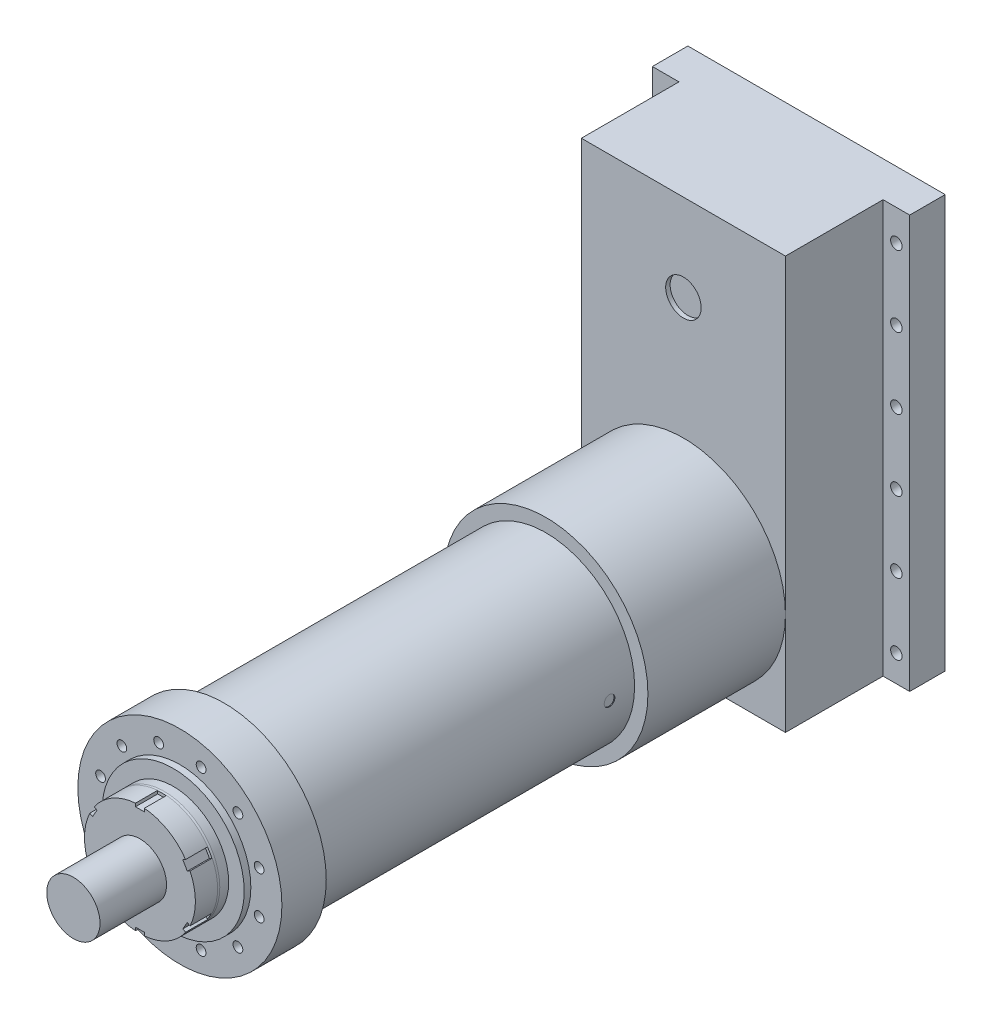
ISO-10303-21;
HEADER;
FILE_DESCRIPTION(('STEP AP214'),'2;1');
FILE_NAME('part.step','',(''),(''),'','','');
FILE_SCHEMA(('AUTOMOTIVE_DESIGN { 1 0 10303 214 1 1 1 1 }'));
ENDSEC;
DATA;
#1=APPLICATION_CONTEXT('core data for automotive mechanical design processes');
#2=APPLICATION_PROTOCOL_DEFINITION('international standard','automotive_design',2000,#1);
#3=PRODUCT_CONTEXT('',#1,'mechanical');
#4=PRODUCT('Part','Part','',(#3));
#5=PRODUCT_RELATED_PRODUCT_CATEGORY('part','',(#4));
#6=PRODUCT_DEFINITION_FORMATION('','',#4);
#7=PRODUCT_DEFINITION_CONTEXT('part definition',#1,'design');
#8=PRODUCT_DEFINITION('design','',#6,#7);
#9=PRODUCT_DEFINITION_SHAPE('','',#8);
#10=(LENGTH_UNIT() NAMED_UNIT(*) SI_UNIT(.MILLI.,.METRE.));
#11=(NAMED_UNIT(*) PLANE_ANGLE_UNIT() SI_UNIT($,.RADIAN.));
#12=(NAMED_UNIT(*) SI_UNIT($,.STERADIAN.) SOLID_ANGLE_UNIT());
#13=UNCERTAINTY_MEASURE_WITH_UNIT(LENGTH_MEASURE(1.E-05),#10,'distance_accuracy_value','');
#14=(GEOMETRIC_REPRESENTATION_CONTEXT(3) GLOBAL_UNCERTAINTY_ASSIGNED_CONTEXT((#13)) GLOBAL_UNIT_ASSIGNED_CONTEXT((#10,
#11,#12)) REPRESENTATION_CONTEXT('',''));
#15=CARTESIAN_POINT('',(0.,0.,0.));
#16=DIRECTION('',(0.,0.,1.));
#17=DIRECTION('',(1.,0.,0.));
#18=AXIS2_PLACEMENT_3D('',#15,#16,#17);
#19=CARTESIAN_POINT('',(0.,0.,865.));
#20=DIRECTION('',(0.,0.,1.));
#21=DIRECTION('',(1.,0.,0.));
#22=AXIS2_PLACEMENT_3D('',#19,#20,#21);
#23=PLANE('',#22);
#24=DIRECTION('',(0.866025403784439,-0.5,0.));
#25=VECTOR('',#24,1.);
#26=CARTESIAN_POINT('',(112.906209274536,-53.6394249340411,865.));
#27=LINE('',#26,#25);
#28=CARTESIAN_POINT('',(106.757984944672,-50.0897459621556,865.));
#29=VERTEX_POINT('',#28);
#30=CARTESIAN_POINT('',(112.140218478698,-53.1971799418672,865.));
#31=VERTEX_POINT('',#30);
#32=EDGE_CURVE('E394',#29,#31,#27,.T.);
#33=ORIENTED_EDGE('',*,*,#32,.F.);
#34=DIRECTION('',(0.5,0.866025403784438,0.));
#35=VECTOR('',#34,1.);
#36=CARTESIAN_POINT('',(106.757984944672,-50.0897459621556,865.));
#37=LINE('',#36,#35);
#38=CARTESIAN_POINT('',(96.7579849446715,-67.4102540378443,865.));
#39=VERTEX_POINT('',#38);
#40=EDGE_CURVE('E556',#39,#29,#37,.T.);
#41=ORIENTED_EDGE('',*,*,#40,.F.);
#42=DIRECTION('',(-0.866025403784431,0.500000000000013,0.));
#43=VECTOR('',#42,1.);
#44=CARTESIAN_POINT('',(96.7579849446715,-67.4102540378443,865.));
#45=LINE('',#44,#43);
#46=CARTESIAN_POINT('',(102.140218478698,-70.5176880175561,865.));
#47=VERTEX_POINT('',#46);
#48=EDGE_CURVE('E53',#47,#39,#45,.T.);
#49=ORIENTED_EDGE('',*,*,#48,.F.);
#50=CARTESIAN_POINT('',(0.,0.,865.));
#51=DIRECTION('',(0.,0.,1.));
#52=DIRECTION('',(1.,0.,0.));
#53=AXIS2_PLACEMENT_3D('',#50,#51,#52);
#54=CIRCLE('',#53,124.118365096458);
#55=EDGE_CURVE('E941',#47,#31,#54,.T.);
#56=ORIENTED_EDGE('',*,*,#55,.T.);
#57=EDGE_LOOP('',(#33,#41,#49,#56));
#58=FACE_BOUND('',#57,.T.);
#59=ADVANCED_FACE('F39',(#58),#23,.T.);
#60=DIRECTION('',(0.,-1.,0.));
#61=VECTOR('',#60,1.);
#62=CARTESIAN_POINT('',(10.,-124.599357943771,865.));
#63=LINE('',#62,#61);
#64=CARTESIAN_POINT('',(10.,-117.5,865.));
#65=VERTEX_POINT('',#64);
#66=CARTESIAN_POINT('',(10.,-123.714867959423,865.));
#67=VERTEX_POINT('',#66);
#68=EDGE_CURVE('E545',#65,#67,#63,.T.);
#69=ORIENTED_EDGE('',*,*,#68,.F.);
#70=DIRECTION('',(1.,0.,0.));
#71=VECTOR('',#70,1.);
#72=CARTESIAN_POINT('',(10.,-117.5,865.));
#73=LINE('',#72,#71);
#74=CARTESIAN_POINT('',(-9.99999999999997,-117.5,865.));
#75=VERTEX_POINT('',#74);
#76=EDGE_CURVE('E539',#75,#65,#73,.T.);
#77=ORIENTED_EDGE('',*,*,#76,.F.);
#78=DIRECTION('',(0.,1.,0.));
#79=VECTOR('',#78,1.);
#80=CARTESIAN_POINT('',(-9.99999999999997,-117.5,865.));
#81=LINE('',#80,#79);
#82=CARTESIAN_POINT('',(-10.0000000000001,-123.714867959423,865.));
#83=VERTEX_POINT('',#82);
#84=EDGE_CURVE('E540',#83,#75,#81,.T.);
#85=ORIENTED_EDGE('',*,*,#84,.F.);
#86=EDGE_CURVE('E2023',#83,#67,#54,.T.);
#87=ORIENTED_EDGE('',*,*,#86,.T.);
#88=EDGE_LOOP('',(#69,#77,#85,#87));
#89=FACE_BOUND('',#88,.T.);
#90=ADVANCED_FACE('F931',(#89),#23,.T.);
#91=DIRECTION('',(-0.866025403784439,-0.5,0.));
#92=VECTOR('',#91,1.);
#93=CARTESIAN_POINT('',(-102.906209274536,-70.95993300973,865.));
#94=LINE('',#93,#92);
#95=CARTESIAN_POINT('',(-96.7579849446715,-67.4102540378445,865.));
#96=VERTEX_POINT('',#95);
#97=CARTESIAN_POINT('',(-102.140218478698,-70.5176880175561,865.));
#98=VERTEX_POINT('',#97);
#99=EDGE_CURVE('E528',#96,#98,#94,.T.);
#100=ORIENTED_EDGE('',*,*,#99,.F.);
#101=DIRECTION('',(0.5,-0.866025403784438,0.));
#102=VECTOR('',#101,1.);
#103=CARTESIAN_POINT('',(-96.7579849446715,-67.4102540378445,865.));
#104=LINE('',#103,#102);
#105=CARTESIAN_POINT('',(-106.757984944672,-50.0897459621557,865.));
#106=VERTEX_POINT('',#105);
#107=EDGE_CURVE('E522',#106,#96,#104,.T.);
#108=ORIENTED_EDGE('',*,*,#107,.F.);
#109=DIRECTION('',(0.866025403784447,0.499999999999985,0.));
#110=VECTOR('',#109,1.);
#111=CARTESIAN_POINT('',(-106.757984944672,-50.0897459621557,865.));
#112=LINE('',#111,#110);
#113=CARTESIAN_POINT('',(-112.140218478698,-53.1971799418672,865.));
#114=VERTEX_POINT('',#113);
#115=EDGE_CURVE('E523',#114,#106,#112,.T.);
#116=ORIENTED_EDGE('',*,*,#115,.F.);
#117=EDGE_CURVE('E2029',#114,#98,#54,.T.);
#118=ORIENTED_EDGE('',*,*,#117,.T.);
#119=EDGE_LOOP('',(#100,#108,#116,#118));
#120=FACE_BOUND('',#119,.T.);
#121=ADVANCED_FACE('F936',(#120),#23,.T.);
#122=DIRECTION('',(-0.86602540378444,0.499999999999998,0.));
#123=VECTOR('',#122,1.);
#124=CARTESIAN_POINT('',(-112.906209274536,53.6394249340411,865.));
#125=LINE('',#124,#123);
#126=CARTESIAN_POINT('',(-106.757984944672,50.0897459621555,865.));
#127=VERTEX_POINT('',#126);
#128=CARTESIAN_POINT('',(-112.140218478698,53.1971799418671,865.));
#129=VERTEX_POINT('',#128);
#130=EDGE_CURVE('E511',#127,#129,#125,.T.);
#131=ORIENTED_EDGE('',*,*,#130,.F.);
#132=DIRECTION('',(-0.500000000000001,-0.866025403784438,0.));
#133=VECTOR('',#132,1.);
#134=CARTESIAN_POINT('',(-106.757984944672,50.0897459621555,865.));
#135=LINE('',#134,#133);
#136=CARTESIAN_POINT('',(-96.7579849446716,67.4102540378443,865.));
#137=VERTEX_POINT('',#136);
#138=EDGE_CURVE('E505',#137,#127,#135,.T.);
#139=ORIENTED_EDGE('',*,*,#138,.F.);
#140=DIRECTION('',(0.866025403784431,-0.500000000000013,0.));
#141=VECTOR('',#140,1.);
#142=CARTESIAN_POINT('',(-96.7579849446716,67.4102540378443,865.));
#143=LINE('',#142,#141);
#144=CARTESIAN_POINT('',(-102.140218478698,70.517688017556,865.));
#145=VERTEX_POINT('',#144);
#146=EDGE_CURVE('E506',#145,#137,#143,.T.);
#147=ORIENTED_EDGE('',*,*,#146,.F.);
#148=EDGE_CURVE('E2035',#145,#129,#54,.T.);
#149=ORIENTED_EDGE('',*,*,#148,.T.);
#150=EDGE_LOOP('',(#131,#139,#147,#149));
#151=FACE_BOUND('',#150,.T.);
#152=ADVANCED_FACE('F997',(#151),#23,.T.);
#153=DIRECTION('',(0.,1.,0.));
#154=VECTOR('',#153,1.);
#155=CARTESIAN_POINT('',(-10.,124.599357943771,865.));
#156=LINE('',#155,#154);
#157=CARTESIAN_POINT('',(-10.,117.5,865.));
#158=VERTEX_POINT('',#157);
#159=CARTESIAN_POINT('',(-10.,123.714867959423,865.));
#160=VERTEX_POINT('',#159);
#161=EDGE_CURVE('E494',#158,#160,#156,.T.);
#162=ORIENTED_EDGE('',*,*,#161,.F.);
#163=DIRECTION('',(-1.,0.,0.));
#164=VECTOR('',#163,1.);
#165=CARTESIAN_POINT('',(-10.,117.5,865.));
#166=LINE('',#165,#164);
#167=CARTESIAN_POINT('',(9.99999999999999,117.5,865.));
#168=VERTEX_POINT('',#167);
#169=EDGE_CURVE('E488',#168,#158,#166,.T.);
#170=ORIENTED_EDGE('',*,*,#169,.F.);
#171=DIRECTION('',(0.,-1.,0.));
#172=VECTOR('',#171,1.);
#173=CARTESIAN_POINT('',(9.99999999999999,117.5,865.));
#174=LINE('',#173,#172);
#175=CARTESIAN_POINT('',(9.99999999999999,123.714867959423,865.));
#176=VERTEX_POINT('',#175);
#177=EDGE_CURVE('E489',#176,#168,#174,.T.);
#178=ORIENTED_EDGE('',*,*,#177,.F.);
#179=EDGE_CURVE('E1016',#176,#160,#54,.T.);
#180=ORIENTED_EDGE('',*,*,#179,.T.);
#181=EDGE_LOOP('',(#162,#170,#178,#180));
#182=FACE_BOUND('',#181,.T.);
#183=ADVANCED_FACE('F846',(#182),#23,.T.);
#184=CARTESIAN_POINT('',(0.,0.,725.));
#185=DIRECTION('',(0.,0.,-1.));
#186=DIRECTION('',(-1.,0.,0.));
#187=AXIS2_PLACEMENT_3D('',#184,#185,#186);
#188=CYLINDRICAL_SURFACE('',#187,200.);
#189=CARTESIAN_POINT('',(200.,0.,44.5));
#190=CARTESIAN_POINT('',(200.000000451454,-0.336818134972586,44.4999972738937));
#191=CARTESIAN_POINT('',(199.999147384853,-0.673592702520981,44.5141864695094));
#192=CARTESIAN_POINT('',(199.995759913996,-1.34485594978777,44.5708419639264));
#193=CARTESIAN_POINT('',(199.993225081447,-1.67934402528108,44.6133154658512));
#194=CARTESIAN_POINT('',(199.986541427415,-2.34388649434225,44.7263038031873));
#195=CARTESIAN_POINT('',(199.982390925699,-2.67393590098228,44.7968478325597));
#196=CARTESIAN_POINT('',(199.97259396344,-3.32690256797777,44.9654685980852));
#197=CARTESIAN_POINT('',(199.966947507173,-3.64981984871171,45.063545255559));
#198=CARTESIAN_POINT('',(199.95432206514,-4.28605714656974,45.2864689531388));
#199=CARTESIAN_POINT('',(199.947343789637,-4.59938217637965,45.411301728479));
#200=CARTESIAN_POINT('',(199.932250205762,-5.21439925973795,45.6868788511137));
#201=CARTESIAN_POINT('',(199.92413488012,-5.51609113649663,45.837623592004));
#202=CARTESIAN_POINT('',(199.906998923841,-6.10563167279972,46.1639107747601));
#203=CARTESIAN_POINT('',(199.897978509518,-6.39348361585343,46.3394472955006));
#204=CARTESIAN_POINT('',(199.879285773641,-6.95338726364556,46.7140984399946));
#205=CARTESIAN_POINT('',(199.869613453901,-7.22543901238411,46.9132129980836));
#206=CARTESIAN_POINT('',(199.84987810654,-7.75214646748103,47.3338690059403));
#207=CARTESIAN_POINT('',(199.839814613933,-8.00678041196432,47.555437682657));
#208=CARTESIAN_POINT('',(199.819593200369,-8.49648428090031,48.0192286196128));
#209=CARTESIAN_POINT('',(199.809435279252,-8.73155417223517,48.2614509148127));
#210=CARTESIAN_POINT('',(199.789312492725,-9.18047473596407,48.7648450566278));
#211=CARTESIAN_POINT('',(199.779347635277,-9.39432453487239,49.0260176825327));
#212=CARTESIAN_POINT('',(199.759894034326,-9.79927768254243,49.5654558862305));
#213=CARTESIAN_POINT('',(199.750405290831,-9.99038103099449,49.8437214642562));
#214=CARTESIAN_POINT('',(199.732166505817,-10.3486167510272,50.4155890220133));
#215=CARTESIAN_POINT('',(199.723417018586,-10.5157312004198,50.7092022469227));
#216=CARTESIAN_POINT('',(199.706913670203,-10.8246278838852,51.3094920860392));
#217=CARTESIAN_POINT('',(199.699159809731,-10.9664101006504,51.6161687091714));
#218=CARTESIAN_POINT('',(199.684868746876,-11.2236267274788,52.2404038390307));
#219=CARTESIAN_POINT('',(199.678331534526,-11.3390613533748,52.5579622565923));
#220=CARTESIAN_POINT('',(199.666660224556,-11.5427558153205,53.2017032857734));
#221=CARTESIAN_POINT('',(199.661526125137,-11.631015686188,53.5278858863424));
#222=CARTESIAN_POINT('',(199.652812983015,-11.7796353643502,54.1861499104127));
#223=CARTESIAN_POINT('',(199.649232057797,-11.8400289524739,54.5182236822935));
#224=CARTESIAN_POINT('',(199.643718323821,-11.9326397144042,55.1862908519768));
#225=CARTESIAN_POINT('',(199.641785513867,-11.9648569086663,55.5222842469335));
#226=CARTESIAN_POINT('',(199.639623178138,-12.0008826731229,56.1957928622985));
#227=CARTESIAN_POINT('',(199.639393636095,-12.0046915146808,56.5333080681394));
#228=CARTESIAN_POINT('',(199.640644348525,-11.9838738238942,57.207457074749));
#229=CARTESIAN_POINT('',(199.642124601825,-11.9592473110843,57.5440908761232));
#230=CARTESIAN_POINT('',(199.646749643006,-11.881786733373,58.2136429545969));
#231=CARTESIAN_POINT('',(199.649892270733,-11.8289892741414,58.5465654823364));
#232=CARTESIAN_POINT('',(199.657751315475,-11.6955888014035,59.2067729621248));
#233=CARTESIAN_POINT('',(199.662467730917,-11.6149858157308,59.5340579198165));
#234=CARTESIAN_POINT('',(199.673340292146,-11.4265512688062,60.1806698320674));
#235=CARTESIAN_POINT('',(199.679496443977,-11.3187195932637,60.4999967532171));
#236=CARTESIAN_POINT('',(199.693073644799,-11.0765982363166,61.1284294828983));
#237=CARTESIAN_POINT('',(199.700494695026,-10.9423085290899,61.4375352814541));
#238=CARTESIAN_POINT('',(199.716396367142,-10.6481322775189,62.0435365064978));
#239=CARTESIAN_POINT('',(199.724877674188,-10.4882291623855,62.340423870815));
#240=CARTESIAN_POINT('',(199.742655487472,-10.1440259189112,62.9196760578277));
#241=CARTESIAN_POINT('',(199.75195199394,-9.95972578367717,63.2020408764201));
#242=CARTESIAN_POINT('',(199.771096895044,-9.5680341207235,63.7502561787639));
#243=CARTESIAN_POINT('',(199.780945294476,-9.36064239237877,64.0161065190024));
#244=CARTESIAN_POINT('',(199.800915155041,-8.92423659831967,64.529413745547));
#245=CARTESIAN_POINT('',(199.811036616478,-8.69522250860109,64.7768706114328));
#246=CARTESIAN_POINT('',(199.831282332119,-8.2168118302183,65.2520193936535));
#247=CARTESIAN_POINT('',(199.841406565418,-7.96738357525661,65.4796794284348));
#248=CARTESIAN_POINT('',(199.861354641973,-7.45022594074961,65.9131810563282));
#249=CARTESIAN_POINT('',(199.871178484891,-7.18249654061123,66.1190226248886));
#250=CARTESIAN_POINT('',(199.890247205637,-6.63063236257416,66.5074255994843));
#251=CARTESIAN_POINT('',(199.899492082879,-6.34649756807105,66.6899869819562));
#252=CARTESIAN_POINT('',(199.917140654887,-5.76383629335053,67.0305297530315));
#253=CARTESIAN_POINT('',(199.92554435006,-5.46530982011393,67.1885111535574));
#254=CARTESIAN_POINT('',(199.94127250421,-4.85596814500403,67.4787734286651));
#255=CARTESIAN_POINT('',(199.94859691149,-4.54515235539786,67.6110530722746));
#256=CARTESIAN_POINT('',(199.961958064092,-3.91345386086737,67.8489554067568));
#257=CARTESIAN_POINT('',(199.967994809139,-3.5925711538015,67.9545780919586));
#258=CARTESIAN_POINT('',(199.978609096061,-2.94302558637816,68.138407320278));
#259=CARTESIAN_POINT('',(199.983186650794,-2.61436279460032,68.2166141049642));
#260=CARTESIAN_POINT('',(199.990752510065,-1.95159736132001,68.3450498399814));
#261=CARTESIAN_POINT('',(199.993740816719,-1.61749472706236,68.3952788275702));
#262=CARTESIAN_POINT('',(199.998039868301,-0.946756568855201,68.467340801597));
#263=CARTESIAN_POINT('',(199.999353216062,-0.610125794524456,68.489217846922));
#264=CARTESIAN_POINT('',(200.000273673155,0.0637847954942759,68.5045628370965));
#265=CARTESIAN_POINT('',(199.999880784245,0.40106461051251,68.4980308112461));
#266=CARTESIAN_POINT('',(199.997399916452,1.07386998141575,68.4566048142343));
#267=CARTESIAN_POINT('',(199.995311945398,1.4093955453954,68.4217109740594));
#268=CARTESIAN_POINT('',(199.98950012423,2.07630576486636,68.3238125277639));
#269=CARTESIAN_POINT('',(199.985776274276,2.4076904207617,68.2608079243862));
#270=CARTESIAN_POINT('',(199.976801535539,3.06372180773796,68.1071968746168));
#271=CARTESIAN_POINT('',(199.971551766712,3.38837329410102,68.0166106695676));
#272=CARTESIAN_POINT('',(199.959672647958,4.02888618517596,67.8084689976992));
#273=CARTESIAN_POINT('',(199.953043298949,4.34474759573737,67.6909135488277));
#274=CARTESIAN_POINT('',(199.938592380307,4.96544648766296,67.4296715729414));
#275=CARTESIAN_POINT('',(199.930770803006,5.27028389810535,67.2859848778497));
#276=CARTESIAN_POINT('',(199.914156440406,5.86677844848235,66.973503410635));
#277=CARTESIAN_POINT('',(199.905363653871,6.15843557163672,66.8047086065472));
#278=CARTESIAN_POINT('',(199.887043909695,6.72686049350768,66.4429862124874));
#279=CARTESIAN_POINT('',(199.877516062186,7.00360953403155,66.2500291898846));
#280=CARTESIAN_POINT('',(199.85800533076,7.53987480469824,65.8415150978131));
#281=CARTESIAN_POINT('',(199.84802244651,7.79939102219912,65.6259580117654));
#282=CARTESIAN_POINT('',(199.827884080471,8.29935868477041,65.1737683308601));
#283=CARTESIAN_POINT('',(199.817728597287,8.53980997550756,64.9371355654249));
#284=CARTESIAN_POINT('',(199.797532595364,8.99994549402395,64.4444693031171));
#285=CARTESIAN_POINT('',(199.787492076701,9.21962970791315,64.1884357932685));
#286=CARTESIAN_POINT('',(199.767797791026,9.63694312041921,63.6584379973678));
#287=CARTESIAN_POINT('',(199.758144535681,9.83454371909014,63.3844511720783));
#288=CARTESIAN_POINT('',(199.739512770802,10.205960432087,62.8207823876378));
#289=CARTESIAN_POINT('',(199.730534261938,10.3797765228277,62.5311004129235));
#290=CARTESIAN_POINT('',(199.713507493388,10.7023843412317,61.9380971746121));
#291=CARTESIAN_POINT('',(199.70545922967,10.8511761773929,61.6347759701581));
#292=CARTESIAN_POINT('',(199.690522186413,11.1226725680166,61.0166473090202));
#293=CARTESIAN_POINT('',(199.683633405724,11.245377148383,60.7018398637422));
#294=CARTESIAN_POINT('',(199.671215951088,11.463746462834,60.0631910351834));
#295=CARTESIAN_POINT('',(199.665686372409,11.5594291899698,59.7393558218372));
#296=CARTESIAN_POINT('',(199.656139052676,11.7231767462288,59.0847544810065));
#297=CARTESIAN_POINT('',(199.652121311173,11.7912415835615,58.7539883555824));
#298=CARTESIAN_POINT('',(199.645712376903,11.8992631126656,58.0878845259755));
#299=CARTESIAN_POINT('',(199.643321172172,11.9392200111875,57.7525468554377));
#300=CARTESIAN_POINT('',(199.640233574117,11.99073839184,57.079689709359));
#301=CARTESIAN_POINT('',(199.639537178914,12.0022999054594,56.7421702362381));
#302=CARTESIAN_POINT('',(199.639858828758,11.9969484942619,56.0678915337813));
#303=CARTESIAN_POINT('',(199.640874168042,11.9800805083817,55.731131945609));
#304=CARTESIAN_POINT('',(199.644585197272,11.9180771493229,55.0602348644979));
#305=CARTESIAN_POINT('',(199.647280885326,11.8729418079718,54.7260973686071));
#306=CARTESIAN_POINT('',(199.654275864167,11.754727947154,54.0628194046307));
#307=CARTESIAN_POINT('',(199.658575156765,11.6816493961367,53.7336789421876));
#308=CARTESIAN_POINT('',(199.668655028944,11.5080731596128,53.0827324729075));
#309=CARTESIAN_POINT('',(199.674435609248,11.4075754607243,52.7609264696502));
#310=CARTESIAN_POINT('',(199.687313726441,11.1798805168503,52.1269324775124));
#311=CARTESIAN_POINT('',(199.694411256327,11.0526834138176,51.814744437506));
#312=CARTESIAN_POINT('',(199.709721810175,10.7724967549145,51.2021943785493));
#313=CARTESIAN_POINT('',(199.71793483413,10.6195071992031,50.901832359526));
#314=CARTESIAN_POINT('',(199.735243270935,10.2888285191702,50.3150654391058));
#315=CARTESIAN_POINT('',(199.744338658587,10.1111401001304,50.028660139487));
#316=CARTESIAN_POINT('',(199.763154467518,9.73232068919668,49.4718189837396));
#317=CARTESIAN_POINT('',(199.772874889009,9.53118968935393,49.201383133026));
#318=CARTESIAN_POINT('',(199.792680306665,9.10659722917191,48.678005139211));
#319=CARTESIAN_POINT('',(199.802765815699,8.88310351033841,48.4250891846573));
#320=CARTESIAN_POINT('',(199.823002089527,8.41561396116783,47.9389745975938));
#321=CARTESIAN_POINT('',(199.833152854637,8.17161803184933,47.7057760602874));
#322=CARTESIAN_POINT('',(199.853234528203,7.66478752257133,47.2606924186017));
#323=CARTESIAN_POINT('',(199.863165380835,7.40194822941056,47.0488126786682));
#324=CARTESIAN_POINT('',(199.882523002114,6.8593497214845,46.6479393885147));
#325=CARTESIAN_POINT('',(199.891949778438,6.57959076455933,46.4589454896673));
#326=CARTESIAN_POINT('',(199.910042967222,6.00478830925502,46.1049735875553));
#327=CARTESIAN_POINT('',(199.918708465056,5.7097270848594,45.9400243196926));
#328=CARTESIAN_POINT('',(199.935020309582,5.10672265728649,45.6355873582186));
#329=CARTESIAN_POINT('',(199.942666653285,4.79877941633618,45.4960997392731));
#330=CARTESIAN_POINT('',(199.95671533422,4.17252410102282,45.243718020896));
#331=CARTESIAN_POINT('',(199.96311897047,3.85422326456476,45.1307961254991));
#332=CARTESIAN_POINT('',(199.974509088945,3.20932132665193,44.9321958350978));
#333=CARTESIAN_POINT('',(199.979495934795,2.88272237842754,44.8465104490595));
#334=CARTESIAN_POINT('',(199.989051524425,2.13414018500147,44.6835216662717));
#335=CARTESIAN_POINT('',(199.99314188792,1.71026312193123,44.6147621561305));
#336=CARTESIAN_POINT('',(199.998615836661,0.857567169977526,44.5230030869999));
#337=CARTESIAN_POINT('',(199.999999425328,0.428748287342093,44.5000034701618));
#338=CARTESIAN_POINT('',(200.,0.,44.5));
#339=B_SPLINE_CURVE_WITH_KNOTS('',3,(#189,#190,#191,#192,#193,#194,#195,#196,#197,#198,#199,
#200,#201,#202,#203,#204,#205,#206,#207,#208,#209,#210,#211,#212,#213,#214,#215,#216,#217,#218,
#219,#220,#221,#222,#223,#224,#225,#226,#227,#228,#229,#230,#231,#232,#233,#234,#235,#236,#237,
#238,#239,#240,#241,#242,#243,#244,#245,#246,#247,#248,#249,#250,#251,#252,#253,#254,#255,#256,
#257,#258,#259,#260,#261,#262,#263,#264,#265,#266,#267,#268,#269,#270,#271,#272,#273,#274,#275,
#276,#277,#278,#279,#280,#281,#282,#283,#284,#285,#286,#287,#288,#289,#290,#291,#292,#293,#294,
#295,#296,#297,#298,#299,#300,#301,#302,#303,#304,#305,#306,#307,#308,#309,#310,#311,#312,#313,
#314,#315,#316,#317,#318,#319,#320,#321,#322,#323,#324,#325,#326,#327,#328,#329,#330,#331,#332,
#333,#334,#335,#336,#337,#338),.UNSPECIFIED.,.T.,.F.,(4,2,2,2,2,2,2,2,2,2,2,2,2,2,2,2,2,2,2,2,2,
2,2,2,2,2,2,2,2,2,2,2,2,2,2,2,2,2,2,2,2,2,2,2,2,2,2,2,2,2,2,2,2,2,2,2,2,2,2,2,2,2,2,2,2,2,2,2,2,
2,2,2,2,2,4),(0.,1.01007974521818,2.02041682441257,3.03180743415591,4.04319515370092,
5.0540449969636,6.06491019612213,7.07553437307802,8.08615573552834,9.09801754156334,
10.1098810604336,11.1217862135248,12.1336913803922,13.1463486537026,14.1590066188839,
15.171656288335,16.1843046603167,17.1957222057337,18.207139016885,19.2185461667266,
20.2299526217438,21.2400480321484,22.250142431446,23.2602410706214,24.2703406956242,
25.2810964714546,26.2918525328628,27.3026173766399,28.3133833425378,29.3257480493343,
30.3381138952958,31.350480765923,32.3628471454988,33.3752619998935,34.3876770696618,
35.4000832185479,36.4124880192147,37.4233176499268,38.4341462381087,39.444970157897,
40.4557939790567,41.4658777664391,42.4759608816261,43.4860504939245,44.4961413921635,
45.5074749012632,46.5188091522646,47.5301515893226,48.5414947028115,49.5541327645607,
50.566771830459,51.5794065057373,52.5920401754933,53.6039979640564,54.6159554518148,
55.6279054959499,56.6398544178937,57.650205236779,58.6605549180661,59.6709057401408,
60.6812570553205,61.6916029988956,62.7019489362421,63.7122660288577,64.7225834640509,
65.7343799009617,66.7461812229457,67.75823651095,68.7702763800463,69.7835159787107,
70.7967585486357,71.8089361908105,72.8208538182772,74.1066233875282,75.3923913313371),.UNSPECIFIED.);
#340=CARTESIAN_POINT('',(200.,0.,44.5));
#341=VERTEX_POINT('',#340);
#342=EDGE_CURVE('E43',#341,#341,#339,.T.);
#343=ORIENTED_EDGE('',*,*,#342,.T.);
#344=EDGE_LOOP('',(#343));
#345=FACE_BOUND('',#344,.T.);
#346=CARTESIAN_POINT('',(0.,0.,725.));
#347=DIRECTION('',(0.,0.,1.));
#348=DIRECTION('',(1.,0.,0.));
#349=AXIS2_PLACEMENT_3D('',#346,#347,#348);
#350=CIRCLE('',#349,200.);
#351=CARTESIAN_POINT('',(200.,0.,725.));
#352=VERTEX_POINT('',#351);
#353=EDGE_CURVE('E693',#352,#352,#350,.T.);
#354=ORIENTED_EDGE('',*,*,#353,.F.);
#355=EDGE_LOOP('',(#354));
#356=FACE_BOUND('',#355,.T.);
#357=CARTESIAN_POINT('',(0.,0.,0.));
#358=DIRECTION('',(0.,0.,1.));
#359=DIRECTION('',(1.,0.,0.));
#360=AXIS2_PLACEMENT_3D('',#357,#358,#359);
#361=CIRCLE('',#360,200.);
#362=CARTESIAN_POINT('',(200.,0.,0.));
#363=VERTEX_POINT('',#362);
#364=EDGE_CURVE('E675',#363,#363,#361,.T.);
#365=ORIENTED_EDGE('',*,*,#364,.T.);
#366=EDGE_LOOP('',(#365));
#367=FACE_BOUND('',#366,.T.);
#368=CARTESIAN_POINT('',(-200.,0.,682.5));
#369=CARTESIAN_POINT('',(-200.000000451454,0.336818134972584,682.500002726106));
#370=CARTESIAN_POINT('',(-199.999147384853,0.673592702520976,682.485813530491));
#371=CARTESIAN_POINT('',(-199.995759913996,1.34485594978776,682.429158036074));
#372=CARTESIAN_POINT('',(-199.993225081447,1.67934402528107,682.386684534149));
#373=CARTESIAN_POINT('',(-199.986541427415,2.34388649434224,682.273696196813));
#374=CARTESIAN_POINT('',(-199.982390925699,2.67393590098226,682.20315216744));
#375=CARTESIAN_POINT('',(-199.97259396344,3.32690256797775,682.034531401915));
#376=CARTESIAN_POINT('',(-199.966947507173,3.64981984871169,681.936454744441));
#377=CARTESIAN_POINT('',(-199.95432206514,4.28605714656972,681.713531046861));
#378=CARTESIAN_POINT('',(-199.947343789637,4.59938217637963,681.588698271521));
#379=CARTESIAN_POINT('',(-199.932250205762,5.21439925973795,681.313121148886));
#380=CARTESIAN_POINT('',(-199.92413488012,5.51609113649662,681.162376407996));
#381=CARTESIAN_POINT('',(-199.906998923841,6.10563167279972,680.83608922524));
#382=CARTESIAN_POINT('',(-199.897978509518,6.39348361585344,680.660552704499));
#383=CARTESIAN_POINT('',(-199.879285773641,6.95338726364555,680.285901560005));
#384=CARTESIAN_POINT('',(-199.869613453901,7.22543901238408,680.086787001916));
#385=CARTESIAN_POINT('',(-199.84987810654,7.752146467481,679.66613099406));
#386=CARTESIAN_POINT('',(-199.839814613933,8.00678041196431,679.444562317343));
#387=CARTESIAN_POINT('',(-199.819593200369,8.49648428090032,678.980771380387));
#388=CARTESIAN_POINT('',(-199.809435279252,8.73155417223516,678.738549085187));
#389=CARTESIAN_POINT('',(-199.789312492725,9.18047473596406,678.235154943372));
#390=CARTESIAN_POINT('',(-199.779347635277,9.39432453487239,677.973982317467));
#391=CARTESIAN_POINT('',(-199.759894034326,9.79927768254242,677.434544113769));
#392=CARTESIAN_POINT('',(-199.750405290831,9.99038103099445,677.156278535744));
#393=CARTESIAN_POINT('',(-199.732166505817,10.3486167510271,676.584410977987));
#394=CARTESIAN_POINT('',(-199.723417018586,10.5157312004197,676.290797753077));
#395=CARTESIAN_POINT('',(-199.706913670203,10.8246278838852,675.690507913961));
#396=CARTESIAN_POINT('',(-199.699159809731,10.9664101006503,675.383831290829));
#397=CARTESIAN_POINT('',(-199.684868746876,11.2236267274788,674.759596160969));
#398=CARTESIAN_POINT('',(-199.678331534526,11.3390613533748,674.442037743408));
#399=CARTESIAN_POINT('',(-199.666660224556,11.5427558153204,673.798296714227));
#400=CARTESIAN_POINT('',(-199.661526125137,11.631015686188,673.472114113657));
#401=CARTESIAN_POINT('',(-199.652812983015,11.7796353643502,672.813850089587));
#402=CARTESIAN_POINT('',(-199.649232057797,11.8400289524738,672.481776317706));
#403=CARTESIAN_POINT('',(-199.643718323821,11.9326397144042,671.813709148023));
#404=CARTESIAN_POINT('',(-199.641785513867,11.9648569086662,671.477715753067));
#405=CARTESIAN_POINT('',(-199.639623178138,12.0008826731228,670.804207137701));
#406=CARTESIAN_POINT('',(-199.639393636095,12.0046915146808,670.466691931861));
#407=CARTESIAN_POINT('',(-199.640644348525,11.9838738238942,669.792542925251));
#408=CARTESIAN_POINT('',(-199.642124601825,11.9592473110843,669.455909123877));
#409=CARTESIAN_POINT('',(-199.646749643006,11.881786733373,668.786357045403));
#410=CARTESIAN_POINT('',(-199.649892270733,11.8289892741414,668.453434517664));
#411=CARTESIAN_POINT('',(-199.657751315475,11.6955888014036,667.793227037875));
#412=CARTESIAN_POINT('',(-199.662467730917,11.6149858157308,667.465942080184));
#413=CARTESIAN_POINT('',(-199.673340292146,11.4265512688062,666.819330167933));
#414=CARTESIAN_POINT('',(-199.679496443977,11.3187195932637,666.500003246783));
#415=CARTESIAN_POINT('',(-199.693073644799,11.0765982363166,665.871570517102));
#416=CARTESIAN_POINT('',(-199.700494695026,10.9423085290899,665.562464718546));
#417=CARTESIAN_POINT('',(-199.716396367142,10.6481322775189,664.956463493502));
#418=CARTESIAN_POINT('',(-199.724877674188,10.4882291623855,664.659576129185));
#419=CARTESIAN_POINT('',(-199.742655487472,10.1440259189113,664.080323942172));
#420=CARTESIAN_POINT('',(-199.75195199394,9.95972578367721,663.79795912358));
#421=CARTESIAN_POINT('',(-199.771096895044,9.56803412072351,663.249743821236));
#422=CARTESIAN_POINT('',(-199.780945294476,9.36064239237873,662.983893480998));
#423=CARTESIAN_POINT('',(-199.800915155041,8.9242365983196,662.470586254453));
#424=CARTESIAN_POINT('',(-199.811036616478,8.69522250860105,662.223129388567));
#425=CARTESIAN_POINT('',(-199.831282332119,8.21681183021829,661.747980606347));
#426=CARTESIAN_POINT('',(-199.841406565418,7.96738357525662,661.520320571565));
#427=CARTESIAN_POINT('',(-199.861354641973,7.45022594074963,661.086818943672));
#428=CARTESIAN_POINT('',(-199.871178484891,7.18249654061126,660.880977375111));
#429=CARTESIAN_POINT('',(-199.890247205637,6.6306323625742,660.492574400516));
#430=CARTESIAN_POINT('',(-199.899492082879,6.34649756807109,660.310013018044));
#431=CARTESIAN_POINT('',(-199.917140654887,5.76383629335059,659.969470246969));
#432=CARTESIAN_POINT('',(-199.92554435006,5.46530982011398,659.811488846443));
#433=CARTESIAN_POINT('',(-199.94127250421,4.85596814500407,659.521226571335));
#434=CARTESIAN_POINT('',(-199.94859691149,4.54515235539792,659.388946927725));
#435=CARTESIAN_POINT('',(-199.961958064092,3.91345386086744,659.151044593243));
#436=CARTESIAN_POINT('',(-199.967994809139,3.59257115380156,659.045421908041));
#437=CARTESIAN_POINT('',(-199.978609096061,2.9430255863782,658.861592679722));
#438=CARTESIAN_POINT('',(-199.983186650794,2.61436279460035,658.783385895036));
#439=CARTESIAN_POINT('',(-199.990752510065,1.95159736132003,658.654950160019));
#440=CARTESIAN_POINT('',(-199.993740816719,1.61749472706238,658.60472117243));
#441=CARTESIAN_POINT('',(-199.998039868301,0.946756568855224,658.532659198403));
#442=CARTESIAN_POINT('',(-199.999353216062,0.610125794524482,658.510782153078));
#443=CARTESIAN_POINT('',(-200.000273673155,-0.0637847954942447,658.495437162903));
#444=CARTESIAN_POINT('',(-199.999880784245,-0.401064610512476,658.501969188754));
#445=CARTESIAN_POINT('',(-199.997399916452,-1.07386998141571,658.543395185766));
#446=CARTESIAN_POINT('',(-199.995311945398,-1.40939554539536,658.578289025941));
#447=CARTESIAN_POINT('',(-199.98950012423,-2.07630576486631,658.676187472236));
#448=CARTESIAN_POINT('',(-199.985776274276,-2.40769042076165,658.739192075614));
#449=CARTESIAN_POINT('',(-199.976801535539,-3.06372180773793,658.892803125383));
#450=CARTESIAN_POINT('',(-199.971551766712,-3.38837329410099,658.983389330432));
#451=CARTESIAN_POINT('',(-199.959672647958,-4.02888618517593,659.191531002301));
#452=CARTESIAN_POINT('',(-199.953043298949,-4.34474759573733,659.309086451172));
#453=CARTESIAN_POINT('',(-199.938592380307,-4.96544648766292,659.570328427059));
#454=CARTESIAN_POINT('',(-199.930770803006,-5.27028389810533,659.71401512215));
#455=CARTESIAN_POINT('',(-199.914156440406,-5.86677844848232,660.026496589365));
#456=CARTESIAN_POINT('',(-199.905363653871,-6.15843557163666,660.195291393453));
#457=CARTESIAN_POINT('',(-199.887043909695,-6.7268604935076,660.557013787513));
#458=CARTESIAN_POINT('',(-199.877516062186,-7.00360953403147,660.749970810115));
#459=CARTESIAN_POINT('',(-199.85800533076,-7.53987480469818,661.158484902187));
#460=CARTESIAN_POINT('',(-199.84802244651,-7.79939102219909,661.374041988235));
#461=CARTESIAN_POINT('',(-199.827884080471,-8.29935868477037,661.82623166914));
#462=CARTESIAN_POINT('',(-199.817728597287,-8.53980997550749,662.062864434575));
#463=CARTESIAN_POINT('',(-199.797532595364,-8.9999454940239,662.555530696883));
#464=CARTESIAN_POINT('',(-199.787492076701,-9.21962970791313,662.811564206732));
#465=CARTESIAN_POINT('',(-199.767797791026,-9.63694312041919,663.341562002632));
#466=CARTESIAN_POINT('',(-199.758144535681,-9.8345437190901,663.615548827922));
#467=CARTESIAN_POINT('',(-199.739512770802,-10.205960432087,664.179217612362));
#468=CARTESIAN_POINT('',(-199.730534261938,-10.3797765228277,664.468899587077));
#469=CARTESIAN_POINT('',(-199.713507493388,-10.7023843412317,665.061902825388));
#470=CARTESIAN_POINT('',(-199.70545922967,-10.8511761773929,665.365224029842));
#471=CARTESIAN_POINT('',(-199.690522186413,-11.1226725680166,665.98335269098));
#472=CARTESIAN_POINT('',(-199.683633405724,-11.245377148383,666.298160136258));
#473=CARTESIAN_POINT('',(-199.671215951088,-11.4637464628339,666.936808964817));
#474=CARTESIAN_POINT('',(-199.665686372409,-11.5594291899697,667.260644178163));
#475=CARTESIAN_POINT('',(-199.656139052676,-11.7231767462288,667.915245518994));
#476=CARTESIAN_POINT('',(-199.652121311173,-11.7912415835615,668.246011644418));
#477=CARTESIAN_POINT('',(-199.645712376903,-11.8992631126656,668.912115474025));
#478=CARTESIAN_POINT('',(-199.643321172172,-11.9392200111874,669.247453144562));
#479=CARTESIAN_POINT('',(-199.640233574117,-11.99073839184,669.920310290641));
#480=CARTESIAN_POINT('',(-199.639537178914,-12.0022999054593,670.257829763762));
#481=CARTESIAN_POINT('',(-199.639858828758,-11.9969484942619,670.932108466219));
#482=CARTESIAN_POINT('',(-199.640874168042,-11.9800805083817,671.268868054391));
#483=CARTESIAN_POINT('',(-199.644585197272,-11.9180771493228,671.939765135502));
#484=CARTESIAN_POINT('',(-199.647280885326,-11.8729418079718,672.273902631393));
#485=CARTESIAN_POINT('',(-199.654275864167,-11.754727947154,672.937180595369));
#486=CARTESIAN_POINT('',(-199.658575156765,-11.6816493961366,673.266321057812));
#487=CARTESIAN_POINT('',(-199.668655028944,-11.5080731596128,673.917267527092));
#488=CARTESIAN_POINT('',(-199.674435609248,-11.4075754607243,674.23907353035));
#489=CARTESIAN_POINT('',(-199.687313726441,-11.1798805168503,674.873067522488));
#490=CARTESIAN_POINT('',(-199.694411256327,-11.0526834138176,675.185255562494));
#491=CARTESIAN_POINT('',(-199.709721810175,-10.7724967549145,675.797805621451));
#492=CARTESIAN_POINT('',(-199.71793483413,-10.6195071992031,676.098167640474));
#493=CARTESIAN_POINT('',(-199.735243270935,-10.2888285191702,676.684934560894));
#494=CARTESIAN_POINT('',(-199.744338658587,-10.1111401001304,676.971339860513));
#495=CARTESIAN_POINT('',(-199.763154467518,-9.73232068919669,677.52818101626));
#496=CARTESIAN_POINT('',(-199.772874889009,-9.53118968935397,677.798616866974));
#497=CARTESIAN_POINT('',(-199.792680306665,-9.10659722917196,678.321994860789));
#498=CARTESIAN_POINT('',(-199.802765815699,-8.88310351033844,678.574910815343));
#499=CARTESIAN_POINT('',(-199.823002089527,-8.41561396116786,679.061025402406));
#500=CARTESIAN_POINT('',(-199.833152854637,-8.17161803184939,679.294223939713));
#501=CARTESIAN_POINT('',(-199.853234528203,-7.66478752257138,679.739307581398));
#502=CARTESIAN_POINT('',(-199.863165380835,-7.40194822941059,679.951187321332));
#503=CARTESIAN_POINT('',(-199.882523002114,-6.8593497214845,680.352060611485));
#504=CARTESIAN_POINT('',(-199.891949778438,-6.57959076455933,680.541054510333));
#505=CARTESIAN_POINT('',(-199.910042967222,-6.00478830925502,680.895026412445));
#506=CARTESIAN_POINT('',(-199.918708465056,-5.7097270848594,681.059975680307));
#507=CARTESIAN_POINT('',(-199.935020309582,-5.10672265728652,681.364412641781));
#508=CARTESIAN_POINT('',(-199.942666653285,-4.79877941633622,681.503900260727));
#509=CARTESIAN_POINT('',(-199.95671533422,-4.17252410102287,681.756281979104));
#510=CARTESIAN_POINT('',(-199.96311897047,-3.85422326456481,681.869203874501));
#511=CARTESIAN_POINT('',(-199.974509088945,-3.20932132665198,682.067804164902));
#512=CARTESIAN_POINT('',(-199.979495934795,-2.8827223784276,682.15348955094));
#513=CARTESIAN_POINT('',(-199.989051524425,-2.13414018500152,682.316478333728));
#514=CARTESIAN_POINT('',(-199.99314188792,-1.71026312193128,682.38523784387));
#515=CARTESIAN_POINT('',(-199.998615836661,-0.857567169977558,682.476996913));
#516=CARTESIAN_POINT('',(-199.999999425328,-0.428748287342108,682.499996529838));
#517=CARTESIAN_POINT('',(-200.,0.,682.5));
#518=B_SPLINE_CURVE_WITH_KNOTS('',3,(#368,#369,#370,#371,#372,#373,#374,#375,#376,#377,#378,
#379,#380,#381,#382,#383,#384,#385,#386,#387,#388,#389,#390,#391,#392,#393,#394,#395,#396,#397,
#398,#399,#400,#401,#402,#403,#404,#405,#406,#407,#408,#409,#410,#411,#412,#413,#414,#415,#416,
#417,#418,#419,#420,#421,#422,#423,#424,#425,#426,#427,#428,#429,#430,#431,#432,#433,#434,#435,
#436,#437,#438,#439,#440,#441,#442,#443,#444,#445,#446,#447,#448,#449,#450,#451,#452,#453,#454,
#455,#456,#457,#458,#459,#460,#461,#462,#463,#464,#465,#466,#467,#468,#469,#470,#471,#472,#473,
#474,#475,#476,#477,#478,#479,#480,#481,#482,#483,#484,#485,#486,#487,#488,#489,#490,#491,#492,
#493,#494,#495,#496,#497,#498,#499,#500,#501,#502,#503,#504,#505,#506,#507,#508,#509,#510,#511,
#512,#513,#514,#515,#516,#517),.UNSPECIFIED.,.T.,.F.,(4,2,2,2,2,2,2,2,2,2,2,2,2,2,2,2,2,2,2,2,2,
2,2,2,2,2,2,2,2,2,2,2,2,2,2,2,2,2,2,2,2,2,2,2,2,2,2,2,2,2,2,2,2,2,2,2,2,2,2,2,2,2,2,2,2,2,2,2,2,
2,2,2,2,2,4),(0.,1.01007974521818,2.02041682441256,3.03180743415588,4.0431951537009,
5.05404499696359,6.06491019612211,7.07553437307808,8.08615573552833,9.09801754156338,
10.1098810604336,11.1217862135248,12.1336913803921,13.1463486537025,14.1590066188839,
15.1716562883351,16.1843046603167,17.1957222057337,18.207139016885,19.2185461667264,
20.2299526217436,21.2400480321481,22.2501424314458,23.2602410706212,24.270340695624,
25.2810964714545,26.2918525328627,27.3026173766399,28.3133833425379,29.3257480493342,
30.3381138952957,31.3504807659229,32.3628471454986,33.3752619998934,34.3876770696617,
35.4000832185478,36.4124880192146,37.4233176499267,38.4341462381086,39.4449701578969,
40.4557939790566,41.465877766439,42.475960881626,43.4860504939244,44.4961413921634,
45.507474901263,46.5188091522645,47.5301515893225,48.5414947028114,49.5541327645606,
50.5667718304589,51.5794065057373,52.5920401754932,53.6039979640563,54.6159554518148,
55.6279054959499,56.6398544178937,57.650205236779,58.660554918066,59.6709057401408,
60.6812570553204,61.6916029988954,62.701948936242,63.7122660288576,64.7225834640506,
65.7343799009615,66.7461812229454,67.7582365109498,68.7702763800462,69.7835159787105,
70.7967585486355,71.8089361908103,72.8208538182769,74.106623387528,75.392391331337),.UNSPECIFIED.);
#519=CARTESIAN_POINT('',(-200.,0.,682.5));
#520=VERTEX_POINT('',#519);
#521=EDGE_CURVE('E812',#520,#520,#518,.T.);
#522=ORIENTED_EDGE('',*,*,#521,.F.);
#523=EDGE_LOOP('',(#522));
#524=FACE_BOUND('',#523,.T.);
#525=CARTESIAN_POINT('',(-200.,0.,48.5));
#526=CARTESIAN_POINT('',(-200.000000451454,0.336818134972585,48.5000027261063));
#527=CARTESIAN_POINT('',(-199.999147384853,0.673592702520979,48.4858135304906));
#528=CARTESIAN_POINT('',(-199.995759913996,1.34485594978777,48.4291580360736));
#529=CARTESIAN_POINT('',(-199.993225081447,1.67934402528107,48.3866845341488));
#530=CARTESIAN_POINT('',(-199.986541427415,2.34388649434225,48.2736961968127));
#531=CARTESIAN_POINT('',(-199.982390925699,2.67393590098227,48.2031521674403));
#532=CARTESIAN_POINT('',(-199.97259396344,3.32690256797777,48.0345314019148));
#533=CARTESIAN_POINT('',(-199.966947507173,3.64981984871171,47.936454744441));
#534=CARTESIAN_POINT('',(-199.95432206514,4.28605714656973,47.7135310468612));
#535=CARTESIAN_POINT('',(-199.947343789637,4.59938217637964,47.588698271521));
#536=CARTESIAN_POINT('',(-199.932250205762,5.21439925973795,47.3131211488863));
#537=CARTESIAN_POINT('',(-199.92413488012,5.51609113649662,47.162376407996));
#538=CARTESIAN_POINT('',(-199.906998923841,6.10563167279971,46.8360892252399));
#539=CARTESIAN_POINT('',(-199.897978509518,6.39348361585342,46.6605527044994));
#540=CARTESIAN_POINT('',(-199.879285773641,6.95338726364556,46.2859015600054));
#541=CARTESIAN_POINT('',(-199.869613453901,7.22543901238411,46.0867870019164));
#542=CARTESIAN_POINT('',(-199.84987810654,7.75214646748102,45.6661309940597));
#543=CARTESIAN_POINT('',(-199.839814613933,8.00678041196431,45.4445623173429));
#544=CARTESIAN_POINT('',(-199.819593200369,8.4964842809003,44.9807713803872));
#545=CARTESIAN_POINT('',(-199.809435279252,8.73155417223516,44.7385490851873));
#546=CARTESIAN_POINT('',(-199.789312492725,9.18047473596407,44.2351549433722));
#547=CARTESIAN_POINT('',(-199.779347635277,9.39432453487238,43.9739823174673));
#548=CARTESIAN_POINT('',(-199.759894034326,9.79927768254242,43.4345441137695));
#549=CARTESIAN_POINT('',(-199.750405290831,9.99038103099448,43.1562785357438));
#550=CARTESIAN_POINT('',(-199.732166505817,10.3486167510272,42.5844109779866));
#551=CARTESIAN_POINT('',(-199.723417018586,10.5157312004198,42.2907977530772));
#552=CARTESIAN_POINT('',(-199.706913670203,10.8246278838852,41.6905079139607));
#553=CARTESIAN_POINT('',(-199.699159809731,10.9664101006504,41.3838312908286));
#554=CARTESIAN_POINT('',(-199.684868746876,11.2236267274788,40.7595961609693));
#555=CARTESIAN_POINT('',(-199.678331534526,11.3390613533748,40.4420377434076));
#556=CARTESIAN_POINT('',(-199.666660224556,11.5427558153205,39.7982967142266));
#557=CARTESIAN_POINT('',(-199.661526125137,11.631015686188,39.4721141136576));
#558=CARTESIAN_POINT('',(-199.652812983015,11.7796353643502,38.8138500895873));
#559=CARTESIAN_POINT('',(-199.649232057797,11.8400289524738,38.4817763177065));
#560=CARTESIAN_POINT('',(-199.643718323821,11.9326397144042,37.8137091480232));
#561=CARTESIAN_POINT('',(-199.641785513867,11.9648569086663,37.4777157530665));
#562=CARTESIAN_POINT('',(-199.639623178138,12.0008826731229,36.8042071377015));
#563=CARTESIAN_POINT('',(-199.639393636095,12.0046915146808,36.4666919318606));
#564=CARTESIAN_POINT('',(-199.640644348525,11.9838738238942,35.792542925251));
#565=CARTESIAN_POINT('',(-199.642124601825,11.9592473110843,35.4559091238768));
#566=CARTESIAN_POINT('',(-199.646749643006,11.881786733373,34.7863570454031));
#567=CARTESIAN_POINT('',(-199.649892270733,11.8289892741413,34.4534345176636));
#568=CARTESIAN_POINT('',(-199.657751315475,11.6955888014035,33.7932270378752));
#569=CARTESIAN_POINT('',(-199.662467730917,11.6149858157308,33.4659420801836));
#570=CARTESIAN_POINT('',(-199.673340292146,11.4265512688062,32.8193301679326));
#571=CARTESIAN_POINT('',(-199.679496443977,11.3187195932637,32.5000032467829));
#572=CARTESIAN_POINT('',(-199.693073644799,11.0765982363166,31.8715705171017));
#573=CARTESIAN_POINT('',(-199.700494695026,10.9423085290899,31.5624647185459));
#574=CARTESIAN_POINT('',(-199.716396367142,10.6481322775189,30.9564634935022));
#575=CARTESIAN_POINT('',(-199.724877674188,10.4882291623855,30.659576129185));
#576=CARTESIAN_POINT('',(-199.742655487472,10.1440259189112,30.0803239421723));
#577=CARTESIAN_POINT('',(-199.75195199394,9.95972578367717,29.7979591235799));
#578=CARTESIAN_POINT('',(-199.771096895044,9.5680341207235,29.2497438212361));
#579=CARTESIAN_POINT('',(-199.780945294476,9.36064239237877,28.9838934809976));
#580=CARTESIAN_POINT('',(-199.800915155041,8.92423659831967,28.470586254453));
#581=CARTESIAN_POINT('',(-199.811036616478,8.69522250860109,28.2231293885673));
#582=CARTESIAN_POINT('',(-199.831282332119,8.21681183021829,27.7479806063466));
#583=CARTESIAN_POINT('',(-199.841406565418,7.96738357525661,27.5203205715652));
#584=CARTESIAN_POINT('',(-199.861354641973,7.45022594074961,27.0868189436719));
#585=CARTESIAN_POINT('',(-199.871178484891,7.18249654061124,26.8809773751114));
#586=CARTESIAN_POINT('',(-199.890247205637,6.63063236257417,26.4925744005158));
#587=CARTESIAN_POINT('',(-199.899492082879,6.34649756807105,26.3100130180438));
#588=CARTESIAN_POINT('',(-199.917140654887,5.76383629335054,25.9694702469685));
#589=CARTESIAN_POINT('',(-199.92554435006,5.46530982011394,25.8114888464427));
#590=CARTESIAN_POINT('',(-199.94127250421,4.85596814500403,25.5212265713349));
#591=CARTESIAN_POINT('',(-199.94859691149,4.54515235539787,25.3889469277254));
#592=CARTESIAN_POINT('',(-199.961958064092,3.91345386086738,25.1510445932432));
#593=CARTESIAN_POINT('',(-199.967994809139,3.59257115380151,25.0454219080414));
#594=CARTESIAN_POINT('',(-199.978609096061,2.94302558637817,24.861592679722));
#595=CARTESIAN_POINT('',(-199.983186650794,2.61436279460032,24.7833858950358));
#596=CARTESIAN_POINT('',(-199.990752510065,1.95159736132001,24.6549501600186));
#597=CARTESIAN_POINT('',(-199.993740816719,1.61749472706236,24.6047211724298));
#598=CARTESIAN_POINT('',(-199.998039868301,0.946756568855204,24.532659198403));
#599=CARTESIAN_POINT('',(-199.999353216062,0.610125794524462,24.510782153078));
#600=CARTESIAN_POINT('',(-200.000273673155,-0.0637847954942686,24.4954371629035));
#601=CARTESIAN_POINT('',(-199.999880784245,-0.401064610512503,24.5019691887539));
#602=CARTESIAN_POINT('',(-199.997399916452,-1.07386998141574,24.5433951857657));
#603=CARTESIAN_POINT('',(-199.995311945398,-1.4093955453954,24.5782890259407));
#604=CARTESIAN_POINT('',(-199.98950012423,-2.07630576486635,24.6761874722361));
#605=CARTESIAN_POINT('',(-199.985776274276,-2.40769042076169,24.7391920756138));
#606=CARTESIAN_POINT('',(-199.976801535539,-3.06372180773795,24.8928031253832));
#607=CARTESIAN_POINT('',(-199.971551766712,-3.388373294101,24.9833893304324));
#608=CARTESIAN_POINT('',(-199.959672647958,-4.02888618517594,25.1915310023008));
#609=CARTESIAN_POINT('',(-199.953043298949,-4.34474759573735,25.3090864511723));
#610=CARTESIAN_POINT('',(-199.938592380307,-4.96544648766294,25.5703284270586));
#611=CARTESIAN_POINT('',(-199.930770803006,-5.27028389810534,25.7140151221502));
#612=CARTESIAN_POINT('',(-199.914156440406,-5.86677844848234,26.026496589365));
#613=CARTESIAN_POINT('',(-199.905363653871,-6.1584355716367,26.1952913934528));
#614=CARTESIAN_POINT('',(-199.887043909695,-6.72686049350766,26.5570137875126));
#615=CARTESIAN_POINT('',(-199.877516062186,-7.00360953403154,26.7499708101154));
#616=CARTESIAN_POINT('',(-199.85800533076,-7.53987480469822,27.1584849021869));
#617=CARTESIAN_POINT('',(-199.84802244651,-7.79939102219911,27.3740419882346));
#618=CARTESIAN_POINT('',(-199.827884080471,-8.29935868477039,27.8262316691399));
#619=CARTESIAN_POINT('',(-199.817728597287,-8.53980997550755,28.0628644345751));
#620=CARTESIAN_POINT('',(-199.797532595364,-8.99994549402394,28.5555306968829));
#621=CARTESIAN_POINT('',(-199.787492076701,-9.21962970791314,28.8115642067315));
#622=CARTESIAN_POINT('',(-199.767797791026,-9.63694312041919,29.3415620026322));
#623=CARTESIAN_POINT('',(-199.758144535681,-9.83454371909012,29.6155488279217));
#624=CARTESIAN_POINT('',(-199.739512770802,-10.205960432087,30.1792176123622));
#625=CARTESIAN_POINT('',(-199.730534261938,-10.3797765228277,30.4688995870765));
#626=CARTESIAN_POINT('',(-199.713507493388,-10.7023843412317,31.0619028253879));
#627=CARTESIAN_POINT('',(-199.70545922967,-10.8511761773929,31.3652240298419));
#628=CARTESIAN_POINT('',(-199.690522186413,-11.1226725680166,31.9833526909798));
#629=CARTESIAN_POINT('',(-199.683633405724,-11.245377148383,32.2981601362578));
#630=CARTESIAN_POINT('',(-199.671215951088,-11.463746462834,32.9368089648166));
#631=CARTESIAN_POINT('',(-199.665686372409,-11.5594291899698,33.2606441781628));
#632=CARTESIAN_POINT('',(-199.656139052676,-11.7231767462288,33.9152455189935));
#633=CARTESIAN_POINT('',(-199.652121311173,-11.7912415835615,34.2460116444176));
#634=CARTESIAN_POINT('',(-199.645712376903,-11.8992631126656,34.9121154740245));
#635=CARTESIAN_POINT('',(-199.643321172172,-11.9392200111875,35.2474531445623));
#636=CARTESIAN_POINT('',(-199.640233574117,-11.99073839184,35.920310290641));
#637=CARTESIAN_POINT('',(-199.639537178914,-12.0022999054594,36.2578297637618));
#638=CARTESIAN_POINT('',(-199.639858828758,-11.9969484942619,36.9321084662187));
#639=CARTESIAN_POINT('',(-199.640874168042,-11.9800805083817,37.268868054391));
#640=CARTESIAN_POINT('',(-199.644585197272,-11.9180771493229,37.9397651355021));
#641=CARTESIAN_POINT('',(-199.647280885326,-11.8729418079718,38.2739026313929));
#642=CARTESIAN_POINT('',(-199.654275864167,-11.754727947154,38.9371805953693));
#643=CARTESIAN_POINT('',(-199.658575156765,-11.6816493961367,39.2663210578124));
#644=CARTESIAN_POINT('',(-199.668655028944,-11.5080731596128,39.9172675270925));
#645=CARTESIAN_POINT('',(-199.674435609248,-11.4075754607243,40.2390735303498));
#646=CARTESIAN_POINT('',(-199.687313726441,-11.1798805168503,40.8730675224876));
#647=CARTESIAN_POINT('',(-199.694411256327,-11.0526834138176,41.185255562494));
#648=CARTESIAN_POINT('',(-199.709721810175,-10.7724967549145,41.7978056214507));
#649=CARTESIAN_POINT('',(-199.71793483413,-10.6195071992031,42.098167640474));
#650=CARTESIAN_POINT('',(-199.735243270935,-10.2888285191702,42.6849345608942));
#651=CARTESIAN_POINT('',(-199.744338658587,-10.1111401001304,42.971339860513));
#652=CARTESIAN_POINT('',(-199.763154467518,-9.73232068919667,43.5281810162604));
#653=CARTESIAN_POINT('',(-199.772874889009,-9.53118968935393,43.798616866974));
#654=CARTESIAN_POINT('',(-199.792680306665,-9.10659722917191,44.321994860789));
#655=CARTESIAN_POINT('',(-199.802765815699,-8.8831035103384,44.5749108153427));
#656=CARTESIAN_POINT('',(-199.823002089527,-8.41561396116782,45.0610254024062));
#657=CARTESIAN_POINT('',(-199.833152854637,-8.17161803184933,45.2942239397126));
#658=CARTESIAN_POINT('',(-199.853234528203,-7.66478752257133,45.7393075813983));
#659=CARTESIAN_POINT('',(-199.863165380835,-7.40194822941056,45.9511873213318));
#660=CARTESIAN_POINT('',(-199.882523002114,-6.8593497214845,46.3520606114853));
#661=CARTESIAN_POINT('',(-199.891949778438,-6.57959076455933,46.5410545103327));
#662=CARTESIAN_POINT('',(-199.910042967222,-6.00478830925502,46.8950264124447));
#663=CARTESIAN_POINT('',(-199.918708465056,-5.70972708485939,47.0599756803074));
#664=CARTESIAN_POINT('',(-199.935020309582,-5.10672265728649,47.3644126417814));
#665=CARTESIAN_POINT('',(-199.942666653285,-4.79877941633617,47.5039002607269));
#666=CARTESIAN_POINT('',(-199.95671533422,-4.17252410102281,47.756281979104));
#667=CARTESIAN_POINT('',(-199.96311897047,-3.85422326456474,47.8692038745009));
#668=CARTESIAN_POINT('',(-199.974509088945,-3.20932132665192,48.0678041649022));
#669=CARTESIAN_POINT('',(-199.979495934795,-2.88272237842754,48.1534895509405));
#670=CARTESIAN_POINT('',(-199.989051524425,-2.13414018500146,48.3164783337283));
#671=CARTESIAN_POINT('',(-199.99314188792,-1.71026312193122,48.3852378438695));
#672=CARTESIAN_POINT('',(-199.998615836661,-0.85756716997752,48.4769969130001));
#673=CARTESIAN_POINT('',(-199.999999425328,-0.42874828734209,48.4999965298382));
#674=CARTESIAN_POINT('',(-200.,0.,48.5));
#675=B_SPLINE_CURVE_WITH_KNOTS('',3,(#525,#526,#527,#528,#529,#530,#531,#532,#533,#534,#535,
#536,#537,#538,#539,#540,#541,#542,#543,#544,#545,#546,#547,#548,#549,#550,#551,#552,#553,#554,
#555,#556,#557,#558,#559,#560,#561,#562,#563,#564,#565,#566,#567,#568,#569,#570,#571,#572,#573,
#574,#575,#576,#577,#578,#579,#580,#581,#582,#583,#584,#585,#586,#587,#588,#589,#590,#591,#592,
#593,#594,#595,#596,#597,#598,#599,#600,#601,#602,#603,#604,#605,#606,#607,#608,#609,#610,#611,
#612,#613,#614,#615,#616,#617,#618,#619,#620,#621,#622,#623,#624,#625,#626,#627,#628,#629,#630,
#631,#632,#633,#634,#635,#636,#637,#638,#639,#640,#641,#642,#643,#644,#645,#646,#647,#648,#649,
#650,#651,#652,#653,#654,#655,#656,#657,#658,#659,#660,#661,#662,#663,#664,#665,#666,#667,#668,
#669,#670,#671,#672,#673,#674),.UNSPECIFIED.,.T.,.F.,(4,2,2,2,2,2,2,2,2,2,2,2,2,2,2,2,2,2,2,2,2,
2,2,2,2,2,2,2,2,2,2,2,2,2,2,2,2,2,2,2,2,2,2,2,2,2,2,2,2,2,2,2,2,2,2,2,2,2,2,2,2,2,2,2,2,2,2,2,2,
2,2,2,2,2,4),(0.,1.01007974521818,2.02041682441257,3.03180743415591,4.04319515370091,
5.05404499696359,6.06491019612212,7.07553437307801,8.08615573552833,9.09801754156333,
10.1098810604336,11.1217862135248,12.1336913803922,13.1463486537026,14.1590066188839,
15.171656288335,16.1843046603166,17.1957222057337,18.207139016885,19.2185461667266,
20.2299526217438,21.2400480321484,22.250142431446,23.2602410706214,24.2703406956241,
25.2810964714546,26.2918525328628,27.3026173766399,28.3133833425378,29.3257480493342,
30.3381138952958,31.350480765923,32.3628471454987,33.3752619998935,34.3876770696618,
35.4000832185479,36.4124880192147,37.4233176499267,38.4341462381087,39.444970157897,
40.4557939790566,41.4658777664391,42.475960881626,43.4860504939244,44.4961413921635,
45.5074749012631,46.5188091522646,47.5301515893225,48.5414947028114,49.5541327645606,
50.5667718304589,51.5794065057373,52.5920401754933,53.6039979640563,54.6159554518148,
55.6279054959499,56.6398544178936,57.6502052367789,58.660554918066,59.6709057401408,
60.6812570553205,61.6916029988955,62.7019489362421,63.7122660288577,64.7225834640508,
65.7343799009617,66.7461812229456,67.75823651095,68.7702763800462,69.7835159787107,
70.7967585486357,71.8089361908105,72.8208538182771,74.1066233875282,75.392391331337),.UNSPECIFIED.);
#676=CARTESIAN_POINT('',(-200.,0.,48.5));
#677=VERTEX_POINT('',#676);
#678=EDGE_CURVE('E819',#677,#677,#675,.T.);
#679=ORIENTED_EDGE('',*,*,#678,.F.);
#680=EDGE_LOOP('',(#679));
#681=FACE_BOUND('',#680,.T.);
#682=ADVANCED_FACE('F824',(#345,#356,#367,#524,#681),#188,.T.);
#683=CARTESIAN_POINT('',(0.,0.,725.));
#684=DIRECTION('',(0.,0.,1.));
#685=DIRECTION('',(1.,0.,0.));
#686=AXIS2_PLACEMENT_3D('',#683,#684,#685);
#687=PLANE('',#686);
#688=CARTESIAN_POINT('',(0.,0.,725.));
#689=DIRECTION('',(0.,0.,1.));
#690=DIRECTION('',(1.,0.,0.));
#691=AXIS2_PLACEMENT_3D('',#688,#689,#690);
#692=CIRCLE('',#691,230.);
#693=CARTESIAN_POINT('',(230.,0.,725.));
#694=VERTEX_POINT('',#693);
#695=EDGE_CURVE('E786',#694,#694,#692,.T.);
#696=ORIENTED_EDGE('',*,*,#695,.F.);
#697=EDGE_LOOP('',(#696));
#698=FACE_BOUND('',#697,.T.);
#699=ORIENTED_EDGE('',*,*,#353,.T.);
#700=EDGE_LOOP('',(#699));
#701=FACE_BOUND('',#700,.T.);
#702=ADVANCED_FACE('F912',(#698,#701),#687,.F.);
#703=CARTESIAN_POINT('',(0.,0.,825.));
#704=DIRECTION('',(0.,0.,1.));
#705=DIRECTION('',(1.,0.,0.));
#706=AXIS2_PLACEMENT_3D('',#703,#704,#705);
#707=PLANE('',#706);
#708=CARTESIAN_POINT('',(0.,0.,825.));
#709=DIRECTION('',(0.,0.,1.));
#710=DIRECTION('',(1.,0.,0.));
#711=AXIS2_PLACEMENT_3D('',#708,#709,#710);
#712=CIRCLE('',#711,160.);
#713=CARTESIAN_POINT('',(160.,0.,825.));
#714=VERTEX_POINT('',#713);
#715=EDGE_CURVE('E684',#714,#714,#712,.T.);
#716=ORIENTED_EDGE('',*,*,#715,.F.);
#717=EDGE_LOOP('',(#716));
#718=FACE_BOUND('',#717,.T.);
#719=CARTESIAN_POINT('',(47.8815233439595,178.696277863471,825.));
#720=DIRECTION('',(0.,0.,1.));
#721=DIRECTION('',(1.,0.,0.));
#722=AXIS2_PLACEMENT_3D('',#719,#720,#721);
#723=CIRCLE('',#722,11.);
#724=CARTESIAN_POINT('',(58.8815233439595,178.696277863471,825.));
#725=VERTEX_POINT('',#724);
#726=EDGE_CURVE('E702',#725,#725,#723,.T.);
#727=ORIENTED_EDGE('',*,*,#726,.F.);
#728=EDGE_LOOP('',(#727));
#729=FACE_BOUND('',#728,.T.);
#730=CARTESIAN_POINT('',(-130.814754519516,130.814754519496,825.));
#731=DIRECTION('',(0.,0.,1.));
#732=DIRECTION('',(1.,0.,0.));
#733=AXIS2_PLACEMENT_3D('',#730,#731,#732);
#734=CIRCLE('',#733,11.);
#735=CARTESIAN_POINT('',(-119.814754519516,130.814754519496,825.));
#736=VERTEX_POINT('',#735);
#737=EDGE_CURVE('E718',#736,#736,#734,.T.);
#738=ORIENTED_EDGE('',*,*,#737,.F.);
#739=EDGE_LOOP('',(#738));
#740=FACE_BOUND('',#739,.T.);
#741=CARTESIAN_POINT('',(-178.696277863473,-47.8815233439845,825.));
#742=DIRECTION('',(0.,0.,1.));
#743=DIRECTION('',(1.,0.,0.));
#744=AXIS2_PLACEMENT_3D('',#741,#742,#743);
#745=CIRCLE('',#744,10.9999999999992);
#746=CARTESIAN_POINT('',(-167.696277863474,-47.8815233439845,825.));
#747=VERTEX_POINT('',#746);
#748=EDGE_CURVE('E734',#747,#747,#745,.T.);
#749=ORIENTED_EDGE('',*,*,#748,.F.);
#750=EDGE_LOOP('',(#749));
#751=FACE_BOUND('',#750,.T.);
#752=CARTESIAN_POINT('',(-47.8815233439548,-178.696277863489,825.));
#753=DIRECTION('',(0.,0.,1.));
#754=DIRECTION('',(1.,0.,0.));
#755=AXIS2_PLACEMENT_3D('',#752,#753,#754);
#756=CIRCLE('',#755,11.);
#757=CARTESIAN_POINT('',(-36.8815233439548,-178.696277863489,825.));
#758=VERTEX_POINT('',#757);
#759=EDGE_CURVE('E750',#758,#758,#756,.T.);
#760=ORIENTED_EDGE('',*,*,#759,.F.);
#761=EDGE_LOOP('',(#760));
#762=FACE_BOUND('',#761,.T.);
#763=CARTESIAN_POINT('',(130.81475451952,-130.814754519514,825.));
#764=DIRECTION('',(0.,0.,1.));
#765=DIRECTION('',(1.,0.,0.));
#766=AXIS2_PLACEMENT_3D('',#763,#764,#765);
#767=CIRCLE('',#766,11.);
#768=CARTESIAN_POINT('',(141.81475451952,-130.814754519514,825.));
#769=VERTEX_POINT('',#768);
#770=EDGE_CURVE('E766',#769,#769,#767,.T.);
#771=ORIENTED_EDGE('',*,*,#770,.F.);
#772=EDGE_LOOP('',(#771));
#773=FACE_BOUND('',#772,.T.);
#774=CARTESIAN_POINT('',(178.696277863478,47.8815233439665,825.));
#775=DIRECTION('',(0.,0.,1.));
#776=DIRECTION('',(1.,0.,0.));
#777=AXIS2_PLACEMENT_3D('',#774,#775,#776);
#778=CIRCLE('',#777,11.);
#779=CARTESIAN_POINT('',(189.696277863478,47.8815233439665,825.));
#780=VERTEX_POINT('',#779);
#781=EDGE_CURVE('E782',#780,#780,#778,.T.);
#782=ORIENTED_EDGE('',*,*,#781,.F.);
#783=EDGE_LOOP('',(#782));
#784=FACE_BOUND('',#783,.T.);
#785=CARTESIAN_POINT('',(0.,0.,825.));
#786=DIRECTION('',(0.,0.,1.));
#787=DIRECTION('',(1.,0.,0.));
#788=AXIS2_PLACEMENT_3D('',#785,#786,#787);
#789=CIRCLE('',#788,230.);
#790=CARTESIAN_POINT('',(230.,0.,825.));
#791=VERTEX_POINT('',#790);
#792=EDGE_CURVE('E790',#791,#791,#789,.T.);
#793=ORIENTED_EDGE('',*,*,#792,.T.);
#794=EDGE_LOOP('',(#793));
#795=FACE_BOUND('',#794,.T.);
#796=CARTESIAN_POINT('',(178.696277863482,-47.8815233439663,825.));
#797=DIRECTION('',(0.,0.,1.));
#798=DIRECTION('',(1.,0.,0.));
#799=AXIS2_PLACEMENT_3D('',#796,#797,#798);
#800=CIRCLE('',#799,11.);
#801=CARTESIAN_POINT('',(189.696277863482,-47.8815233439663,825.));
#802=VERTEX_POINT('',#801);
#803=EDGE_CURVE('E774',#802,#802,#800,.T.);
#804=ORIENTED_EDGE('',*,*,#803,.F.);
#805=EDGE_LOOP('',(#804));
#806=FACE_BOUND('',#805,.T.);
#807=CARTESIAN_POINT('',(47.8815233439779,-178.696277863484,825.));
#808=DIRECTION('',(0.,0.,1.));
#809=DIRECTION('',(1.,0.,0.));
#810=AXIS2_PLACEMENT_3D('',#807,#808,#809);
#811=CIRCLE('',#810,11.);
#812=CARTESIAN_POINT('',(58.8815233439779,-178.696277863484,825.));
#813=VERTEX_POINT('',#812);
#814=EDGE_CURVE('E758',#813,#813,#811,.T.);
#815=ORIENTED_EDGE('',*,*,#814,.F.);
#816=EDGE_LOOP('',(#815));
#817=FACE_BOUND('',#816,.T.);
#818=CARTESIAN_POINT('',(-130.814754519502,-130.814754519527,825.));
#819=DIRECTION('',(0.,0.,1.));
#820=DIRECTION('',(1.,0.,0.));
#821=AXIS2_PLACEMENT_3D('',#818,#819,#820);
#822=CIRCLE('',#821,11.);
#823=CARTESIAN_POINT('',(-119.814754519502,-130.814754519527,825.));
#824=VERTEX_POINT('',#823);
#825=EDGE_CURVE('E742',#824,#824,#822,.T.);
#826=ORIENTED_EDGE('',*,*,#825,.F.);
#827=EDGE_LOOP('',(#826));
#828=FACE_BOUND('',#827,.T.);
#829=CARTESIAN_POINT('',(-178.696277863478,47.8815233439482,825.));
#830=DIRECTION('',(0.,0.,1.));
#831=DIRECTION('',(1.,0.,0.));
#832=AXIS2_PLACEMENT_3D('',#829,#830,#831);
#833=CIRCLE('',#832,11.);
#834=CARTESIAN_POINT('',(-167.696277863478,47.8815233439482,825.));
#835=VERTEX_POINT('',#834);
#836=EDGE_CURVE('E726',#835,#835,#833,.T.);
#837=ORIENTED_EDGE('',*,*,#836,.F.);
#838=EDGE_LOOP('',(#837));
#839=FACE_BOUND('',#838,.T.);
#840=CARTESIAN_POINT('',(-47.8815233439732,178.696277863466,825.));
#841=DIRECTION('',(0.,0.,1.));
#842=DIRECTION('',(1.,0.,0.));
#843=AXIS2_PLACEMENT_3D('',#840,#841,#842);
#844=CIRCLE('',#843,11.);
#845=CARTESIAN_POINT('',(-36.8815233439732,178.696277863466,825.));
#846=VERTEX_POINT('',#845);
#847=EDGE_CURVE('E710',#846,#846,#844,.T.);
#848=ORIENTED_EDGE('',*,*,#847,.F.);
#849=EDGE_LOOP('',(#848));
#850=FACE_BOUND('',#849,.T.);
#851=CARTESIAN_POINT('',(130.814754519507,130.814754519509,825.));
#852=DIRECTION('',(0.,0.,1.));
#853=DIRECTION('',(1.,0.,0.));
#854=AXIS2_PLACEMENT_3D('',#851,#852,#853);
#855=CIRCLE('',#854,11.);
#856=CARTESIAN_POINT('',(141.814754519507,130.814754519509,825.));
#857=VERTEX_POINT('',#856);
#858=EDGE_CURVE('E694',#857,#857,#855,.T.);
#859=ORIENTED_EDGE('',*,*,#858,.F.);
#860=EDGE_LOOP('',(#859));
#861=FACE_BOUND('',#860,.T.);
#862=ADVANCED_FACE('F909',(#718,#729,#740,#751,#762,#773,#784,#795,#806,#817,#828,#839,#850,
#861),#707,.T.);
#863=CARTESIAN_POINT('',(0.,0.,825.));
#864=DIRECTION('',(0.,0.,-1.));
#865=DIRECTION('',(-1.,0.,0.));
#866=AXIS2_PLACEMENT_3D('',#863,#864,#865);
#867=CYLINDRICAL_SURFACE('',#866,230.);
#868=ORIENTED_EDGE('',*,*,#792,.F.);
#869=EDGE_LOOP('',(#868));
#870=FACE_BOUND('',#869,.T.);
#871=ORIENTED_EDGE('',*,*,#695,.T.);
#872=EDGE_LOOP('',(#871));
#873=FACE_BOUND('',#872,.T.);
#874=ADVANCED_FACE('F907',(#870,#873),#867,.T.);
#875=CARTESIAN_POINT('',(178.696277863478,47.8815233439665,825.));
#876=DIRECTION('',(0.,0.,-1.));
#877=DIRECTION('',(-1.,0.,0.));
#878=AXIS2_PLACEMENT_3D('',#875,#876,#877);
#879=CYLINDRICAL_SURFACE('',#878,11.);
#880=ORIENTED_EDGE('',*,*,#781,.T.);
#881=EDGE_LOOP('',(#880));
#882=FACE_BOUND('',#881,.T.);
#883=CARTESIAN_POINT('',(178.696277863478,47.8815233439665,725.));
#884=DIRECTION('',(0.,0.,1.));
#885=DIRECTION('',(1.,0.,0.));
#886=AXIS2_PLACEMENT_3D('',#883,#884,#885);
#887=CIRCLE('',#886,11.);
#888=CARTESIAN_POINT('',(189.696277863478,47.8815233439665,725.));
#889=VERTEX_POINT('',#888);
#890=EDGE_CURVE('E778',#889,#889,#887,.T.);
#891=ORIENTED_EDGE('',*,*,#890,.F.);
#892=EDGE_LOOP('',(#891));
#893=FACE_BOUND('',#892,.T.);
#894=ADVANCED_FACE('F903',(#882,#893),#879,.F.);
#895=CARTESIAN_POINT('',(178.696277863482,-47.8815233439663,825.));
#896=DIRECTION('',(0.,0.,-1.));
#897=DIRECTION('',(-1.,0.,0.));
#898=AXIS2_PLACEMENT_3D('',#895,#896,#897);
#899=CYLINDRICAL_SURFACE('',#898,11.);
#900=ORIENTED_EDGE('',*,*,#803,.T.);
#901=EDGE_LOOP('',(#900));
#902=FACE_BOUND('',#901,.T.);
#903=CARTESIAN_POINT('',(178.696277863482,-47.8815233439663,725.));
#904=DIRECTION('',(0.,0.,1.));
#905=DIRECTION('',(1.,0.,0.));
#906=AXIS2_PLACEMENT_3D('',#903,#904,#905);
#907=CIRCLE('',#906,11.);
#908=CARTESIAN_POINT('',(189.696277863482,-47.8815233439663,725.));
#909=VERTEX_POINT('',#908);
#910=EDGE_CURVE('E770',#909,#909,#907,.T.);
#911=ORIENTED_EDGE('',*,*,#910,.F.);
#912=EDGE_LOOP('',(#911));
#913=FACE_BOUND('',#912,.T.);
#914=ADVANCED_FACE('F899',(#902,#913),#899,.F.);
#915=CARTESIAN_POINT('',(130.81475451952,-130.814754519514,825.));
#916=DIRECTION('',(0.,0.,-1.));
#917=DIRECTION('',(-1.,0.,0.));
#918=AXIS2_PLACEMENT_3D('',#915,#916,#917);
#919=CYLINDRICAL_SURFACE('',#918,11.);
#920=ORIENTED_EDGE('',*,*,#770,.T.);
#921=EDGE_LOOP('',(#920));
#922=FACE_BOUND('',#921,.T.);
#923=CARTESIAN_POINT('',(130.81475451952,-130.814754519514,725.));
#924=DIRECTION('',(0.,0.,1.));
#925=DIRECTION('',(1.,0.,0.));
#926=AXIS2_PLACEMENT_3D('',#923,#924,#925);
#927=CIRCLE('',#926,11.);
#928=CARTESIAN_POINT('',(141.81475451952,-130.814754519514,725.));
#929=VERTEX_POINT('',#928);
#930=EDGE_CURVE('E762',#929,#929,#927,.T.);
#931=ORIENTED_EDGE('',*,*,#930,.F.);
#932=EDGE_LOOP('',(#931));
#933=FACE_BOUND('',#932,.T.);
#934=ADVANCED_FACE('F895',(#922,#933),#919,.F.);
#935=CARTESIAN_POINT('',(47.8815233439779,-178.696277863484,825.));
#936=DIRECTION('',(0.,0.,-1.));
#937=DIRECTION('',(-1.,0.,0.));
#938=AXIS2_PLACEMENT_3D('',#935,#936,#937);
#939=CYLINDRICAL_SURFACE('',#938,11.);
#940=ORIENTED_EDGE('',*,*,#814,.T.);
#941=EDGE_LOOP('',(#940));
#942=FACE_BOUND('',#941,.T.);
#943=CARTESIAN_POINT('',(47.8815233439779,-178.696277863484,725.));
#944=DIRECTION('',(0.,0.,1.));
#945=DIRECTION('',(1.,0.,0.));
#946=AXIS2_PLACEMENT_3D('',#943,#944,#945);
#947=CIRCLE('',#946,11.);
#948=CARTESIAN_POINT('',(58.8815233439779,-178.696277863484,725.));
#949=VERTEX_POINT('',#948);
#950=EDGE_CURVE('E754',#949,#949,#947,.T.);
#951=ORIENTED_EDGE('',*,*,#950,.F.);
#952=EDGE_LOOP('',(#951));
#953=FACE_BOUND('',#952,.T.);
#954=ADVANCED_FACE('F891',(#942,#953),#939,.F.);
#955=CARTESIAN_POINT('',(-47.8815233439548,-178.696277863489,825.));
#956=DIRECTION('',(0.,0.,-1.));
#957=DIRECTION('',(-1.,0.,0.));
#958=AXIS2_PLACEMENT_3D('',#955,#956,#957);
#959=CYLINDRICAL_SURFACE('',#958,11.);
#960=ORIENTED_EDGE('',*,*,#759,.T.);
#961=EDGE_LOOP('',(#960));
#962=FACE_BOUND('',#961,.T.);
#963=CARTESIAN_POINT('',(-47.8815233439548,-178.696277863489,725.));
#964=DIRECTION('',(0.,0.,1.));
#965=DIRECTION('',(1.,0.,0.));
#966=AXIS2_PLACEMENT_3D('',#963,#964,#965);
#967=CIRCLE('',#966,11.);
#968=CARTESIAN_POINT('',(-36.8815233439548,-178.696277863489,725.));
#969=VERTEX_POINT('',#968);
#970=EDGE_CURVE('E746',#969,#969,#967,.T.);
#971=ORIENTED_EDGE('',*,*,#970,.F.);
#972=EDGE_LOOP('',(#971));
#973=FACE_BOUND('',#972,.T.);
#974=ADVANCED_FACE('F887',(#962,#973),#959,.F.);
#975=CARTESIAN_POINT('',(-130.814754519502,-130.814754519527,825.));
#976=DIRECTION('',(0.,0.,-1.));
#977=DIRECTION('',(-1.,0.,0.));
#978=AXIS2_PLACEMENT_3D('',#975,#976,#977);
#979=CYLINDRICAL_SURFACE('',#978,11.);
#980=ORIENTED_EDGE('',*,*,#825,.T.);
#981=EDGE_LOOP('',(#980));
#982=FACE_BOUND('',#981,.T.);
#983=CARTESIAN_POINT('',(-130.814754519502,-130.814754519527,725.));
#984=DIRECTION('',(0.,0.,1.));
#985=DIRECTION('',(1.,0.,0.));
#986=AXIS2_PLACEMENT_3D('',#983,#984,#985);
#987=CIRCLE('',#986,11.);
#988=CARTESIAN_POINT('',(-119.814754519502,-130.814754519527,725.));
#989=VERTEX_POINT('',#988);
#990=EDGE_CURVE('E738',#989,#989,#987,.T.);
#991=ORIENTED_EDGE('',*,*,#990,.F.);
#992=EDGE_LOOP('',(#991));
#993=FACE_BOUND('',#992,.T.);
#994=ADVANCED_FACE('F883',(#982,#993),#979,.F.);
#995=CARTESIAN_POINT('',(-178.696277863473,-47.8815233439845,825.));
#996=DIRECTION('',(0.,0.,-1.));
#997=DIRECTION('',(-1.,0.,0.));
#998=AXIS2_PLACEMENT_3D('',#995,#996,#997);
#999=CYLINDRICAL_SURFACE('',#998,10.9999999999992);
#1000=ORIENTED_EDGE('',*,*,#748,.T.);
#1001=EDGE_LOOP('',(#1000));
#1002=FACE_BOUND('',#1001,.T.);
#1003=CARTESIAN_POINT('',(-178.696277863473,-47.8815233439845,725.));
#1004=DIRECTION('',(0.,0.,1.));
#1005=DIRECTION('',(1.,0.,0.));
#1006=AXIS2_PLACEMENT_3D('',#1003,#1004,#1005);
#1007=CIRCLE('',#1006,10.9999999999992);
#1008=CARTESIAN_POINT('',(-167.696277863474,-47.8815233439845,725.));
#1009=VERTEX_POINT('',#1008);
#1010=EDGE_CURVE('E730',#1009,#1009,#1007,.T.);
#1011=ORIENTED_EDGE('',*,*,#1010,.F.);
#1012=EDGE_LOOP('',(#1011));
#1013=FACE_BOUND('',#1012,.T.);
#1014=ADVANCED_FACE('F879',(#1002,#1013),#999,.F.);
#1015=CARTESIAN_POINT('',(-178.696277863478,47.8815233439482,825.));
#1016=DIRECTION('',(0.,0.,-1.));
#1017=DIRECTION('',(-1.,0.,0.));
#1018=AXIS2_PLACEMENT_3D('',#1015,#1016,#1017);
#1019=CYLINDRICAL_SURFACE('',#1018,11.);
#1020=ORIENTED_EDGE('',*,*,#836,.T.);
#1021=EDGE_LOOP('',(#1020));
#1022=FACE_BOUND('',#1021,.T.);
#1023=CARTESIAN_POINT('',(-178.696277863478,47.8815233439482,725.));
#1024=DIRECTION('',(0.,0.,1.));
#1025=DIRECTION('',(1.,0.,0.));
#1026=AXIS2_PLACEMENT_3D('',#1023,#1024,#1025);
#1027=CIRCLE('',#1026,11.);
#1028=CARTESIAN_POINT('',(-167.696277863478,47.8815233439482,725.));
#1029=VERTEX_POINT('',#1028);
#1030=EDGE_CURVE('E722',#1029,#1029,#1027,.T.);
#1031=ORIENTED_EDGE('',*,*,#1030,.F.);
#1032=EDGE_LOOP('',(#1031));
#1033=FACE_BOUND('',#1032,.T.);
#1034=ADVANCED_FACE('F875',(#1022,#1033),#1019,.F.);
#1035=CARTESIAN_POINT('',(-130.814754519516,130.814754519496,825.));
#1036=DIRECTION('',(0.,0.,-1.));
#1037=DIRECTION('',(-1.,0.,0.));
#1038=AXIS2_PLACEMENT_3D('',#1035,#1036,#1037);
#1039=CYLINDRICAL_SURFACE('',#1038,11.);
#1040=ORIENTED_EDGE('',*,*,#737,.T.);
#1041=EDGE_LOOP('',(#1040));
#1042=FACE_BOUND('',#1041,.T.);
#1043=CARTESIAN_POINT('',(-130.814754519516,130.814754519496,725.));
#1044=DIRECTION('',(0.,0.,1.));
#1045=DIRECTION('',(1.,0.,0.));
#1046=AXIS2_PLACEMENT_3D('',#1043,#1044,#1045);
#1047=CIRCLE('',#1046,11.);
#1048=CARTESIAN_POINT('',(-119.814754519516,130.814754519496,725.));
#1049=VERTEX_POINT('',#1048);
#1050=EDGE_CURVE('E714',#1049,#1049,#1047,.T.);
#1051=ORIENTED_EDGE('',*,*,#1050,.F.);
#1052=EDGE_LOOP('',(#1051));
#1053=FACE_BOUND('',#1052,.T.);
#1054=ADVANCED_FACE('F871',(#1042,#1053),#1039,.F.);
#1055=CARTESIAN_POINT('',(-47.8815233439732,178.696277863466,825.));
#1056=DIRECTION('',(0.,0.,-1.));
#1057=DIRECTION('',(-1.,0.,0.));
#1058=AXIS2_PLACEMENT_3D('',#1055,#1056,#1057);
#1059=CYLINDRICAL_SURFACE('',#1058,11.);
#1060=ORIENTED_EDGE('',*,*,#847,.T.);
#1061=EDGE_LOOP('',(#1060));
#1062=FACE_BOUND('',#1061,.T.);
#1063=CARTESIAN_POINT('',(-47.8815233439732,178.696277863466,725.));
#1064=DIRECTION('',(0.,0.,1.));
#1065=DIRECTION('',(1.,0.,0.));
#1066=AXIS2_PLACEMENT_3D('',#1063,#1064,#1065);
#1067=CIRCLE('',#1066,11.);
#1068=CARTESIAN_POINT('',(-36.8815233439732,178.696277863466,725.));
#1069=VERTEX_POINT('',#1068);
#1070=EDGE_CURVE('E706',#1069,#1069,#1067,.T.);
#1071=ORIENTED_EDGE('',*,*,#1070,.F.);
#1072=EDGE_LOOP('',(#1071));
#1073=FACE_BOUND('',#1072,.T.);
#1074=ADVANCED_FACE('F867',(#1062,#1073),#1059,.F.);
#1075=CARTESIAN_POINT('',(47.8815233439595,178.696277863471,825.));
#1076=DIRECTION('',(0.,0.,-1.));
#1077=DIRECTION('',(-1.,0.,0.));
#1078=AXIS2_PLACEMENT_3D('',#1075,#1076,#1077);
#1079=CYLINDRICAL_SURFACE('',#1078,11.);
#1080=ORIENTED_EDGE('',*,*,#726,.T.);
#1081=EDGE_LOOP('',(#1080));
#1082=FACE_BOUND('',#1081,.T.);
#1083=CARTESIAN_POINT('',(47.8815233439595,178.696277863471,725.));
#1084=DIRECTION('',(0.,0.,1.));
#1085=DIRECTION('',(1.,0.,0.));
#1086=AXIS2_PLACEMENT_3D('',#1083,#1084,#1085);
#1087=CIRCLE('',#1086,11.);
#1088=CARTESIAN_POINT('',(58.8815233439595,178.696277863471,725.));
#1089=VERTEX_POINT('',#1088);
#1090=EDGE_CURVE('E698',#1089,#1089,#1087,.T.);
#1091=ORIENTED_EDGE('',*,*,#1090,.F.);
#1092=EDGE_LOOP('',(#1091));
#1093=FACE_BOUND('',#1092,.T.);
#1094=ADVANCED_FACE('F863',(#1082,#1093),#1079,.F.);
#1095=CARTESIAN_POINT('',(130.814754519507,130.814754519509,825.));
#1096=DIRECTION('',(0.,0.,-1.));
#1097=DIRECTION('',(-1.,0.,0.));
#1098=AXIS2_PLACEMENT_3D('',#1095,#1096,#1097);
#1099=CYLINDRICAL_SURFACE('',#1098,11.);
#1100=ORIENTED_EDGE('',*,*,#858,.T.);
#1101=EDGE_LOOP('',(#1100));
#1102=FACE_BOUND('',#1101,.T.);
#1103=CARTESIAN_POINT('',(130.814754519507,130.814754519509,725.));
#1104=DIRECTION('',(0.,0.,1.));
#1105=DIRECTION('',(1.,0.,0.));
#1106=AXIS2_PLACEMENT_3D('',#1103,#1104,#1105);
#1107=CIRCLE('',#1106,11.);
#1108=CARTESIAN_POINT('',(141.814754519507,130.814754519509,725.));
#1109=VERTEX_POINT('',#1108);
#1110=EDGE_CURVE('E689',#1109,#1109,#1107,.T.);
#1111=ORIENTED_EDGE('',*,*,#1110,.F.);
#1112=EDGE_LOOP('',(#1111));
#1113=FACE_BOUND('',#1112,.T.);
#1114=ADVANCED_FACE('F859',(#1102,#1113),#1099,.F.);
#1115=CARTESIAN_POINT('',(0.,0.,725.));
#1116=DIRECTION('',(0.,0.,1.));
#1117=DIRECTION('',(1.,0.,0.));
#1118=AXIS2_PLACEMENT_3D('',#1115,#1116,#1117);
#1119=PLANE('',#1118);
#1120=ORIENTED_EDGE('',*,*,#1090,.T.);
#1121=EDGE_LOOP('',(#1120));
#1122=FACE_BOUND('',#1121,.T.);
#1123=ADVANCED_FACE('F862',(#1122),#1119,.T.);
#1124=ORIENTED_EDGE('',*,*,#1070,.T.);
#1125=EDGE_LOOP('',(#1124));
#1126=FACE_BOUND('',#1125,.T.);
#1127=ADVANCED_FACE('F1198',(#1126),#1119,.T.);
#1128=ORIENTED_EDGE('',*,*,#1050,.T.);
#1129=EDGE_LOOP('',(#1128));
#1130=FACE_BOUND('',#1129,.T.);
#1131=ADVANCED_FACE('F1204',(#1130),#1119,.T.);
#1132=ORIENTED_EDGE('',*,*,#1030,.T.);
#1133=EDGE_LOOP('',(#1132));
#1134=FACE_BOUND('',#1133,.T.);
#1135=ADVANCED_FACE('F1211',(#1134),#1119,.T.);
#1136=ORIENTED_EDGE('',*,*,#1010,.T.);
#1137=EDGE_LOOP('',(#1136));
#1138=FACE_BOUND('',#1137,.T.);
#1139=ADVANCED_FACE('F1218',(#1138),#1119,.T.);
#1140=ORIENTED_EDGE('',*,*,#990,.T.);
#1141=EDGE_LOOP('',(#1140));
#1142=FACE_BOUND('',#1141,.T.);
#1143=ADVANCED_FACE('F1225',(#1142),#1119,.T.);
#1144=ORIENTED_EDGE('',*,*,#970,.T.);
#1145=EDGE_LOOP('',(#1144));
#1146=FACE_BOUND('',#1145,.T.);
#1147=ADVANCED_FACE('F1232',(#1146),#1119,.T.);
#1148=ORIENTED_EDGE('',*,*,#950,.T.);
#1149=EDGE_LOOP('',(#1148));
#1150=FACE_BOUND('',#1149,.T.);
#1151=ADVANCED_FACE('F1239',(#1150),#1119,.T.);
#1152=ORIENTED_EDGE('',*,*,#930,.T.);
#1153=EDGE_LOOP('',(#1152));
#1154=FACE_BOUND('',#1153,.T.);
#1155=ADVANCED_FACE('F928',(#1154),#1119,.T.);
#1156=ORIENTED_EDGE('',*,*,#910,.T.);
#1157=EDGE_LOOP('',(#1156));
#1158=FACE_BOUND('',#1157,.T.);
#1159=ADVANCED_FACE('F921',(#1158),#1119,.T.);
#1160=ORIENTED_EDGE('',*,*,#890,.T.);
#1161=EDGE_LOOP('',(#1160));
#1162=FACE_BOUND('',#1161,.T.);
#1163=ADVANCED_FACE('F919',(#1162),#1119,.T.);
#1164=ORIENTED_EDGE('',*,*,#1110,.T.);
#1165=EDGE_LOOP('',(#1164));
#1166=FACE_BOUND('',#1165,.T.);
#1167=ADVANCED_FACE('F857',(#1166),#1119,.T.);
#1168=CARTESIAN_POINT('',(0.,0.,840.));
#1169=DIRECTION('',(0.,0.,-1.));
#1170=DIRECTION('',(-1.,0.,0.));
#1171=AXIS2_PLACEMENT_3D('',#1168,#1169,#1170);
#1172=CYLINDRICAL_SURFACE('',#1171,160.);
#1173=CARTESIAN_POINT('',(0.,0.,840.));
#1174=DIRECTION('',(0.,0.,1.));
#1175=DIRECTION('',(1.,0.,0.));
#1176=AXIS2_PLACEMENT_3D('',#1173,#1174,#1175);
#1177=CIRCLE('',#1176,160.);
#1178=CARTESIAN_POINT('',(160.,0.,840.));
#1179=VERTEX_POINT('',#1178);
#1180=EDGE_CURVE('E685',#1179,#1179,#1177,.T.);
#1181=ORIENTED_EDGE('',*,*,#1180,.F.);
#1182=EDGE_LOOP('',(#1181));
#1183=FACE_BOUND('',#1182,.T.);
#1184=ORIENTED_EDGE('',*,*,#715,.T.);
#1185=EDGE_LOOP('',(#1184));
#1186=FACE_BOUND('',#1185,.T.);
#1187=ADVANCED_FACE('F853',(#1183,#1186),#1172,.T.);
#1188=CARTESIAN_POINT('',(0.,0.,840.));
#1189=DIRECTION('',(0.,0.,1.));
#1190=DIRECTION('',(1.,0.,0.));
#1191=AXIS2_PLACEMENT_3D('',#1188,#1189,#1190);
#1192=PLANE('',#1191);
#1193=CARTESIAN_POINT('',(0.,0.,840.));
#1194=DIRECTION('',(0.,0.,1.));
#1195=DIRECTION('',(1.,0.,0.));
#1196=AXIS2_PLACEMENT_3D('',#1193,#1194,#1195);
#1197=CIRCLE('',#1196,125.);
#1198=CARTESIAN_POINT('',(125.,0.,840.));
#1199=VERTEX_POINT('',#1198);
#1200=EDGE_CURVE('E679',#1199,#1199,#1197,.T.);
#1201=ORIENTED_EDGE('',*,*,#1200,.F.);
#1202=EDGE_LOOP('',(#1201));
#1203=FACE_BOUND('',#1202,.T.);
#1204=ORIENTED_EDGE('',*,*,#1180,.T.);
#1205=EDGE_LOOP('',(#1204));
#1206=FACE_BOUND('',#1205,.T.);
#1207=ADVANCED_FACE('F849',(#1203,#1206),#1192,.T.);
#1208=CARTESIAN_POINT('',(0.,0.,865.));
#1209=DIRECTION('',(0.,0.,-1.));
#1210=DIRECTION('',(-1.,0.,0.));
#1211=AXIS2_PLACEMENT_3D('',#1208,#1209,#1210);
#1212=CYLINDRICAL_SURFACE('',#1211,125.);
#1213=CARTESIAN_POINT('',(0.,0.,860.));
#1214=DIRECTION('',(0.,0.,1.));
#1215=DIRECTION('',(1.,0.,0.));
#1216=AXIS2_PLACEMENT_3D('',#1213,#1214,#1215);
#1217=CIRCLE('',#1216,125.);
#1218=CARTESIAN_POINT('',(125.,0.,860.));
#1219=VERTEX_POINT('',#1218);
#1220=EDGE_CURVE('E807',#1219,#1219,#1217,.F.);
#1221=ORIENTED_EDGE('',*,*,#1220,.T.);
#1222=EDGE_LOOP('',(#1221));
#1223=FACE_BOUND('',#1222,.T.);
#1224=ORIENTED_EDGE('',*,*,#1200,.T.);
#1225=EDGE_LOOP('',(#1224));
#1226=FACE_BOUND('',#1225,.T.);
#1227=ADVANCED_FACE('F844',(#1223,#1226),#1212,.T.);
#1228=DIRECTION('',(0.866025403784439,0.5,0.));
#1229=VECTOR('',#1228,1.);
#1230=CARTESIAN_POINT('',(102.906209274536,70.95993300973,865.));
#1231=LINE('',#1230,#1229);
#1232=CARTESIAN_POINT('',(96.7579849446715,67.4102540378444,865.));
#1233=VERTEX_POINT('',#1232);
#1234=CARTESIAN_POINT('',(102.140218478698,70.5176880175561,865.));
#1235=VERTEX_POINT('',#1234);
#1236=EDGE_CURVE('E477',#1233,#1235,#1231,.T.);
#1237=ORIENTED_EDGE('',*,*,#1236,.F.);
#1238=DIRECTION('',(-0.499999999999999,0.866025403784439,0.));
#1239=VECTOR('',#1238,1.);
#1240=CARTESIAN_POINT('',(96.7579849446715,67.4102540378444,865.));
#1241=LINE('',#1240,#1239);
#1242=CARTESIAN_POINT('',(106.757984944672,50.0897459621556,865.));
#1243=VERTEX_POINT('',#1242);
#1244=EDGE_CURVE('E471',#1243,#1233,#1241,.T.);
#1245=ORIENTED_EDGE('',*,*,#1244,.F.);
#1246=DIRECTION('',(-0.866025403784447,-0.499999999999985,0.));
#1247=VECTOR('',#1246,1.);
#1248=CARTESIAN_POINT('',(106.757984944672,50.0897459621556,865.));
#1249=LINE('',#1248,#1247);
#1250=CARTESIAN_POINT('',(112.140218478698,53.1971799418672,865.));
#1251=VERTEX_POINT('',#1250);
#1252=EDGE_CURVE('E472',#1251,#1243,#1249,.T.);
#1253=ORIENTED_EDGE('',*,*,#1252,.F.);
#1254=EDGE_CURVE('E803',#1251,#1235,#54,.T.);
#1255=ORIENTED_EDGE('',*,*,#1254,.T.);
#1256=EDGE_LOOP('',(#1237,#1245,#1253,#1255));
#1257=FACE_BOUND('',#1256,.T.);
#1258=ADVANCED_FACE('F841',(#1257),#23,.T.);
#1259=CARTESIAN_POINT('',(0.,0.,865.));
#1260=DIRECTION('',(0.,0.,-1.));
#1261=DIRECTION('',(-1.,0.,0.));
#1262=AXIS2_PLACEMENT_3D('',#1259,#1260,#1261);
#1263=CONICAL_SURFACE('',#1262,124.118365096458,0.174532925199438);
#1264=ORIENTED_EDGE('',*,*,#1220,.F.);
#1265=EDGE_LOOP('',(#1264));
#1266=FACE_BOUND('',#1265,.T.);
#1267=ORIENTED_EDGE('',*,*,#1254,.F.);
#1268=EDGE_CURVE('E683',#31,#1251,#54,.T.);
#1269=ORIENTED_EDGE('',*,*,#1268,.F.);
#1270=ORIENTED_EDGE('',*,*,#55,.F.);
#1271=EDGE_CURVE('E2020',#67,#47,#54,.T.);
#1272=ORIENTED_EDGE('',*,*,#1271,.F.);
#1273=ORIENTED_EDGE('',*,*,#86,.F.);
#1274=EDGE_CURVE('E2026',#98,#83,#54,.T.);
#1275=ORIENTED_EDGE('',*,*,#1274,.F.);
#1276=ORIENTED_EDGE('',*,*,#117,.F.);
#1277=EDGE_CURVE('E2032',#129,#114,#54,.T.);
#1278=ORIENTED_EDGE('',*,*,#1277,.F.);
#1279=ORIENTED_EDGE('',*,*,#148,.F.);
#1280=EDGE_CURVE('E2038',#160,#145,#54,.T.);
#1281=ORIENTED_EDGE('',*,*,#1280,.F.);
#1282=ORIENTED_EDGE('',*,*,#179,.F.);
#1283=EDGE_CURVE('E808',#1235,#176,#54,.T.);
#1284=ORIENTED_EDGE('',*,*,#1283,.F.);
#1285=EDGE_LOOP('',(#1267,#1269,#1270,#1272,#1273,#1275,#1276,#1278,#1279,#1281,#1282,#1284));
#1286=FACE_BOUND('',#1285,.T.);
#1287=ADVANCED_FACE('F41',(#1266,#1286),#1263,.T.);
#1288=CARTESIAN_POINT('',(0.,0.,-310.));
#1289=DIRECTION('',(0.,0.,1.));
#1290=DIRECTION('',(1.,0.,0.));
#1291=AXIS2_PLACEMENT_3D('',#1288,#1289,#1290);
#1292=CYLINDRICAL_SURFACE('',#1291,230.);
#1293=CARTESIAN_POINT('',(0.,0.,-310.));
#1294=DIRECTION('',(0.,0.,-1.));
#1295=DIRECTION('',(-1.,0.,0.));
#1296=AXIS2_PLACEMENT_3D('',#1293,#1294,#1295);
#1297=CIRCLE('',#1296,230.);
#1298=CARTESIAN_POINT('',(-230.,0.,-310.));
#1299=VERTEX_POINT('',#1298);
#1300=CARTESIAN_POINT('',(230.,0.,-310.));
#1301=VERTEX_POINT('',#1300);
#1302=EDGE_CURVE('E672',#1299,#1301,#1297,.T.);
#1303=ORIENTED_EDGE('',*,*,#1302,.F.);
#1304=CARTESIAN_POINT('',(0.,-230.,-310.));
#1305=VERTEX_POINT('',#1304);
#1306=EDGE_CURVE('E61',#1305,#1299,#1297,.T.);
#1307=ORIENTED_EDGE('',*,*,#1306,.F.);
#1308=EDGE_CURVE('E64',#1301,#1305,#1297,.T.);
#1309=ORIENTED_EDGE('',*,*,#1308,.F.);
#1310=EDGE_LOOP('',(#1303,#1307,#1309));
#1311=FACE_BOUND('',#1310,.T.);
#1312=CARTESIAN_POINT('',(0.,0.,0.));
#1313=DIRECTION('',(0.,0.,-1.));
#1314=DIRECTION('',(-1.,0.,0.));
#1315=AXIS2_PLACEMENT_3D('',#1312,#1313,#1314);
#1316=CIRCLE('',#1315,230.);
#1317=CARTESIAN_POINT('',(-230.,0.,0.));
#1318=VERTEX_POINT('',#1317);
#1319=EDGE_CURVE('E668',#1318,#1318,#1316,.T.);
#1320=ORIENTED_EDGE('',*,*,#1319,.T.);
#1321=EDGE_LOOP('',(#1320));
#1322=FACE_BOUND('',#1321,.T.);
#1323=ADVANCED_FACE('F837',(#1311,#1322),#1292,.T.);
#1324=CARTESIAN_POINT('',(0.,0.,0.));
#1325=DIRECTION('',(0.,0.,-1.));
#1326=DIRECTION('',(-1.,0.,0.));
#1327=AXIS2_PLACEMENT_3D('',#1324,#1325,#1326);
#1328=PLANE('',#1327);
#1329=ORIENTED_EDGE('',*,*,#364,.F.);
#1330=EDGE_LOOP('',(#1329));
#1331=FACE_BOUND('',#1330,.T.);
#1332=ORIENTED_EDGE('',*,*,#1319,.F.);
#1333=EDGE_LOOP('',(#1332));
#1334=FACE_BOUND('',#1333,.T.);
#1335=ADVANCED_FACE('F833',(#1331,#1334),#1328,.F.);
#1336=CARTESIAN_POINT('',(-198.,0.,670.5));
#1337=DIRECTION('',(-1.,0.,0.));
#1338=DIRECTION('',(0.,0.,1.));
#1339=AXIS2_PLACEMENT_3D('',#1336,#1337,#1338);
#1340=CYLINDRICAL_SURFACE('',#1339,12.);
#1341=CARTESIAN_POINT('',(-198.,0.,670.5));
#1342=DIRECTION('',(1.,0.,0.));
#1343=DIRECTION('',(0.,0.,-1.));
#1344=AXIS2_PLACEMENT_3D('',#1341,#1342,#1343);
#1345=CIRCLE('',#1344,12.);
#1346=CARTESIAN_POINT('',(-198.,0.,658.5));
#1347=VERTEX_POINT('',#1346);
#1348=EDGE_CURVE('E663',#1347,#1347,#1345,.T.);
#1349=ORIENTED_EDGE('',*,*,#1348,.T.);
#1350=EDGE_LOOP('',(#1349));
#1351=FACE_BOUND('',#1350,.T.);
#1352=ORIENTED_EDGE('',*,*,#521,.T.);
#1353=EDGE_LOOP('',(#1352));
#1354=FACE_BOUND('',#1353,.T.);
#1355=ADVANCED_FACE('F827',(#1351,#1354),#1340,.F.);
#1356=CARTESIAN_POINT('',(-198.,0.,670.5));
#1357=DIRECTION('',(1.,0.,0.));
#1358=DIRECTION('',(0.,0.,-1.));
#1359=AXIS2_PLACEMENT_3D('',#1356,#1357,#1358);
#1360=PLANE('',#1359);
#1361=ORIENTED_EDGE('',*,*,#1348,.F.);
#1362=EDGE_LOOP('',(#1361));
#1363=FACE_BOUND('',#1362,.T.);
#1364=ADVANCED_FACE('F832',(#1363),#1360,.F.);
#1365=CARTESIAN_POINT('',(-198.,0.,36.5));
#1366=DIRECTION('',(-1.,0.,0.));
#1367=DIRECTION('',(0.,0.,1.));
#1368=AXIS2_PLACEMENT_3D('',#1365,#1366,#1367);
#1369=CYLINDRICAL_SURFACE('',#1368,12.);
#1370=CARTESIAN_POINT('',(-198.,0.,36.5));
#1371=DIRECTION('',(1.,0.,0.));
#1372=DIRECTION('',(0.,0.,-1.));
#1373=AXIS2_PLACEMENT_3D('',#1370,#1371,#1372);
#1374=CIRCLE('',#1373,12.);
#1375=CARTESIAN_POINT('',(-198.,0.,24.5));
#1376=VERTEX_POINT('',#1375);
#1377=EDGE_CURVE('E664',#1376,#1376,#1374,.T.);
#1378=ORIENTED_EDGE('',*,*,#1377,.T.);
#1379=EDGE_LOOP('',(#1378));
#1380=FACE_BOUND('',#1379,.T.);
#1381=ORIENTED_EDGE('',*,*,#678,.T.);
#1382=EDGE_LOOP('',(#1381));
#1383=FACE_BOUND('',#1382,.T.);
#1384=ADVANCED_FACE('F991',(#1380,#1383),#1369,.F.);
#1385=CARTESIAN_POINT('',(-198.,0.,36.5));
#1386=DIRECTION('',(1.,0.,0.));
#1387=DIRECTION('',(0.,0.,-1.));
#1388=AXIS2_PLACEMENT_3D('',#1385,#1386,#1387);
#1389=PLANE('',#1388);
#1390=ORIENTED_EDGE('',*,*,#1377,.F.);
#1391=EDGE_LOOP('',(#1390));
#1392=FACE_BOUND('',#1391,.T.);
#1393=ADVANCED_FACE('F1069',(#1392),#1389,.F.);
#1394=CARTESIAN_POINT('',(198.,0.,56.5));
#1395=DIRECTION('',(1.,0.,0.));
#1396=DIRECTION('',(0.,0.,-1.));
#1397=AXIS2_PLACEMENT_3D('',#1394,#1395,#1396);
#1398=CYLINDRICAL_SURFACE('',#1397,12.);
#1399=CARTESIAN_POINT('',(198.,0.,56.5));
#1400=DIRECTION('',(1.,0.,0.));
#1401=DIRECTION('',(0.,0.,-1.));
#1402=AXIS2_PLACEMENT_3D('',#1399,#1400,#1401);
#1403=CIRCLE('',#1402,12.);
#1404=CARTESIAN_POINT('',(198.,0.,44.5));
#1405=VERTEX_POINT('',#1404);
#1406=EDGE_CURVE('E659',#1405,#1405,#1403,.T.);
#1407=ORIENTED_EDGE('',*,*,#1406,.F.);
#1408=EDGE_LOOP('',(#1407));
#1409=FACE_BOUND('',#1408,.T.);
#1410=ORIENTED_EDGE('',*,*,#342,.F.);
#1411=EDGE_LOOP('',(#1410));
#1412=FACE_BOUND('',#1411,.T.);
#1413=ADVANCED_FACE('F1064',(#1409,#1412),#1398,.F.);
#1414=CARTESIAN_POINT('',(198.,0.,56.5));
#1415=DIRECTION('',(1.,0.,0.));
#1416=DIRECTION('',(0.,0.,-1.));
#1417=AXIS2_PLACEMENT_3D('',#1414,#1415,#1416);
#1418=PLANE('',#1417);
#1419=ORIENTED_EDGE('',*,*,#1406,.T.);
#1420=EDGE_LOOP('',(#1419));
#1421=FACE_BOUND('',#1420,.T.);
#1422=ADVANCED_FACE('F1061',(#1421),#1418,.T.);
#1423=CARTESIAN_POINT('',(0.,0.,865.));
#1424=DIRECTION('',(0.,0.,1.));
#1425=DIRECTION('',(1.,0.,0.));
#1426=AXIS2_PLACEMENT_3D('',#1423,#1424,#1425);
#1427=PLANE('',#1426);
#1428=CARTESIAN_POINT('',(102.906209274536,70.95993300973,865.));
#1429=VERTEX_POINT('',#1428);
#1430=EDGE_CURVE('E476',#1235,#1429,#1231,.T.);
#1431=ORIENTED_EDGE('',*,*,#1430,.F.);
#1432=ORIENTED_EDGE('',*,*,#1283,.T.);
#1433=CARTESIAN_POINT('',(9.99999999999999,124.599357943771,865.));
#1434=VERTEX_POINT('',#1433);
#1435=EDGE_CURVE('E484',#1434,#176,#174,.T.);
#1436=ORIENTED_EDGE('',*,*,#1435,.F.);
#1437=CARTESIAN_POINT('',(0.,0.,865.));
#1438=DIRECTION('',(0.,0.,1.));
#1439=DIRECTION('',(1.,0.,0.));
#1440=AXIS2_PLACEMENT_3D('',#1437,#1438,#1439);
#1441=CIRCLE('',#1440,125.);
#1442=EDGE_CURVE('E481',#1429,#1434,#1441,.T.);
#1443=ORIENTED_EDGE('',*,*,#1442,.F.);
#1444=EDGE_LOOP('',(#1431,#1432,#1436,#1443));
#1445=FACE_BOUND('',#1444,.T.);
#1446=ADVANCED_FACE('F1063',(#1445),#1427,.F.);
#1447=CARTESIAN_POINT('',(-10.,124.599357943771,865.));
#1448=VERTEX_POINT('',#1447);
#1449=EDGE_CURVE('E493',#160,#1448,#156,.T.);
#1450=ORIENTED_EDGE('',*,*,#1449,.F.);
#1451=ORIENTED_EDGE('',*,*,#1280,.T.);
#1452=CARTESIAN_POINT('',(-102.906209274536,70.95993300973,865.));
#1453=VERTEX_POINT('',#1452);
#1454=EDGE_CURVE('E501',#1453,#145,#143,.T.);
#1455=ORIENTED_EDGE('',*,*,#1454,.F.);
#1456=CARTESIAN_POINT('',(0.,0.,865.));
#1457=DIRECTION('',(0.,0.,1.));
#1458=DIRECTION('',(1.,0.,0.));
#1459=AXIS2_PLACEMENT_3D('',#1456,#1457,#1458);
#1460=CIRCLE('',#1459,125.);
#1461=EDGE_CURVE('E498',#1448,#1453,#1460,.T.);
#1462=ORIENTED_EDGE('',*,*,#1461,.F.);
#1463=EDGE_LOOP('',(#1450,#1451,#1455,#1462));
#1464=FACE_BOUND('',#1463,.T.);
#1465=ADVANCED_FACE('F1375',(#1464),#1427,.F.);
#1466=CARTESIAN_POINT('',(-112.906209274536,53.6394249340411,865.));
#1467=VERTEX_POINT('',#1466);
#1468=EDGE_CURVE('E510',#129,#1467,#125,.T.);
#1469=ORIENTED_EDGE('',*,*,#1468,.F.);
#1470=ORIENTED_EDGE('',*,*,#1277,.T.);
#1471=CARTESIAN_POINT('',(-112.906209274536,-53.6394249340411,865.));
#1472=VERTEX_POINT('',#1471);
#1473=EDGE_CURVE('E518',#1472,#114,#112,.T.);
#1474=ORIENTED_EDGE('',*,*,#1473,.F.);
#1475=CARTESIAN_POINT('',(0.,0.,865.));
#1476=DIRECTION('',(0.,0.,1.));
#1477=DIRECTION('',(1.,0.,0.));
#1478=AXIS2_PLACEMENT_3D('',#1475,#1476,#1477);
#1479=CIRCLE('',#1478,125.);
#1480=EDGE_CURVE('E515',#1467,#1472,#1479,.T.);
#1481=ORIENTED_EDGE('',*,*,#1480,.F.);
#1482=EDGE_LOOP('',(#1469,#1470,#1474,#1481));
#1483=FACE_BOUND('',#1482,.T.);
#1484=ADVANCED_FACE('F1384',(#1483),#1427,.F.);
#1485=CARTESIAN_POINT('',(-102.906209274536,-70.95993300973,865.));
#1486=VERTEX_POINT('',#1485);
#1487=EDGE_CURVE('E527',#98,#1486,#94,.T.);
#1488=ORIENTED_EDGE('',*,*,#1487,.F.);
#1489=ORIENTED_EDGE('',*,*,#1274,.T.);
#1490=CARTESIAN_POINT('',(-10.0000000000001,-124.599357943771,865.));
#1491=VERTEX_POINT('',#1490);
#1492=EDGE_CURVE('E535',#1491,#83,#81,.T.);
#1493=ORIENTED_EDGE('',*,*,#1492,.F.);
#1494=CARTESIAN_POINT('',(0.,0.,865.));
#1495=DIRECTION('',(0.,0.,1.));
#1496=DIRECTION('',(1.,0.,0.));
#1497=AXIS2_PLACEMENT_3D('',#1494,#1495,#1496);
#1498=CIRCLE('',#1497,125.);
#1499=EDGE_CURVE('E532',#1486,#1491,#1498,.T.);
#1500=ORIENTED_EDGE('',*,*,#1499,.F.);
#1501=EDGE_LOOP('',(#1488,#1489,#1493,#1500));
#1502=FACE_BOUND('',#1501,.T.);
#1503=ADVANCED_FACE('F1392',(#1502),#1427,.F.);
#1504=CARTESIAN_POINT('',(10.,-124.599357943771,865.));
#1505=VERTEX_POINT('',#1504);
#1506=EDGE_CURVE('E544',#67,#1505,#63,.T.);
#1507=ORIENTED_EDGE('',*,*,#1506,.F.);
#1508=ORIENTED_EDGE('',*,*,#1271,.T.);
#1509=CARTESIAN_POINT('',(102.906209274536,-70.9599330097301,865.));
#1510=VERTEX_POINT('',#1509);
#1511=EDGE_CURVE('E552',#1510,#47,#45,.T.);
#1512=ORIENTED_EDGE('',*,*,#1511,.F.);
#1513=CARTESIAN_POINT('',(0.,0.,865.));
#1514=DIRECTION('',(0.,0.,1.));
#1515=DIRECTION('',(1.,0.,0.));
#1516=AXIS2_PLACEMENT_3D('',#1513,#1514,#1515);
#1517=CIRCLE('',#1516,125.);
#1518=EDGE_CURVE('E549',#1505,#1510,#1517,.T.);
#1519=ORIENTED_EDGE('',*,*,#1518,.F.);
#1520=EDGE_LOOP('',(#1507,#1508,#1512,#1519));
#1521=FACE_BOUND('',#1520,.T.);
#1522=ADVANCED_FACE('F1400',(#1521),#1427,.F.);
#1523=CARTESIAN_POINT('',(112.906209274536,-53.6394249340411,865.));
#1524=VERTEX_POINT('',#1523);
#1525=EDGE_CURVE('E560',#31,#1524,#27,.T.);
#1526=ORIENTED_EDGE('',*,*,#1525,.F.);
#1527=ORIENTED_EDGE('',*,*,#1268,.T.);
#1528=CARTESIAN_POINT('',(112.906209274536,53.6394249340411,865.));
#1529=VERTEX_POINT('',#1528);
#1530=EDGE_CURVE('E467',#1529,#1251,#1249,.T.);
#1531=ORIENTED_EDGE('',*,*,#1530,.F.);
#1532=CARTESIAN_POINT('',(0.,0.,865.));
#1533=DIRECTION('',(0.,0.,1.));
#1534=DIRECTION('',(1.,0.,0.));
#1535=AXIS2_PLACEMENT_3D('',#1532,#1533,#1534);
#1536=CIRCLE('',#1535,125.);
#1537=EDGE_CURVE('E387',#1524,#1529,#1536,.T.);
#1538=ORIENTED_EDGE('',*,*,#1537,.F.);
#1539=EDGE_LOOP('',(#1526,#1527,#1531,#1538));
#1540=FACE_BOUND('',#1539,.T.);
#1541=ADVANCED_FACE('F1059',(#1540),#1427,.F.);
#1542=CARTESIAN_POINT('',(0.,0.,915.));
#1543=DIRECTION('',(0.,0.,-1.));
#1544=DIRECTION('',(-1.,0.,0.));
#1545=AXIS2_PLACEMENT_3D('',#1542,#1543,#1544);
#1546=CYLINDRICAL_SURFACE('',#1545,125.);
#1547=ORIENTED_EDGE('',*,*,#1537,.T.);
#1548=DIRECTION('',(0.,0.,-1.));
#1549=VECTOR('',#1548,1.);
#1550=CARTESIAN_POINT('',(112.906209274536,53.6394249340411,915.));
#1551=LINE('',#1550,#1549);
#1552=CARTESIAN_POINT('',(112.906209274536,53.6394249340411,915.));
#1553=VERTEX_POINT('',#1552);
#1554=EDGE_CURVE('E655',#1553,#1529,#1551,.T.);
#1555=ORIENTED_EDGE('',*,*,#1554,.F.);
#1556=CARTESIAN_POINT('',(0.,0.,915.));
#1557=DIRECTION('',(0.,0.,1.));
#1558=DIRECTION('',(1.,0.,0.));
#1559=AXIS2_PLACEMENT_3D('',#1556,#1557,#1558);
#1560=CIRCLE('',#1559,125.);
#1561=CARTESIAN_POINT('',(112.906209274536,-53.6394249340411,915.));
#1562=VERTEX_POINT('',#1561);
#1563=EDGE_CURVE('E389',#1562,#1553,#1560,.T.);
#1564=ORIENTED_EDGE('',*,*,#1563,.F.);
#1565=DIRECTION('',(0.,0.,-1.));
#1566=VECTOR('',#1565,1.);
#1567=CARTESIAN_POINT('',(112.906209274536,-53.6394249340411,915.));
#1568=LINE('',#1567,#1566);
#1569=EDGE_CURVE('E463',#1562,#1524,#1568,.T.);
#1570=ORIENTED_EDGE('',*,*,#1569,.T.);
#1571=EDGE_LOOP('',(#1547,#1555,#1564,#1570));
#1572=FACE_BOUND('',#1571,.T.);
#1573=ADVANCED_FACE('F1056',(#1572),#1546,.T.);
#1574=CARTESIAN_POINT('',(106.757984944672,50.0897459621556,915.));
#1575=DIRECTION('',(0.499999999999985,-0.866025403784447,0.));
#1576=DIRECTION('',(0.866025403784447,0.499999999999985,0.));
#1577=AXIS2_PLACEMENT_3D('',#1574,#1575,#1576);
#1578=PLANE('',#1577);
#1579=ORIENTED_EDGE('',*,*,#1530,.T.);
#1580=ORIENTED_EDGE('',*,*,#1252,.T.);
#1581=DIRECTION('',(0.,0.,-1.));
#1582=VECTOR('',#1581,1.);
#1583=CARTESIAN_POINT('',(106.757984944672,50.0897459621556,915.));
#1584=LINE('',#1583,#1582);
#1585=CARTESIAN_POINT('',(106.757984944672,50.0897459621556,915.));
#1586=VERTEX_POINT('',#1585);
#1587=EDGE_CURVE('E651',#1586,#1243,#1584,.T.);
#1588=ORIENTED_EDGE('',*,*,#1587,.F.);
#1589=DIRECTION('',(-0.866025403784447,-0.499999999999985,0.));
#1590=VECTOR('',#1589,1.);
#1591=CARTESIAN_POINT('',(106.757984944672,50.0897459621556,915.));
#1592=LINE('',#1591,#1590);
#1593=EDGE_CURVE('E393',#1553,#1586,#1592,.T.);
#1594=ORIENTED_EDGE('',*,*,#1593,.F.);
#1595=ORIENTED_EDGE('',*,*,#1554,.T.);
#1596=EDGE_LOOP('',(#1579,#1580,#1588,#1594,#1595));
#1597=FACE_BOUND('',#1596,.T.);
#1598=ADVANCED_FACE('F1052',(#1597),#1578,.F.);
#1599=CARTESIAN_POINT('',(96.7579849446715,67.4102540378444,915.));
#1600=DIRECTION('',(-0.866025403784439,-0.499999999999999,0.));
#1601=DIRECTION('',(0.499999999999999,-0.866025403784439,0.));
#1602=AXIS2_PLACEMENT_3D('',#1599,#1600,#1601);
#1603=PLANE('',#1602);
#1604=ORIENTED_EDGE('',*,*,#1244,.T.);
#1605=DIRECTION('',(0.,0.,-1.));
#1606=VECTOR('',#1605,1.);
#1607=CARTESIAN_POINT('',(96.7579849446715,67.4102540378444,915.));
#1608=LINE('',#1607,#1606);
#1609=CARTESIAN_POINT('',(96.7579849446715,67.4102540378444,915.));
#1610=VERTEX_POINT('',#1609);
#1611=EDGE_CURVE('E647',#1610,#1233,#1608,.T.);
#1612=ORIENTED_EDGE('',*,*,#1611,.F.);
#1613=DIRECTION('',(-0.499999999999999,0.866025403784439,0.));
#1614=VECTOR('',#1613,1.);
#1615=CARTESIAN_POINT('',(96.7579849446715,67.4102540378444,915.));
#1616=LINE('',#1615,#1614);
#1617=EDGE_CURVE('E397',#1586,#1610,#1616,.T.);
#1618=ORIENTED_EDGE('',*,*,#1617,.F.);
#1619=ORIENTED_EDGE('',*,*,#1587,.T.);
#1620=EDGE_LOOP('',(#1604,#1612,#1618,#1619));
#1621=FACE_BOUND('',#1620,.T.);
#1622=ADVANCED_FACE('F1048',(#1621),#1603,.F.);
#1623=CARTESIAN_POINT('',(102.906209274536,70.95993300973,915.));
#1624=DIRECTION('',(-0.5,0.866025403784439,0.));
#1625=DIRECTION('',(-0.866025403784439,-0.5,0.));
#1626=AXIS2_PLACEMENT_3D('',#1623,#1624,#1625);
#1627=PLANE('',#1626);
#1628=ORIENTED_EDGE('',*,*,#1236,.T.);
#1629=ORIENTED_EDGE('',*,*,#1430,.T.);
#1630=DIRECTION('',(0.,0.,-1.));
#1631=VECTOR('',#1630,1.);
#1632=CARTESIAN_POINT('',(102.906209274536,70.95993300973,915.));
#1633=LINE('',#1632,#1631);
#1634=CARTESIAN_POINT('',(102.906209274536,70.95993300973,915.));
#1635=VERTEX_POINT('',#1634);
#1636=EDGE_CURVE('E643',#1635,#1429,#1633,.T.);
#1637=ORIENTED_EDGE('',*,*,#1636,.F.);
#1638=DIRECTION('',(0.866025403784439,0.5,0.));
#1639=VECTOR('',#1638,1.);
#1640=CARTESIAN_POINT('',(102.906209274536,70.95993300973,915.));
#1641=LINE('',#1640,#1639);
#1642=EDGE_CURVE('E400',#1610,#1635,#1641,.T.);
#1643=ORIENTED_EDGE('',*,*,#1642,.F.);
#1644=ORIENTED_EDGE('',*,*,#1611,.T.);
#1645=EDGE_LOOP('',(#1628,#1629,#1637,#1643,#1644));
#1646=FACE_BOUND('',#1645,.T.);
#1647=ADVANCED_FACE('F1041',(#1646),#1627,.F.);
#1648=CARTESIAN_POINT('',(0.,0.,915.));
#1649=DIRECTION('',(0.,0.,-1.));
#1650=DIRECTION('',(-1.,0.,0.));
#1651=AXIS2_PLACEMENT_3D('',#1648,#1649,#1650);
#1652=CYLINDRICAL_SURFACE('',#1651,125.);
#1653=ORIENTED_EDGE('',*,*,#1442,.T.);
#1654=DIRECTION('',(0.,0.,-1.));
#1655=VECTOR('',#1654,1.);
#1656=CARTESIAN_POINT('',(9.99999999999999,124.599357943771,915.));
#1657=LINE('',#1656,#1655);
#1658=CARTESIAN_POINT('',(9.99999999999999,124.599357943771,915.));
#1659=VERTEX_POINT('',#1658);
#1660=EDGE_CURVE('E639',#1659,#1434,#1657,.T.);
#1661=ORIENTED_EDGE('',*,*,#1660,.F.);
#1662=CARTESIAN_POINT('',(0.,0.,915.));
#1663=DIRECTION('',(0.,0.,1.));
#1664=DIRECTION('',(1.,0.,0.));
#1665=AXIS2_PLACEMENT_3D('',#1662,#1663,#1664);
#1666=CIRCLE('',#1665,125.);
#1667=EDGE_CURVE('E403',#1635,#1659,#1666,.T.);
#1668=ORIENTED_EDGE('',*,*,#1667,.F.);
#1669=ORIENTED_EDGE('',*,*,#1636,.T.);
#1670=EDGE_LOOP('',(#1653,#1661,#1668,#1669));
#1671=FACE_BOUND('',#1670,.T.);
#1672=ADVANCED_FACE('F1034',(#1671),#1652,.T.);
#1673=CARTESIAN_POINT('',(9.99999999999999,117.5,915.));
#1674=DIRECTION('',(1.,0.,0.));
#1675=DIRECTION('',(0.,0.,-1.));
#1676=AXIS2_PLACEMENT_3D('',#1673,#1674,#1675);
#1677=PLANE('',#1676);
#1678=ORIENTED_EDGE('',*,*,#1435,.T.);
#1679=ORIENTED_EDGE('',*,*,#177,.T.);
#1680=DIRECTION('',(0.,0.,-1.));
#1681=VECTOR('',#1680,1.);
#1682=CARTESIAN_POINT('',(9.99999999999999,117.5,915.));
#1683=LINE('',#1682,#1681);
#1684=CARTESIAN_POINT('',(9.99999999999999,117.5,915.));
#1685=VERTEX_POINT('',#1684);
#1686=EDGE_CURVE('E635',#1685,#168,#1683,.T.);
#1687=ORIENTED_EDGE('',*,*,#1686,.F.);
#1688=DIRECTION('',(0.,-1.,0.));
#1689=VECTOR('',#1688,1.);
#1690=CARTESIAN_POINT('',(9.99999999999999,117.5,915.));
#1691=LINE('',#1690,#1689);
#1692=EDGE_CURVE('E406',#1659,#1685,#1691,.T.);
#1693=ORIENTED_EDGE('',*,*,#1692,.F.);
#1694=ORIENTED_EDGE('',*,*,#1660,.T.);
#1695=EDGE_LOOP('',(#1678,#1679,#1687,#1693,#1694));
#1696=FACE_BOUND('',#1695,.T.);
#1697=ADVANCED_FACE('F1031',(#1696),#1677,.F.);
#1698=CARTESIAN_POINT('',(-10.,117.5,915.));
#1699=DIRECTION('',(0.,-1.,0.));
#1700=DIRECTION('',(1.,0.,0.));
#1701=AXIS2_PLACEMENT_3D('',#1698,#1699,#1700);
#1702=PLANE('',#1701);
#1703=ORIENTED_EDGE('',*,*,#169,.T.);
#1704=DIRECTION('',(0.,0.,-1.));
#1705=VECTOR('',#1704,1.);
#1706=CARTESIAN_POINT('',(-10.,117.5,915.));
#1707=LINE('',#1706,#1705);
#1708=CARTESIAN_POINT('',(-10.,117.5,915.));
#1709=VERTEX_POINT('',#1708);
#1710=EDGE_CURVE('E631',#1709,#158,#1707,.T.);
#1711=ORIENTED_EDGE('',*,*,#1710,.F.);
#1712=DIRECTION('',(-1.,0.,0.));
#1713=VECTOR('',#1712,1.);
#1714=CARTESIAN_POINT('',(-10.,117.5,915.));
#1715=LINE('',#1714,#1713);
#1716=EDGE_CURVE('E409',#1685,#1709,#1715,.T.);
#1717=ORIENTED_EDGE('',*,*,#1716,.F.);
#1718=ORIENTED_EDGE('',*,*,#1686,.T.);
#1719=EDGE_LOOP('',(#1703,#1711,#1717,#1718));
#1720=FACE_BOUND('',#1719,.T.);
#1721=ADVANCED_FACE('F1021',(#1720),#1702,.F.);
#1722=CARTESIAN_POINT('',(-10.,124.599357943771,915.));
#1723=DIRECTION('',(-1.,0.,0.));
#1724=DIRECTION('',(0.,-1.,0.));
#1725=AXIS2_PLACEMENT_3D('',#1722,#1723,#1724);
#1726=PLANE('',#1725);
#1727=ORIENTED_EDGE('',*,*,#161,.T.);
#1728=ORIENTED_EDGE('',*,*,#1449,.T.);
#1729=DIRECTION('',(0.,0.,-1.));
#1730=VECTOR('',#1729,1.);
#1731=CARTESIAN_POINT('',(-10.,124.599357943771,915.));
#1732=LINE('',#1731,#1730);
#1733=CARTESIAN_POINT('',(-10.,124.599357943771,915.));
#1734=VERTEX_POINT('',#1733);
#1735=EDGE_CURVE('E627',#1734,#1448,#1732,.T.);
#1736=ORIENTED_EDGE('',*,*,#1735,.F.);
#1737=DIRECTION('',(0.,1.,0.));
#1738=VECTOR('',#1737,1.);
#1739=CARTESIAN_POINT('',(-10.,124.599357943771,915.));
#1740=LINE('',#1739,#1738);
#1741=EDGE_CURVE('E412',#1709,#1734,#1740,.T.);
#1742=ORIENTED_EDGE('',*,*,#1741,.F.);
#1743=ORIENTED_EDGE('',*,*,#1710,.T.);
#1744=EDGE_LOOP('',(#1727,#1728,#1736,#1742,#1743));
#1745=FACE_BOUND('',#1744,.T.);
#1746=ADVANCED_FACE('F1024',(#1745),#1726,.F.);
#1747=CARTESIAN_POINT('',(0.,0.,915.));
#1748=DIRECTION('',(0.,0.,-1.));
#1749=DIRECTION('',(-1.,0.,0.));
#1750=AXIS2_PLACEMENT_3D('',#1747,#1748,#1749);
#1751=CYLINDRICAL_SURFACE('',#1750,125.);
#1752=ORIENTED_EDGE('',*,*,#1461,.T.);
#1753=DIRECTION('',(0.,0.,-1.));
#1754=VECTOR('',#1753,1.);
#1755=CARTESIAN_POINT('',(-102.906209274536,70.95993300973,915.));
#1756=LINE('',#1755,#1754);
#1757=CARTESIAN_POINT('',(-102.906209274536,70.95993300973,915.));
#1758=VERTEX_POINT('',#1757);
#1759=EDGE_CURVE('E623',#1758,#1453,#1756,.T.);
#1760=ORIENTED_EDGE('',*,*,#1759,.F.);
#1761=CARTESIAN_POINT('',(0.,0.,915.));
#1762=DIRECTION('',(0.,0.,1.));
#1763=DIRECTION('',(1.,0.,0.));
#1764=AXIS2_PLACEMENT_3D('',#1761,#1762,#1763);
#1765=CIRCLE('',#1764,125.);
#1766=EDGE_CURVE('E415',#1734,#1758,#1765,.T.);
#1767=ORIENTED_EDGE('',*,*,#1766,.F.);
#1768=ORIENTED_EDGE('',*,*,#1735,.T.);
#1769=EDGE_LOOP('',(#1752,#1760,#1767,#1768));
#1770=FACE_BOUND('',#1769,.T.);
#1771=ADVANCED_FACE('F1456',(#1770),#1751,.T.);
#1772=CARTESIAN_POINT('',(-96.7579849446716,67.4102540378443,915.));
#1773=DIRECTION('',(0.500000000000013,0.866025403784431,0.));
#1774=DIRECTION('',(-0.866025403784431,0.500000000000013,0.));
#1775=AXIS2_PLACEMENT_3D('',#1772,#1773,#1774);
#1776=PLANE('',#1775);
#1777=ORIENTED_EDGE('',*,*,#1454,.T.);
#1778=ORIENTED_EDGE('',*,*,#146,.T.);
#1779=DIRECTION('',(0.,0.,-1.));
#1780=VECTOR('',#1779,1.);
#1781=CARTESIAN_POINT('',(-96.7579849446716,67.4102540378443,915.));
#1782=LINE('',#1781,#1780);
#1783=CARTESIAN_POINT('',(-96.7579849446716,67.4102540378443,915.));
#1784=VERTEX_POINT('',#1783);
#1785=EDGE_CURVE('E619',#1784,#137,#1782,.T.);
#1786=ORIENTED_EDGE('',*,*,#1785,.F.);
#1787=DIRECTION('',(0.866025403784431,-0.500000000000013,0.));
#1788=VECTOR('',#1787,1.);
#1789=CARTESIAN_POINT('',(-96.7579849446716,67.4102540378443,915.));
#1790=LINE('',#1789,#1788);
#1791=EDGE_CURVE('E418',#1758,#1784,#1790,.T.);
#1792=ORIENTED_EDGE('',*,*,#1791,.F.);
#1793=ORIENTED_EDGE('',*,*,#1759,.T.);
#1794=EDGE_LOOP('',(#1777,#1778,#1786,#1792,#1793));
#1795=FACE_BOUND('',#1794,.T.);
#1796=ADVANCED_FACE('F1463',(#1795),#1776,.F.);
#1797=CARTESIAN_POINT('',(-106.757984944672,50.0897459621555,915.));
#1798=DIRECTION('',(0.866025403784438,-0.500000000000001,0.));
#1799=DIRECTION('',(0.500000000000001,0.866025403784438,0.));
#1800=AXIS2_PLACEMENT_3D('',#1797,#1798,#1799);
#1801=PLANE('',#1800);
#1802=ORIENTED_EDGE('',*,*,#138,.T.);
#1803=DIRECTION('',(0.,0.,-1.));
#1804=VECTOR('',#1803,1.);
#1805=CARTESIAN_POINT('',(-106.757984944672,50.0897459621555,915.));
#1806=LINE('',#1805,#1804);
#1807=CARTESIAN_POINT('',(-106.757984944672,50.0897459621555,915.));
#1808=VERTEX_POINT('',#1807);
#1809=EDGE_CURVE('E615',#1808,#127,#1806,.T.);
#1810=ORIENTED_EDGE('',*,*,#1809,.F.);
#1811=DIRECTION('',(-0.500000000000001,-0.866025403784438,0.));
#1812=VECTOR('',#1811,1.);
#1813=CARTESIAN_POINT('',(-106.757984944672,50.0897459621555,915.));
#1814=LINE('',#1813,#1812);
#1815=EDGE_CURVE('E421',#1784,#1808,#1814,.T.);
#1816=ORIENTED_EDGE('',*,*,#1815,.F.);
#1817=ORIENTED_EDGE('',*,*,#1785,.T.);
#1818=EDGE_LOOP('',(#1802,#1810,#1816,#1817));
#1819=FACE_BOUND('',#1818,.T.);
#1820=ADVANCED_FACE('F1472',(#1819),#1801,.F.);
#1821=CARTESIAN_POINT('',(-112.906209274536,53.6394249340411,915.));
#1822=DIRECTION('',(-0.499999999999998,-0.86602540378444,0.));
#1823=DIRECTION('',(0.86602540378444,-0.499999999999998,0.));
#1824=AXIS2_PLACEMENT_3D('',#1821,#1822,#1823);
#1825=PLANE('',#1824);
#1826=ORIENTED_EDGE('',*,*,#130,.T.);
#1827=ORIENTED_EDGE('',*,*,#1468,.T.);
#1828=DIRECTION('',(0.,0.,-1.));
#1829=VECTOR('',#1828,1.);
#1830=CARTESIAN_POINT('',(-112.906209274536,53.6394249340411,915.));
#1831=LINE('',#1830,#1829);
#1832=CARTESIAN_POINT('',(-112.906209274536,53.6394249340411,915.));
#1833=VERTEX_POINT('',#1832);
#1834=EDGE_CURVE('E611',#1833,#1467,#1831,.T.);
#1835=ORIENTED_EDGE('',*,*,#1834,.F.);
#1836=DIRECTION('',(-0.86602540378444,0.499999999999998,0.));
#1837=VECTOR('',#1836,1.);
#1838=CARTESIAN_POINT('',(-112.906209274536,53.6394249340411,915.));
#1839=LINE('',#1838,#1837);
#1840=EDGE_CURVE('E424',#1808,#1833,#1839,.T.);
#1841=ORIENTED_EDGE('',*,*,#1840,.F.);
#1842=ORIENTED_EDGE('',*,*,#1809,.T.);
#1843=EDGE_LOOP('',(#1826,#1827,#1835,#1841,#1842));
#1844=FACE_BOUND('',#1843,.T.);
#1845=ADVANCED_FACE('F1480',(#1844),#1825,.F.);
#1846=CARTESIAN_POINT('',(0.,0.,915.));
#1847=DIRECTION('',(0.,0.,-1.));
#1848=DIRECTION('',(-1.,0.,0.));
#1849=AXIS2_PLACEMENT_3D('',#1846,#1847,#1848);
#1850=CYLINDRICAL_SURFACE('',#1849,125.);
#1851=ORIENTED_EDGE('',*,*,#1480,.T.);
#1852=DIRECTION('',(0.,0.,-1.));
#1853=VECTOR('',#1852,1.);
#1854=CARTESIAN_POINT('',(-112.906209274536,-53.6394249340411,915.));
#1855=LINE('',#1854,#1853);
#1856=CARTESIAN_POINT('',(-112.906209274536,-53.6394249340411,915.));
#1857=VERTEX_POINT('',#1856);
#1858=EDGE_CURVE('E607',#1857,#1472,#1855,.T.);
#1859=ORIENTED_EDGE('',*,*,#1858,.F.);
#1860=CARTESIAN_POINT('',(0.,0.,915.));
#1861=DIRECTION('',(0.,0.,1.));
#1862=DIRECTION('',(1.,0.,0.));
#1863=AXIS2_PLACEMENT_3D('',#1860,#1861,#1862);
#1864=CIRCLE('',#1863,125.);
#1865=EDGE_CURVE('E427',#1833,#1857,#1864,.T.);
#1866=ORIENTED_EDGE('',*,*,#1865,.F.);
#1867=ORIENTED_EDGE('',*,*,#1834,.T.);
#1868=EDGE_LOOP('',(#1851,#1859,#1866,#1867));
#1869=FACE_BOUND('',#1868,.T.);
#1870=ADVANCED_FACE('F1489',(#1869),#1850,.T.);
#1871=CARTESIAN_POINT('',(-106.757984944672,-50.0897459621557,915.));
#1872=DIRECTION('',(-0.499999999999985,0.866025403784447,0.));
#1873=DIRECTION('',(-0.866025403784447,-0.499999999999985,0.));
#1874=AXIS2_PLACEMENT_3D('',#1871,#1872,#1873);
#1875=PLANE('',#1874);
#1876=ORIENTED_EDGE('',*,*,#1473,.T.);
#1877=ORIENTED_EDGE('',*,*,#115,.T.);
#1878=DIRECTION('',(0.,0.,-1.));
#1879=VECTOR('',#1878,1.);
#1880=CARTESIAN_POINT('',(-106.757984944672,-50.0897459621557,915.));
#1881=LINE('',#1880,#1879);
#1882=CARTESIAN_POINT('',(-106.757984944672,-50.0897459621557,915.));
#1883=VERTEX_POINT('',#1882);
#1884=EDGE_CURVE('E603',#1883,#106,#1881,.T.);
#1885=ORIENTED_EDGE('',*,*,#1884,.F.);
#1886=DIRECTION('',(0.866025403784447,0.499999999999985,0.));
#1887=VECTOR('',#1886,1.);
#1888=CARTESIAN_POINT('',(-106.757984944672,-50.0897459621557,915.));
#1889=LINE('',#1888,#1887);
#1890=EDGE_CURVE('E430',#1857,#1883,#1889,.T.);
#1891=ORIENTED_EDGE('',*,*,#1890,.F.);
#1892=ORIENTED_EDGE('',*,*,#1858,.T.);
#1893=EDGE_LOOP('',(#1876,#1877,#1885,#1891,#1892));
#1894=FACE_BOUND('',#1893,.T.);
#1895=ADVANCED_FACE('F1498',(#1894),#1875,.F.);
#1896=CARTESIAN_POINT('',(-96.7579849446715,-67.4102540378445,915.));
#1897=DIRECTION('',(0.866025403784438,0.5,0.));
#1898=DIRECTION('',(-0.5,0.866025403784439,0.));
#1899=AXIS2_PLACEMENT_3D('',#1896,#1897,#1898);
#1900=PLANE('',#1899);
#1901=ORIENTED_EDGE('',*,*,#107,.T.);
#1902=DIRECTION('',(0.,0.,-1.));
#1903=VECTOR('',#1902,1.);
#1904=CARTESIAN_POINT('',(-96.7579849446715,-67.4102540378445,915.));
#1905=LINE('',#1904,#1903);
#1906=CARTESIAN_POINT('',(-96.7579849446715,-67.4102540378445,915.));
#1907=VERTEX_POINT('',#1906);
#1908=EDGE_CURVE('E599',#1907,#96,#1905,.T.);
#1909=ORIENTED_EDGE('',*,*,#1908,.F.);
#1910=DIRECTION('',(0.5,-0.866025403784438,0.));
#1911=VECTOR('',#1910,1.);
#1912=CARTESIAN_POINT('',(-96.7579849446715,-67.4102540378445,915.));
#1913=LINE('',#1912,#1911);
#1914=EDGE_CURVE('E433',#1883,#1907,#1913,.T.);
#1915=ORIENTED_EDGE('',*,*,#1914,.F.);
#1916=ORIENTED_EDGE('',*,*,#1884,.T.);
#1917=EDGE_LOOP('',(#1901,#1909,#1915,#1916));
#1918=FACE_BOUND('',#1917,.T.);
#1919=ADVANCED_FACE('F1507',(#1918),#1900,.F.);
#1920=CARTESIAN_POINT('',(-102.906209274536,-70.95993300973,915.));
#1921=DIRECTION('',(0.5,-0.866025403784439,0.));
#1922=DIRECTION('',(0.866025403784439,0.5,0.));
#1923=AXIS2_PLACEMENT_3D('',#1920,#1921,#1922);
#1924=PLANE('',#1923);
#1925=ORIENTED_EDGE('',*,*,#99,.T.);
#1926=ORIENTED_EDGE('',*,*,#1487,.T.);
#1927=DIRECTION('',(0.,0.,-1.));
#1928=VECTOR('',#1927,1.);
#1929=CARTESIAN_POINT('',(-102.906209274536,-70.95993300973,915.));
#1930=LINE('',#1929,#1928);
#1931=CARTESIAN_POINT('',(-102.906209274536,-70.95993300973,915.));
#1932=VERTEX_POINT('',#1931);
#1933=EDGE_CURVE('E595',#1932,#1486,#1930,.T.);
#1934=ORIENTED_EDGE('',*,*,#1933,.F.);
#1935=DIRECTION('',(-0.866025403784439,-0.5,0.));
#1936=VECTOR('',#1935,1.);
#1937=CARTESIAN_POINT('',(-102.906209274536,-70.95993300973,915.));
#1938=LINE('',#1937,#1936);
#1939=EDGE_CURVE('E436',#1907,#1932,#1938,.T.);
#1940=ORIENTED_EDGE('',*,*,#1939,.F.);
#1941=ORIENTED_EDGE('',*,*,#1908,.T.);
#1942=EDGE_LOOP('',(#1925,#1926,#1934,#1940,#1941));
#1943=FACE_BOUND('',#1942,.T.);
#1944=ADVANCED_FACE('F1515',(#1943),#1924,.F.);
#1945=CARTESIAN_POINT('',(0.,0.,915.));
#1946=DIRECTION('',(0.,0.,-1.));
#1947=DIRECTION('',(-1.,0.,0.));
#1948=AXIS2_PLACEMENT_3D('',#1945,#1946,#1947);
#1949=CYLINDRICAL_SURFACE('',#1948,125.);
#1950=ORIENTED_EDGE('',*,*,#1499,.T.);
#1951=DIRECTION('',(0.,0.,-1.));
#1952=VECTOR('',#1951,1.);
#1953=CARTESIAN_POINT('',(-10.0000000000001,-124.599357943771,915.));
#1954=LINE('',#1953,#1952);
#1955=CARTESIAN_POINT('',(-10.0000000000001,-124.599357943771,915.));
#1956=VERTEX_POINT('',#1955);
#1957=EDGE_CURVE('E591',#1956,#1491,#1954,.T.);
#1958=ORIENTED_EDGE('',*,*,#1957,.F.);
#1959=CARTESIAN_POINT('',(0.,0.,915.));
#1960=DIRECTION('',(0.,0.,1.));
#1961=DIRECTION('',(1.,0.,0.));
#1962=AXIS2_PLACEMENT_3D('',#1959,#1960,#1961);
#1963=CIRCLE('',#1962,125.);
#1964=EDGE_CURVE('E439',#1932,#1956,#1963,.T.);
#1965=ORIENTED_EDGE('',*,*,#1964,.F.);
#1966=ORIENTED_EDGE('',*,*,#1933,.T.);
#1967=EDGE_LOOP('',(#1950,#1958,#1965,#1966));
#1968=FACE_BOUND('',#1967,.T.);
#1969=ADVANCED_FACE('F1524',(#1968),#1949,.T.);
#1970=CARTESIAN_POINT('',(-9.99999999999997,-117.5,915.));
#1971=DIRECTION('',(-1.,0.,0.));
#1972=DIRECTION('',(0.,-1.,0.));
#1973=AXIS2_PLACEMENT_3D('',#1970,#1971,#1972);
#1974=PLANE('',#1973);
#1975=ORIENTED_EDGE('',*,*,#1492,.T.);
#1976=ORIENTED_EDGE('',*,*,#84,.T.);
#1977=DIRECTION('',(0.,0.,-1.));
#1978=VECTOR('',#1977,1.);
#1979=CARTESIAN_POINT('',(-9.99999999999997,-117.5,915.));
#1980=LINE('',#1979,#1978);
#1981=CARTESIAN_POINT('',(-9.99999999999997,-117.5,915.));
#1982=VERTEX_POINT('',#1981);
#1983=EDGE_CURVE('E587',#1982,#75,#1980,.T.);
#1984=ORIENTED_EDGE('',*,*,#1983,.F.);
#1985=DIRECTION('',(0.,1.,0.));
#1986=VECTOR('',#1985,1.);
#1987=CARTESIAN_POINT('',(-9.99999999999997,-117.5,915.));
#1988=LINE('',#1987,#1986);
#1989=EDGE_CURVE('E442',#1956,#1982,#1988,.T.);
#1990=ORIENTED_EDGE('',*,*,#1989,.F.);
#1991=ORIENTED_EDGE('',*,*,#1957,.T.);
#1992=EDGE_LOOP('',(#1975,#1976,#1984,#1990,#1991));
#1993=FACE_BOUND('',#1992,.T.);
#1994=ADVANCED_FACE('F1533',(#1993),#1974,.F.);
#1995=CARTESIAN_POINT('',(10.,-117.5,915.));
#1996=DIRECTION('',(0.,1.,0.));
#1997=DIRECTION('',(-1.,0.,0.));
#1998=AXIS2_PLACEMENT_3D('',#1995,#1996,#1997);
#1999=PLANE('',#1998);
#2000=ORIENTED_EDGE('',*,*,#76,.T.);
#2001=DIRECTION('',(0.,0.,-1.));
#2002=VECTOR('',#2001,1.);
#2003=CARTESIAN_POINT('',(10.,-117.5,915.));
#2004=LINE('',#2003,#2002);
#2005=CARTESIAN_POINT('',(10.,-117.5,915.));
#2006=VERTEX_POINT('',#2005);
#2007=EDGE_CURVE('E583',#2006,#65,#2004,.T.);
#2008=ORIENTED_EDGE('',*,*,#2007,.F.);
#2009=DIRECTION('',(1.,0.,0.));
#2010=VECTOR('',#2009,1.);
#2011=CARTESIAN_POINT('',(10.,-117.5,915.));
#2012=LINE('',#2011,#2010);
#2013=EDGE_CURVE('E445',#1982,#2006,#2012,.T.);
#2014=ORIENTED_EDGE('',*,*,#2013,.F.);
#2015=ORIENTED_EDGE('',*,*,#1983,.T.);
#2016=EDGE_LOOP('',(#2000,#2008,#2014,#2015));
#2017=FACE_BOUND('',#2016,.T.);
#2018=ADVANCED_FACE('F1542',(#2017),#1999,.F.);
#2019=CARTESIAN_POINT('',(10.,-124.599357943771,915.));
#2020=DIRECTION('',(1.,0.,0.));
#2021=DIRECTION('',(0.,1.,0.));
#2022=AXIS2_PLACEMENT_3D('',#2019,#2020,#2021);
#2023=PLANE('',#2022);
#2024=ORIENTED_EDGE('',*,*,#68,.T.);
#2025=ORIENTED_EDGE('',*,*,#1506,.T.);
#2026=DIRECTION('',(0.,0.,-1.));
#2027=VECTOR('',#2026,1.);
#2028=CARTESIAN_POINT('',(10.,-124.599357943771,915.));
#2029=LINE('',#2028,#2027);
#2030=CARTESIAN_POINT('',(10.,-124.599357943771,915.));
#2031=VERTEX_POINT('',#2030);
#2032=EDGE_CURVE('E579',#2031,#1505,#2029,.T.);
#2033=ORIENTED_EDGE('',*,*,#2032,.F.);
#2034=DIRECTION('',(0.,-1.,0.));
#2035=VECTOR('',#2034,1.);
#2036=CARTESIAN_POINT('',(10.,-124.599357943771,915.));
#2037=LINE('',#2036,#2035);
#2038=EDGE_CURVE('E448',#2006,#2031,#2037,.T.);
#2039=ORIENTED_EDGE('',*,*,#2038,.F.);
#2040=ORIENTED_EDGE('',*,*,#2007,.T.);
#2041=EDGE_LOOP('',(#2024,#2025,#2033,#2039,#2040));
#2042=FACE_BOUND('',#2041,.T.);
#2043=ADVANCED_FACE('F1550',(#2042),#2023,.F.);
#2044=CARTESIAN_POINT('',(0.,0.,915.));
#2045=DIRECTION('',(0.,0.,-1.));
#2046=DIRECTION('',(-1.,0.,0.));
#2047=AXIS2_PLACEMENT_3D('',#2044,#2045,#2046);
#2048=CYLINDRICAL_SURFACE('',#2047,125.);
#2049=ORIENTED_EDGE('',*,*,#1518,.T.);
#2050=DIRECTION('',(0.,0.,-1.));
#2051=VECTOR('',#2050,1.);
#2052=CARTESIAN_POINT('',(102.906209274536,-70.9599330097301,915.));
#2053=LINE('',#2052,#2051);
#2054=CARTESIAN_POINT('',(102.906209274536,-70.9599330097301,915.));
#2055=VERTEX_POINT('',#2054);
#2056=EDGE_CURVE('E575',#2055,#1510,#2053,.T.);
#2057=ORIENTED_EDGE('',*,*,#2056,.F.);
#2058=CARTESIAN_POINT('',(0.,0.,915.));
#2059=DIRECTION('',(0.,0.,1.));
#2060=DIRECTION('',(1.,0.,0.));
#2061=AXIS2_PLACEMENT_3D('',#2058,#2059,#2060);
#2062=CIRCLE('',#2061,125.);
#2063=EDGE_CURVE('E451',#2031,#2055,#2062,.T.);
#2064=ORIENTED_EDGE('',*,*,#2063,.F.);
#2065=ORIENTED_EDGE('',*,*,#2032,.T.);
#2066=EDGE_LOOP('',(#2049,#2057,#2064,#2065));
#2067=FACE_BOUND('',#2066,.T.);
#2068=ADVANCED_FACE('F1559',(#2067),#2048,.T.);
#2069=CARTESIAN_POINT('',(96.7579849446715,-67.4102540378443,915.));
#2070=DIRECTION('',(-0.500000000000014,-0.866025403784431,0.));
#2071=DIRECTION('',(0.866025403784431,-0.500000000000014,0.));
#2072=AXIS2_PLACEMENT_3D('',#2069,#2070,#2071);
#2073=PLANE('',#2072);
#2074=ORIENTED_EDGE('',*,*,#1511,.T.);
#2075=ORIENTED_EDGE('',*,*,#48,.T.);
#2076=DIRECTION('',(0.,0.,-1.));
#2077=VECTOR('',#2076,1.);
#2078=CARTESIAN_POINT('',(96.7579849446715,-67.4102540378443,915.));
#2079=LINE('',#2078,#2077);
#2080=CARTESIAN_POINT('',(96.7579849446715,-67.4102540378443,915.));
#2081=VERTEX_POINT('',#2080);
#2082=EDGE_CURVE('E571',#2081,#39,#2079,.T.);
#2083=ORIENTED_EDGE('',*,*,#2082,.F.);
#2084=DIRECTION('',(-0.866025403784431,0.500000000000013,0.));
#2085=VECTOR('',#2084,1.);
#2086=CARTESIAN_POINT('',(96.7579849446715,-67.4102540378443,915.));
#2087=LINE('',#2086,#2085);
#2088=EDGE_CURVE('E454',#2055,#2081,#2087,.T.);
#2089=ORIENTED_EDGE('',*,*,#2088,.F.);
#2090=ORIENTED_EDGE('',*,*,#2056,.T.);
#2091=EDGE_LOOP('',(#2074,#2075,#2083,#2089,#2090));
#2092=FACE_BOUND('',#2091,.T.);
#2093=ADVANCED_FACE('F960',(#2092),#2073,.F.);
#2094=CARTESIAN_POINT('',(106.757984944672,-50.0897459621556,915.));
#2095=DIRECTION('',(-0.866025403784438,0.5,0.));
#2096=DIRECTION('',(-0.5,-0.866025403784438,0.));
#2097=AXIS2_PLACEMENT_3D('',#2094,#2095,#2096);
#2098=PLANE('',#2097);
#2099=ORIENTED_EDGE('',*,*,#40,.T.);
#2100=DIRECTION('',(0.,0.,-1.));
#2101=VECTOR('',#2100,1.);
#2102=CARTESIAN_POINT('',(106.757984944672,-50.0897459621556,915.));
#2103=LINE('',#2102,#2101);
#2104=CARTESIAN_POINT('',(106.757984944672,-50.0897459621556,915.));
#2105=VERTEX_POINT('',#2104);
#2106=EDGE_CURVE('E567',#2105,#29,#2103,.T.);
#2107=ORIENTED_EDGE('',*,*,#2106,.F.);
#2108=DIRECTION('',(0.5,0.866025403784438,0.));
#2109=VECTOR('',#2108,1.);
#2110=CARTESIAN_POINT('',(106.757984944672,-50.0897459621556,915.));
#2111=LINE('',#2110,#2109);
#2112=EDGE_CURVE('E457',#2081,#2105,#2111,.T.);
#2113=ORIENTED_EDGE('',*,*,#2112,.F.);
#2114=ORIENTED_EDGE('',*,*,#2082,.T.);
#2115=EDGE_LOOP('',(#2099,#2107,#2113,#2114));
#2116=FACE_BOUND('',#2115,.T.);
#2117=ADVANCED_FACE('F946',(#2116),#2098,.F.);
#2118=CARTESIAN_POINT('',(112.906209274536,-53.6394249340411,915.));
#2119=DIRECTION('',(0.5,0.866025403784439,0.));
#2120=DIRECTION('',(-0.866025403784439,0.5,0.));
#2121=AXIS2_PLACEMENT_3D('',#2118,#2119,#2120);
#2122=PLANE('',#2121);
#2123=ORIENTED_EDGE('',*,*,#32,.T.);
#2124=ORIENTED_EDGE('',*,*,#1525,.T.);
#2125=ORIENTED_EDGE('',*,*,#1569,.F.);
#2126=DIRECTION('',(0.866025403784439,-0.5,0.));
#2127=VECTOR('',#2126,1.);
#2128=CARTESIAN_POINT('',(112.906209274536,-53.6394249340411,915.));
#2129=LINE('',#2128,#2127);
#2130=EDGE_CURVE('E460',#2105,#1562,#2129,.T.);
#2131=ORIENTED_EDGE('',*,*,#2130,.F.);
#2132=ORIENTED_EDGE('',*,*,#2106,.T.);
#2133=EDGE_LOOP('',(#2123,#2124,#2125,#2131,#2132));
#2134=FACE_BOUND('',#2133,.T.);
#2135=ADVANCED_FACE('F950',(#2134),#2122,.F.);
#2136=CARTESIAN_POINT('',(0.,0.,915.));
#2137=DIRECTION('',(0.,0.,1.));
#2138=DIRECTION('',(1.,0.,0.));
#2139=AXIS2_PLACEMENT_3D('',#2136,#2137,#2138);
#2140=PLANE('',#2139);
#2141=CARTESIAN_POINT('',(0.,0.,915.));
#2142=DIRECTION('',(0.,0.,1.));
#2143=DIRECTION('',(1.,0.,0.));
#2144=AXIS2_PLACEMENT_3D('',#2141,#2142,#2143);
#2145=CIRCLE('',#2144,60.);
#2146=CARTESIAN_POINT('',(60.,0.,915.));
#2147=VERTEX_POINT('',#2146);
#2148=EDGE_CURVE('E11',#2147,#2147,#2145,.T.);
#2149=ORIENTED_EDGE('',*,*,#2148,.F.);
#2150=EDGE_LOOP('',(#2149));
#2151=FACE_BOUND('',#2150,.T.);
#2152=ORIENTED_EDGE('',*,*,#1563,.T.);
#2153=ORIENTED_EDGE('',*,*,#1593,.T.);
#2154=ORIENTED_EDGE('',*,*,#1617,.T.);
#2155=ORIENTED_EDGE('',*,*,#1642,.T.);
#2156=ORIENTED_EDGE('',*,*,#1667,.T.);
#2157=ORIENTED_EDGE('',*,*,#1692,.T.);
#2158=ORIENTED_EDGE('',*,*,#1716,.T.);
#2159=ORIENTED_EDGE('',*,*,#1741,.T.);
#2160=ORIENTED_EDGE('',*,*,#1766,.T.);
#2161=ORIENTED_EDGE('',*,*,#1791,.T.);
#2162=ORIENTED_EDGE('',*,*,#1815,.T.);
#2163=ORIENTED_EDGE('',*,*,#1840,.T.);
#2164=ORIENTED_EDGE('',*,*,#1865,.T.);
#2165=ORIENTED_EDGE('',*,*,#1890,.T.);
#2166=ORIENTED_EDGE('',*,*,#1914,.T.);
#2167=ORIENTED_EDGE('',*,*,#1939,.T.);
#2168=ORIENTED_EDGE('',*,*,#1964,.T.);
#2169=ORIENTED_EDGE('',*,*,#1989,.T.);
#2170=ORIENTED_EDGE('',*,*,#2013,.T.);
#2171=ORIENTED_EDGE('',*,*,#2038,.T.);
#2172=ORIENTED_EDGE('',*,*,#2063,.T.);
#2173=ORIENTED_EDGE('',*,*,#2088,.T.);
#2174=ORIENTED_EDGE('',*,*,#2112,.T.);
#2175=ORIENTED_EDGE('',*,*,#2130,.T.);
#2176=EDGE_LOOP('',(#2152,#2153,#2154,#2155,#2156,#2157,#2158,#2159,#2160,#2161,#2162,#2163,
#2164,#2165,#2166,#2167,#2168,#2169,#2170,#2171,#2172,#2173,#2174,#2175));
#2177=FACE_BOUND('',#2176,.T.);
#2178=ADVANCED_FACE('F954',(#2151,#2177),#2140,.T.);
#2179=CARTESIAN_POINT('',(0.,0.,1065.));
#2180=DIRECTION('',(0.,0.,-1.));
#2181=DIRECTION('',(-1.,0.,0.));
#2182=AXIS2_PLACEMENT_3D('',#2179,#2180,#2181);
#2183=CYLINDRICAL_SURFACE('',#2182,60.);
#2184=CARTESIAN_POINT('',(0.,0.,1065.));
#2185=DIRECTION('',(0.,0.,1.));
#2186=DIRECTION('',(1.,0.,0.));
#2187=AXIS2_PLACEMENT_3D('',#2184,#2185,#2186);
#2188=CIRCLE('',#2187,60.);
#2189=CARTESIAN_POINT('',(60.,0.,1065.));
#2190=VERTEX_POINT('',#2189);
#2191=EDGE_CURVE('E384',#2190,#2190,#2188,.T.);
#2192=ORIENTED_EDGE('',*,*,#2191,.F.);
#2193=EDGE_LOOP('',(#2192));
#2194=FACE_BOUND('',#2193,.T.);
#2195=ORIENTED_EDGE('',*,*,#2148,.T.);
#2196=EDGE_LOOP('',(#2195));
#2197=FACE_BOUND('',#2196,.T.);
#2198=ADVANCED_FACE('F1597',(#2194,#2197),#2183,.T.);
#2199=CARTESIAN_POINT('',(0.,0.,1065.));
#2200=DIRECTION('',(0.,0.,1.));
#2201=DIRECTION('',(1.,0.,0.));
#2202=AXIS2_PLACEMENT_3D('',#2199,#2200,#2201);
#2203=PLANE('',#2202);
#2204=ORIENTED_EDGE('',*,*,#2191,.T.);
#2205=EDGE_LOOP('',(#2204));
#2206=FACE_BOUND('',#2205,.T.);
#2207=ADVANCED_FACE('F1606',(#2206),#2203,.T.);
#2208=CARTESIAN_POINT('',(0.,0.,-310.));
#2209=DIRECTION('',(0.,0.,-1.));
#2210=DIRECTION('',(-1.,0.,0.));
#2211=AXIS2_PLACEMENT_3D('',#2208,#2209,#2210);
#2212=PLANE('',#2211);
#2213=CARTESIAN_POINT('',(0.,504.,-310.));
#2214=DIRECTION('',(0.,0.,1.));
#2215=DIRECTION('',(1.,0.,0.));
#2216=AXIS2_PLACEMENT_3D('',#2213,#2214,#2215);
#2217=CIRCLE('',#2216,40.);
#2218=CARTESIAN_POINT('',(40.,504.,-310.));
#2219=VERTEX_POINT('',#2218);
#2220=EDGE_CURVE('E328',#2219,#2219,#2217,.T.);
#2221=ORIENTED_EDGE('',*,*,#2220,.F.);
#2222=EDGE_LOOP('',(#2221));
#2223=FACE_BOUND('',#2222,.T.);
#2224=DIRECTION('',(0.,1.,0.));
#2225=VECTOR('',#2224,1.);
#2226=CARTESIAN_POINT('',(-230.,700.,-310.));
#2227=LINE('',#2226,#2225);
#2228=CARTESIAN_POINT('',(-230.,700.,-310.));
#2229=VERTEX_POINT('',#2228);
#2230=EDGE_CURVE('E341',#1299,#2229,#2227,.T.);
#2231=ORIENTED_EDGE('',*,*,#2230,.F.);
#2232=ORIENTED_EDGE('',*,*,#1302,.T.);
#2233=DIRECTION('',(0.,-1.,0.));
#2234=VECTOR('',#2233,1.);
#2235=CARTESIAN_POINT('',(230.,700.,-310.));
#2236=LINE('',#2235,#2234);
#2237=CARTESIAN_POINT('',(230.,700.,-310.));
#2238=VERTEX_POINT('',#2237);
#2239=EDGE_CURVE('E361',#2238,#1301,#2236,.T.);
#2240=ORIENTED_EDGE('',*,*,#2239,.F.);
#2241=DIRECTION('',(1.,0.,0.));
#2242=VECTOR('',#2241,1.);
#2243=CARTESIAN_POINT('',(230.,700.,-310.));
#2244=LINE('',#2243,#2242);
#2245=EDGE_CURVE('E357',#2229,#2238,#2244,.T.);
#2246=ORIENTED_EDGE('',*,*,#2245,.F.);
#2247=EDGE_LOOP('',(#2231,#2232,#2240,#2246));
#2248=FACE_BOUND('',#2247,.T.);
#2249=ADVANCED_FACE('F1614',(#2223,#2248),#2212,.F.);
#2250=CARTESIAN_POINT('',(230.,-230.,-310.));
#2251=VERTEX_POINT('',#2250);
#2252=EDGE_CURVE('E360',#1301,#2251,#2236,.T.);
#2253=ORIENTED_EDGE('',*,*,#2252,.F.);
#2254=ORIENTED_EDGE('',*,*,#1308,.T.);
#2255=DIRECTION('',(-1.,0.,0.));
#2256=VECTOR('',#2255,1.);
#2257=CARTESIAN_POINT('',(230.,-230.,-310.));
#2258=LINE('',#2257,#2256);
#2259=EDGE_CURVE('E348',#2251,#1305,#2258,.T.);
#2260=ORIENTED_EDGE('',*,*,#2259,.F.);
#2261=EDGE_LOOP('',(#2253,#2254,#2260));
#2262=FACE_BOUND('',#2261,.T.);
#2263=ADVANCED_FACE('F1623',(#2262),#2212,.F.);
#2264=CARTESIAN_POINT('',(-230.,-230.,-310.));
#2265=VERTEX_POINT('',#2264);
#2266=EDGE_CURVE('E365',#1305,#2265,#2258,.T.);
#2267=ORIENTED_EDGE('',*,*,#2266,.F.);
#2268=ORIENTED_EDGE('',*,*,#1306,.T.);
#2269=EDGE_CURVE('E353',#2265,#1299,#2227,.T.);
#2270=ORIENTED_EDGE('',*,*,#2269,.F.);
#2271=EDGE_LOOP('',(#2267,#2268,#2270));
#2272=FACE_BOUND('',#2271,.T.);
#2273=ADVANCED_FACE('F1626',(#2272),#2212,.F.);
#2274=CARTESIAN_POINT('',(-230.,700.,-530.));
#2275=DIRECTION('',(1.,0.,0.));
#2276=DIRECTION('',(0.,1.,0.));
#2277=AXIS2_PLACEMENT_3D('',#2274,#2275,#2276);
#2278=PLANE('',#2277);
#2279=ORIENTED_EDGE('',*,*,#2269,.T.);
#2280=ORIENTED_EDGE('',*,*,#2230,.T.);
#2281=DIRECTION('',(0.,0.,1.));
#2282=VECTOR('',#2281,1.);
#2283=CARTESIAN_POINT('',(-230.,700.,-530.));
#2284=LINE('',#2283,#2282);
#2285=CARTESIAN_POINT('',(-230.,700.,-530.));
#2286=VERTEX_POINT('',#2285);
#2287=EDGE_CURVE('E380',#2286,#2229,#2284,.T.);
#2288=ORIENTED_EDGE('',*,*,#2287,.F.);
#2289=DIRECTION('',(0.,1.,0.));
#2290=VECTOR('',#2289,1.);
#2291=CARTESIAN_POINT('',(-230.,700.,-530.));
#2292=LINE('',#2291,#2290);
#2293=CARTESIAN_POINT('',(-230.,-230.,-530.));
#2294=VERTEX_POINT('',#2293);
#2295=EDGE_CURVE('E343',#2294,#2286,#2292,.T.);
#2296=ORIENTED_EDGE('',*,*,#2295,.F.);
#2297=DIRECTION('',(0.,0.,1.));
#2298=VECTOR('',#2297,1.);
#2299=CARTESIAN_POINT('',(-230.,-230.,-530.));
#2300=LINE('',#2299,#2298);
#2301=EDGE_CURVE('E352',#2294,#2265,#2300,.T.);
#2302=ORIENTED_EDGE('',*,*,#2301,.T.);
#2303=EDGE_LOOP('',(#2279,#2280,#2288,#2296,#2302));
#2304=FACE_BOUND('',#2303,.T.);
#2305=ADVANCED_FACE('F1640',(#2304),#2278,.F.);
#2306=CARTESIAN_POINT('',(230.,700.,-530.));
#2307=DIRECTION('',(0.,-1.,0.));
#2308=DIRECTION('',(0.,0.,-1.));
#2309=AXIS2_PLACEMENT_3D('',#2306,#2307,#2308);
#2310=PLANE('',#2309);
#2311=ORIENTED_EDGE('',*,*,#2245,.T.);
#2312=DIRECTION('',(0.,0.,1.));
#2313=VECTOR('',#2312,1.);
#2314=CARTESIAN_POINT('',(230.,700.,-530.));
#2315=LINE('',#2314,#2313);
#2316=CARTESIAN_POINT('',(230.,700.,-530.));
#2317=VERTEX_POINT('',#2316);
#2318=EDGE_CURVE('E376',#2317,#2238,#2315,.T.);
#2319=ORIENTED_EDGE('',*,*,#2318,.F.);
#2320=DIRECTION('',(1.,0.,0.));
#2321=VECTOR('',#2320,1.);
#2322=CARTESIAN_POINT('',(290.,700.,-530.));
#2323=LINE('',#2322,#2321);
#2324=CARTESIAN_POINT('',(290.,700.,-530.));
#2325=VERTEX_POINT('',#2324);
#2326=EDGE_CURVE('E1972',#2317,#2325,#2323,.T.);
#2327=ORIENTED_EDGE('',*,*,#2326,.T.);
#2328=DIRECTION('',(0.,0.,1.));
#2329=VECTOR('',#2328,1.);
#2330=CARTESIAN_POINT('',(290.,700.,-610.));
#2331=LINE('',#2330,#2329);
#2332=CARTESIAN_POINT('',(290.,700.,-610.));
#2333=VERTEX_POINT('',#2332);
#2334=EDGE_CURVE('E306',#2333,#2325,#2331,.T.);
#2335=ORIENTED_EDGE('',*,*,#2334,.F.);
#2336=DIRECTION('',(1.,0.,0.));
#2337=VECTOR('',#2336,1.);
#2338=CARTESIAN_POINT('',(290.,700.,-610.));
#2339=LINE('',#2338,#2337);
#2340=CARTESIAN_POINT('',(-290.,700.,-610.));
#2341=VERTEX_POINT('',#2340);
#2342=EDGE_CURVE('E298',#2341,#2333,#2339,.T.);
#2343=ORIENTED_EDGE('',*,*,#2342,.F.);
#2344=DIRECTION('',(0.,0.,1.));
#2345=VECTOR('',#2344,1.);
#2346=CARTESIAN_POINT('',(-290.,700.,-610.));
#2347=LINE('',#2346,#2345);
#2348=CARTESIAN_POINT('',(-290.,700.,-530.));
#2349=VERTEX_POINT('',#2348);
#2350=EDGE_CURVE('E303',#2341,#2349,#2347,.T.);
#2351=ORIENTED_EDGE('',*,*,#2350,.T.);
#2352=EDGE_CURVE('E1973',#2349,#2286,#2323,.T.);
#2353=ORIENTED_EDGE('',*,*,#2352,.T.);
#2354=ORIENTED_EDGE('',*,*,#2287,.T.);
#2355=EDGE_LOOP('',(#2311,#2319,#2327,#2335,#2343,#2351,#2353,#2354));
#2356=FACE_BOUND('',#2355,.T.);
#2357=ADVANCED_FACE('F300',(#2356),#2310,.F.);
#2358=CARTESIAN_POINT('',(230.,700.,-530.));
#2359=DIRECTION('',(-1.,0.,0.));
#2360=DIRECTION('',(0.,-1.,0.));
#2361=AXIS2_PLACEMENT_3D('',#2358,#2359,#2360);
#2362=PLANE('',#2361);
#2363=ORIENTED_EDGE('',*,*,#2239,.T.);
#2364=ORIENTED_EDGE('',*,*,#2252,.T.);
#2365=DIRECTION('',(0.,0.,1.));
#2366=VECTOR('',#2365,1.);
#2367=CARTESIAN_POINT('',(230.,-230.,-530.));
#2368=LINE('',#2367,#2366);
#2369=CARTESIAN_POINT('',(230.,-230.,-530.));
#2370=VERTEX_POINT('',#2369);
#2371=EDGE_CURVE('E372',#2370,#2251,#2368,.T.);
#2372=ORIENTED_EDGE('',*,*,#2371,.F.);
#2373=DIRECTION('',(0.,-1.,0.));
#2374=VECTOR('',#2373,1.);
#2375=CARTESIAN_POINT('',(230.,700.,-530.));
#2376=LINE('',#2375,#2374);
#2377=EDGE_CURVE('E347',#2317,#2370,#2376,.T.);
#2378=ORIENTED_EDGE('',*,*,#2377,.F.);
#2379=ORIENTED_EDGE('',*,*,#2318,.T.);
#2380=EDGE_LOOP('',(#2363,#2364,#2372,#2378,#2379));
#2381=FACE_BOUND('',#2380,.T.);
#2382=ADVANCED_FACE('F1658',(#2381),#2362,.F.);
#2383=CARTESIAN_POINT('',(230.,-230.,-530.));
#2384=DIRECTION('',(0.,1.,0.));
#2385=DIRECTION('',(0.,0.,1.));
#2386=AXIS2_PLACEMENT_3D('',#2383,#2384,#2385);
#2387=PLANE('',#2386);
#2388=ORIENTED_EDGE('',*,*,#2259,.T.);
#2389=ORIENTED_EDGE('',*,*,#2266,.T.);
#2390=ORIENTED_EDGE('',*,*,#2301,.F.);
#2391=DIRECTION('',(-1.,0.,0.));
#2392=VECTOR('',#2391,1.);
#2393=CARTESIAN_POINT('',(290.,-230.,-530.));
#2394=LINE('',#2393,#2392);
#2395=CARTESIAN_POINT('',(-290.,-230.,-530.));
#2396=VERTEX_POINT('',#2395);
#2397=EDGE_CURVE('E1979',#2294,#2396,#2394,.T.);
#2398=ORIENTED_EDGE('',*,*,#2397,.T.);
#2399=DIRECTION('',(0.,0.,1.));
#2400=VECTOR('',#2399,1.);
#2401=CARTESIAN_POINT('',(-290.,-230.,-610.));
#2402=LINE('',#2401,#2400);
#2403=CARTESIAN_POINT('',(-290.,-230.,-610.));
#2404=VERTEX_POINT('',#2403);
#2405=EDGE_CURVE('E1969',#2404,#2396,#2402,.T.);
#2406=ORIENTED_EDGE('',*,*,#2405,.F.);
#2407=DIRECTION('',(-1.,0.,0.));
#2408=VECTOR('',#2407,1.);
#2409=CARTESIAN_POINT('',(290.,-230.,-610.));
#2410=LINE('',#2409,#2408);
#2411=CARTESIAN_POINT('',(290.,-230.,-610.));
#2412=VERTEX_POINT('',#2411);
#2413=EDGE_CURVE('E317',#2412,#2404,#2410,.T.);
#2414=ORIENTED_EDGE('',*,*,#2413,.F.);
#2415=DIRECTION('',(0.,0.,1.));
#2416=VECTOR('',#2415,1.);
#2417=CARTESIAN_POINT('',(290.,-230.,-610.));
#2418=LINE('',#2417,#2416);
#2419=CARTESIAN_POINT('',(290.,-230.,-530.));
#2420=VERTEX_POINT('',#2419);
#2421=EDGE_CURVE('E335',#2412,#2420,#2418,.T.);
#2422=ORIENTED_EDGE('',*,*,#2421,.T.);
#2423=EDGE_CURVE('E322',#2420,#2370,#2394,.T.);
#2424=ORIENTED_EDGE('',*,*,#2423,.T.);
#2425=ORIENTED_EDGE('',*,*,#2371,.T.);
#2426=EDGE_LOOP('',(#2388,#2389,#2390,#2398,#2406,#2414,#2422,#2424,#2425));
#2427=FACE_BOUND('',#2426,.T.);
#2428=ADVANCED_FACE('F1669',(#2427),#2387,.F.);
#2429=CARTESIAN_POINT('',(0.,504.,-320.));
#2430=DIRECTION('',(0.,0.,1.));
#2431=DIRECTION('',(1.,0.,0.));
#2432=AXIS2_PLACEMENT_3D('',#2429,#2430,#2431);
#2433=CYLINDRICAL_SURFACE('',#2432,40.);
#2434=CARTESIAN_POINT('',(0.,504.,-320.));
#2435=DIRECTION('',(0.,0.,1.));
#2436=DIRECTION('',(1.,0.,0.));
#2437=AXIS2_PLACEMENT_3D('',#2434,#2435,#2436);
#2438=CIRCLE('',#2437,40.);
#2439=CARTESIAN_POINT('',(40.,504.,-320.));
#2440=VERTEX_POINT('',#2439);
#2441=EDGE_CURVE('E333',#2440,#2440,#2438,.T.);
#2442=ORIENTED_EDGE('',*,*,#2441,.F.);
#2443=EDGE_LOOP('',(#2442));
#2444=FACE_BOUND('',#2443,.T.);
#2445=ORIENTED_EDGE('',*,*,#2220,.T.);
#2446=EDGE_LOOP('',(#2445));
#2447=FACE_BOUND('',#2446,.T.);
#2448=ADVANCED_FACE('F1678',(#2444,#2447),#2433,.F.);
#2449=CARTESIAN_POINT('',(0.,504.,-320.));
#2450=DIRECTION('',(0.,0.,1.));
#2451=DIRECTION('',(1.,0.,0.));
#2452=AXIS2_PLACEMENT_3D('',#2449,#2450,#2451);
#2453=PLANE('',#2452);
#2454=ORIENTED_EDGE('',*,*,#2441,.T.);
#2455=EDGE_LOOP('',(#2454));
#2456=FACE_BOUND('',#2455,.T.);
#2457=ADVANCED_FACE('F1687',(#2456),#2453,.T.);
#2458=CARTESIAN_POINT('',(0.,0.,-530.));
#2459=DIRECTION('',(0.,0.,-1.));
#2460=DIRECTION('',(-1.,0.,0.));
#2461=AXIS2_PLACEMENT_3D('',#2458,#2459,#2460);
#2462=PLANE('',#2461);
#2463=CARTESIAN_POINT('',(-260.,-170.,-530.));
#2464=DIRECTION('',(0.,0.,-1.));
#2465=DIRECTION('',(1.,0.,0.));
#2466=AXIS2_PLACEMENT_3D('',#2463,#2464,#2465);
#2467=CIRCLE('',#2466,13.);
#2468=CARTESIAN_POINT('',(-247.,-170.,-530.));
#2469=VERTEX_POINT('',#2468);
#2470=EDGE_CURVE('E1906',#2469,#2469,#2467,.T.);
#2471=ORIENTED_EDGE('',*,*,#2470,.T.);
#2472=EDGE_LOOP('',(#2471));
#2473=FACE_BOUND('',#2472,.T.);
#2474=CARTESIAN_POINT('',(-260.,-9.99999999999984,-530.));
#2475=DIRECTION('',(0.,0.,-1.));
#2476=DIRECTION('',(1.,0.,0.));
#2477=AXIS2_PLACEMENT_3D('',#2474,#2475,#2476);
#2478=CIRCLE('',#2477,12.9999999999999);
#2479=CARTESIAN_POINT('',(-247.,-9.99999999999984,-530.));
#2480=VERTEX_POINT('',#2479);
#2481=EDGE_CURVE('E1898',#2480,#2480,#2478,.T.);
#2482=ORIENTED_EDGE('',*,*,#2481,.T.);
#2483=EDGE_LOOP('',(#2482));
#2484=FACE_BOUND('',#2483,.T.);
#2485=CARTESIAN_POINT('',(-260.,150.,-530.));
#2486=DIRECTION('',(0.,0.,-1.));
#2487=DIRECTION('',(1.,0.,0.));
#2488=AXIS2_PLACEMENT_3D('',#2485,#2486,#2487);
#2489=CIRCLE('',#2488,13.);
#2490=CARTESIAN_POINT('',(-247.,150.,-530.));
#2491=VERTEX_POINT('',#2490);
#2492=EDGE_CURVE('E1890',#2491,#2491,#2489,.T.);
#2493=ORIENTED_EDGE('',*,*,#2492,.T.);
#2494=EDGE_LOOP('',(#2493));
#2495=FACE_BOUND('',#2494,.T.);
#2496=CARTESIAN_POINT('',(-260.,310.,-530.));
#2497=DIRECTION('',(0.,0.,-1.));
#2498=DIRECTION('',(1.,0.,0.));
#2499=AXIS2_PLACEMENT_3D('',#2496,#2497,#2498);
#2500=CIRCLE('',#2499,13.0000000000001);
#2501=CARTESIAN_POINT('',(-247.,310.,-530.));
#2502=VERTEX_POINT('',#2501);
#2503=EDGE_CURVE('E1882',#2502,#2502,#2500,.T.);
#2504=ORIENTED_EDGE('',*,*,#2503,.T.);
#2505=EDGE_LOOP('',(#2504));
#2506=FACE_BOUND('',#2505,.T.);
#2507=CARTESIAN_POINT('',(-260.,470.,-530.));
#2508=DIRECTION('',(0.,0.,-1.));
#2509=DIRECTION('',(1.,0.,0.));
#2510=AXIS2_PLACEMENT_3D('',#2507,#2508,#2509);
#2511=CIRCLE('',#2510,13.0000000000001);
#2512=CARTESIAN_POINT('',(-247.,470.,-530.));
#2513=VERTEX_POINT('',#2512);
#2514=EDGE_CURVE('E1875',#2513,#2513,#2511,.T.);
#2515=ORIENTED_EDGE('',*,*,#2514,.T.);
#2516=EDGE_LOOP('',(#2515));
#2517=FACE_BOUND('',#2516,.T.);
#2518=CARTESIAN_POINT('',(-260.,630.,-530.));
#2519=DIRECTION('',(0.,0.,-1.));
#2520=DIRECTION('',(1.,0.,0.));
#2521=AXIS2_PLACEMENT_3D('',#2518,#2519,#2520);
#2522=CIRCLE('',#2521,13.);
#2523=CARTESIAN_POINT('',(-247.,630.,-530.));
#2524=VERTEX_POINT('',#2523);
#2525=EDGE_CURVE('E1870',#2524,#2524,#2522,.T.);
#2526=ORIENTED_EDGE('',*,*,#2525,.T.);
#2527=EDGE_LOOP('',(#2526));
#2528=FACE_BOUND('',#2527,.T.);
#2529=ORIENTED_EDGE('',*,*,#2397,.F.);
#2530=ORIENTED_EDGE('',*,*,#2295,.T.);
#2531=ORIENTED_EDGE('',*,*,#2352,.F.);
#2532=DIRECTION('',(0.,1.,0.));
#2533=VECTOR('',#2532,1.);
#2534=CARTESIAN_POINT('',(-290.,700.,-530.));
#2535=LINE('',#2534,#2533);
#2536=EDGE_CURVE('E326',#2396,#2349,#2535,.T.);
#2537=ORIENTED_EDGE('',*,*,#2536,.F.);
#2538=EDGE_LOOP('',(#2529,#2530,#2531,#2537));
#2539=FACE_BOUND('',#2538,.T.);
#2540=ADVANCED_FACE('F1694',(#2473,#2484,#2495,#2506,#2517,#2528,#2539),#2462,.F.);
#2541=CARTESIAN_POINT('',(260.,-170.,-530.));
#2542=DIRECTION('',(0.,0.,-1.));
#2543=DIRECTION('',(-1.,0.,0.));
#2544=AXIS2_PLACEMENT_3D('',#2541,#2542,#2543);
#2545=CIRCLE('',#2544,13.);
#2546=CARTESIAN_POINT('',(247.,-170.,-530.));
#2547=VERTEX_POINT('',#2546);
#2548=EDGE_CURVE('E1914',#2547,#2547,#2545,.T.);
#2549=ORIENTED_EDGE('',*,*,#2548,.T.);
#2550=EDGE_LOOP('',(#2549));
#2551=FACE_BOUND('',#2550,.T.);
#2552=CARTESIAN_POINT('',(260.,-10.,-530.));
#2553=DIRECTION('',(0.,0.,-1.));
#2554=DIRECTION('',(-1.,0.,0.));
#2555=AXIS2_PLACEMENT_3D('',#2552,#2553,#2554);
#2556=CIRCLE('',#2555,13.);
#2557=CARTESIAN_POINT('',(247.,-10.,-530.));
#2558=VERTEX_POINT('',#2557);
#2559=EDGE_CURVE('E1922',#2558,#2558,#2556,.T.);
#2560=ORIENTED_EDGE('',*,*,#2559,.T.);
#2561=EDGE_LOOP('',(#2560));
#2562=FACE_BOUND('',#2561,.T.);
#2563=CARTESIAN_POINT('',(260.,150.,-530.));
#2564=DIRECTION('',(0.,0.,-1.));
#2565=DIRECTION('',(-1.,0.,0.));
#2566=AXIS2_PLACEMENT_3D('',#2563,#2564,#2565);
#2567=CIRCLE('',#2566,13.);
#2568=CARTESIAN_POINT('',(247.,150.,-530.));
#2569=VERTEX_POINT('',#2568);
#2570=EDGE_CURVE('E1930',#2569,#2569,#2567,.T.);
#2571=ORIENTED_EDGE('',*,*,#2570,.T.);
#2572=EDGE_LOOP('',(#2571));
#2573=FACE_BOUND('',#2572,.T.);
#2574=CARTESIAN_POINT('',(260.,310.,-530.));
#2575=DIRECTION('',(0.,0.,-1.));
#2576=DIRECTION('',(-1.,0.,0.));
#2577=AXIS2_PLACEMENT_3D('',#2574,#2575,#2576);
#2578=CIRCLE('',#2577,13.);
#2579=CARTESIAN_POINT('',(247.,310.,-530.));
#2580=VERTEX_POINT('',#2579);
#2581=EDGE_CURVE('E1938',#2580,#2580,#2578,.T.);
#2582=ORIENTED_EDGE('',*,*,#2581,.T.);
#2583=EDGE_LOOP('',(#2582));
#2584=FACE_BOUND('',#2583,.T.);
#2585=CARTESIAN_POINT('',(260.,630.,-530.));
#2586=DIRECTION('',(0.,0.,-1.));
#2587=DIRECTION('',(-1.,0.,0.));
#2588=AXIS2_PLACEMENT_3D('',#2585,#2586,#2587);
#2589=CIRCLE('',#2588,13.);
#2590=CARTESIAN_POINT('',(247.,630.,-530.));
#2591=VERTEX_POINT('',#2590);
#2592=EDGE_CURVE('E1946',#2591,#2591,#2589,.T.);
#2593=ORIENTED_EDGE('',*,*,#2592,.T.);
#2594=EDGE_LOOP('',(#2593));
#2595=FACE_BOUND('',#2594,.T.);
#2596=CARTESIAN_POINT('',(260.,470.,-530.));
#2597=DIRECTION('',(0.,0.,-1.));
#2598=DIRECTION('',(-1.,0.,0.));
#2599=AXIS2_PLACEMENT_3D('',#2596,#2597,#2598);
#2600=CIRCLE('',#2599,13.);
#2601=CARTESIAN_POINT('',(247.,470.,-530.));
#2602=VERTEX_POINT('',#2601);
#2603=EDGE_CURVE('E1954',#2602,#2602,#2600,.T.);
#2604=ORIENTED_EDGE('',*,*,#2603,.T.);
#2605=EDGE_LOOP('',(#2604));
#2606=FACE_BOUND('',#2605,.T.);
#2607=ORIENTED_EDGE('',*,*,#2326,.F.);
#2608=ORIENTED_EDGE('',*,*,#2377,.T.);
#2609=ORIENTED_EDGE('',*,*,#2423,.F.);
#2610=DIRECTION('',(0.,-1.,0.));
#2611=VECTOR('',#2610,1.);
#2612=CARTESIAN_POINT('',(290.,700.,-530.));
#2613=LINE('',#2612,#2611);
#2614=EDGE_CURVE('E1976',#2325,#2420,#2613,.T.);
#2615=ORIENTED_EDGE('',*,*,#2614,.F.);
#2616=EDGE_LOOP('',(#2607,#2608,#2609,#2615));
#2617=FACE_BOUND('',#2616,.T.);
#2618=ADVANCED_FACE('F1704',(#2551,#2562,#2573,#2584,#2595,#2606,#2617),#2462,.F.);
#2619=CARTESIAN_POINT('',(0.,0.,-610.));
#2620=DIRECTION('',(0.,0.,-1.));
#2621=DIRECTION('',(-1.,0.,0.));
#2622=AXIS2_PLACEMENT_3D('',#2619,#2620,#2621);
#2623=PLANE('',#2622);
#2624=CARTESIAN_POINT('',(-260.,470.,-610.));
#2625=DIRECTION('',(0.,0.,-1.));
#2626=DIRECTION('',(1.,0.,0.));
#2627=AXIS2_PLACEMENT_3D('',#2624,#2625,#2626);
#2628=CIRCLE('',#2627,13.0000000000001);
#2629=CARTESIAN_POINT('',(-247.,470.,-610.));
#2630=VERTEX_POINT('',#2629);
#2631=EDGE_CURVE('E1878',#2630,#2630,#2628,.T.);
#2632=ORIENTED_EDGE('',*,*,#2631,.F.);
#2633=EDGE_LOOP('',(#2632));
#2634=FACE_BOUND('',#2633,.T.);
#2635=CARTESIAN_POINT('',(-260.,150.,-610.));
#2636=DIRECTION('',(0.,0.,-1.));
#2637=DIRECTION('',(1.,0.,0.));
#2638=AXIS2_PLACEMENT_3D('',#2635,#2636,#2637);
#2639=CIRCLE('',#2638,13.);
#2640=CARTESIAN_POINT('',(-247.,150.,-610.));
#2641=VERTEX_POINT('',#2640);
#2642=EDGE_CURVE('E1894',#2641,#2641,#2639,.T.);
#2643=ORIENTED_EDGE('',*,*,#2642,.F.);
#2644=EDGE_LOOP('',(#2643));
#2645=FACE_BOUND('',#2644,.T.);
#2646=CARTESIAN_POINT('',(-260.,-170.,-610.));
#2647=DIRECTION('',(0.,0.,-1.));
#2648=DIRECTION('',(1.,0.,0.));
#2649=AXIS2_PLACEMENT_3D('',#2646,#2647,#2648);
#2650=CIRCLE('',#2649,13.);
#2651=CARTESIAN_POINT('',(-247.,-170.,-610.));
#2652=VERTEX_POINT('',#2651);
#2653=EDGE_CURVE('E1910',#2652,#2652,#2650,.T.);
#2654=ORIENTED_EDGE('',*,*,#2653,.F.);
#2655=EDGE_LOOP('',(#2654));
#2656=FACE_BOUND('',#2655,.T.);
#2657=CARTESIAN_POINT('',(260.,-10.,-610.));
#2658=DIRECTION('',(0.,0.,-1.));
#2659=DIRECTION('',(-1.,0.,0.));
#2660=AXIS2_PLACEMENT_3D('',#2657,#2658,#2659);
#2661=CIRCLE('',#2660,13.);
#2662=CARTESIAN_POINT('',(247.,-10.,-610.));
#2663=VERTEX_POINT('',#2662);
#2664=EDGE_CURVE('E1926',#2663,#2663,#2661,.T.);
#2665=ORIENTED_EDGE('',*,*,#2664,.F.);
#2666=EDGE_LOOP('',(#2665));
#2667=FACE_BOUND('',#2666,.T.);
#2668=CARTESIAN_POINT('',(260.,310.,-610.));
#2669=DIRECTION('',(0.,0.,-1.));
#2670=DIRECTION('',(-1.,0.,0.));
#2671=AXIS2_PLACEMENT_3D('',#2668,#2669,#2670);
#2672=CIRCLE('',#2671,13.);
#2673=CARTESIAN_POINT('',(247.,310.,-610.));
#2674=VERTEX_POINT('',#2673);
#2675=EDGE_CURVE('E1942',#2674,#2674,#2672,.T.);
#2676=ORIENTED_EDGE('',*,*,#2675,.F.);
#2677=EDGE_LOOP('',(#2676));
#2678=FACE_BOUND('',#2677,.T.);
#2679=CARTESIAN_POINT('',(260.,470.,-610.));
#2680=DIRECTION('',(0.,0.,-1.));
#2681=DIRECTION('',(-1.,0.,0.));
#2682=AXIS2_PLACEMENT_3D('',#2679,#2680,#2681);
#2683=CIRCLE('',#2682,13.);
#2684=CARTESIAN_POINT('',(247.,470.,-610.));
#2685=VERTEX_POINT('',#2684);
#2686=EDGE_CURVE('E1958',#2685,#2685,#2683,.T.);
#2687=ORIENTED_EDGE('',*,*,#2686,.F.);
#2688=EDGE_LOOP('',(#2687));
#2689=FACE_BOUND('',#2688,.T.);
#2690=DIRECTION('',(0.,1.,0.));
#2691=VECTOR('',#2690,1.);
#2692=CARTESIAN_POINT('',(-290.,700.,-610.));
#2693=LINE('',#2692,#2691);
#2694=EDGE_CURVE('E311',#2404,#2341,#2693,.T.);
#2695=ORIENTED_EDGE('',*,*,#2694,.T.);
#2696=ORIENTED_EDGE('',*,*,#2342,.T.);
#2697=DIRECTION('',(0.,-1.,0.));
#2698=VECTOR('',#2697,1.);
#2699=CARTESIAN_POINT('',(290.,700.,-610.));
#2700=LINE('',#2699,#2698);
#2701=EDGE_CURVE('E310',#2333,#2412,#2700,.T.);
#2702=ORIENTED_EDGE('',*,*,#2701,.T.);
#2703=ORIENTED_EDGE('',*,*,#2413,.T.);
#2704=EDGE_LOOP('',(#2695,#2696,#2702,#2703));
#2705=FACE_BOUND('',#2704,.T.);
#2706=CARTESIAN_POINT('',(260.,630.,-610.));
#2707=DIRECTION('',(0.,0.,-1.));
#2708=DIRECTION('',(-1.,0.,0.));
#2709=AXIS2_PLACEMENT_3D('',#2706,#2707,#2708);
#2710=CIRCLE('',#2709,13.);
#2711=CARTESIAN_POINT('',(247.,630.,-610.));
#2712=VERTEX_POINT('',#2711);
#2713=EDGE_CURVE('E1950',#2712,#2712,#2710,.T.);
#2714=ORIENTED_EDGE('',*,*,#2713,.F.);
#2715=EDGE_LOOP('',(#2714));
#2716=FACE_BOUND('',#2715,.T.);
#2717=CARTESIAN_POINT('',(260.,150.,-610.));
#2718=DIRECTION('',(0.,0.,-1.));
#2719=DIRECTION('',(-1.,0.,0.));
#2720=AXIS2_PLACEMENT_3D('',#2717,#2718,#2719);
#2721=CIRCLE('',#2720,13.);
#2722=CARTESIAN_POINT('',(247.,150.,-610.));
#2723=VERTEX_POINT('',#2722);
#2724=EDGE_CURVE('E1934',#2723,#2723,#2721,.T.);
#2725=ORIENTED_EDGE('',*,*,#2724,.F.);
#2726=EDGE_LOOP('',(#2725));
#2727=FACE_BOUND('',#2726,.T.);
#2728=CARTESIAN_POINT('',(260.,-170.,-610.));
#2729=DIRECTION('',(0.,0.,-1.));
#2730=DIRECTION('',(-1.,0.,0.));
#2731=AXIS2_PLACEMENT_3D('',#2728,#2729,#2730);
#2732=CIRCLE('',#2731,13.);
#2733=CARTESIAN_POINT('',(247.,-170.,-610.));
#2734=VERTEX_POINT('',#2733);
#2735=EDGE_CURVE('E1918',#2734,#2734,#2732,.T.);
#2736=ORIENTED_EDGE('',*,*,#2735,.F.);
#2737=EDGE_LOOP('',(#2736));
#2738=FACE_BOUND('',#2737,.T.);
#2739=CARTESIAN_POINT('',(-260.,-9.99999999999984,-610.));
#2740=DIRECTION('',(0.,0.,-1.));
#2741=DIRECTION('',(1.,0.,0.));
#2742=AXIS2_PLACEMENT_3D('',#2739,#2740,#2741);
#2743=CIRCLE('',#2742,12.9999999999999);
#2744=CARTESIAN_POINT('',(-247.,-9.99999999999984,-610.));
#2745=VERTEX_POINT('',#2744);
#2746=EDGE_CURVE('E1902',#2745,#2745,#2743,.T.);
#2747=ORIENTED_EDGE('',*,*,#2746,.F.);
#2748=EDGE_LOOP('',(#2747));
#2749=FACE_BOUND('',#2748,.T.);
#2750=CARTESIAN_POINT('',(-260.,310.,-610.));
#2751=DIRECTION('',(0.,0.,-1.));
#2752=DIRECTION('',(1.,0.,0.));
#2753=AXIS2_PLACEMENT_3D('',#2750,#2751,#2752);
#2754=CIRCLE('',#2753,13.0000000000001);
#2755=CARTESIAN_POINT('',(-247.,310.,-610.));
#2756=VERTEX_POINT('',#2755);
#2757=EDGE_CURVE('E1886',#2756,#2756,#2754,.T.);
#2758=ORIENTED_EDGE('',*,*,#2757,.F.);
#2759=EDGE_LOOP('',(#2758));
#2760=FACE_BOUND('',#2759,.T.);
#2761=CARTESIAN_POINT('',(-260.,630.,-610.));
#2762=DIRECTION('',(0.,0.,-1.));
#2763=DIRECTION('',(1.,0.,0.));
#2764=AXIS2_PLACEMENT_3D('',#2761,#2762,#2763);
#2765=CIRCLE('',#2764,13.);
#2766=CARTESIAN_POINT('',(-247.,630.,-610.));
#2767=VERTEX_POINT('',#2766);
#2768=EDGE_CURVE('E1867',#2767,#2767,#2765,.T.);
#2769=ORIENTED_EDGE('',*,*,#2768,.F.);
#2770=EDGE_LOOP('',(#2769));
#2771=FACE_BOUND('',#2770,.T.);
#2772=ADVANCED_FACE('F314',(#2634,#2645,#2656,#2667,#2678,#2689,#2705,#2716,#2727,#2738,#2749,
#2760,#2771),#2623,.T.);
#2773=CARTESIAN_POINT('',(-290.,700.,-610.));
#2774=DIRECTION('',(1.,0.,0.));
#2775=DIRECTION('',(0.,1.,0.));
#2776=AXIS2_PLACEMENT_3D('',#2773,#2774,#2775);
#2777=PLANE('',#2776);
#2778=ORIENTED_EDGE('',*,*,#2536,.T.);
#2779=ORIENTED_EDGE('',*,*,#2350,.F.);
#2780=ORIENTED_EDGE('',*,*,#2694,.F.);
#2781=ORIENTED_EDGE('',*,*,#2405,.T.);
#2782=EDGE_LOOP('',(#2778,#2779,#2780,#2781));
#2783=FACE_BOUND('',#2782,.T.);
#2784=ADVANCED_FACE('F324',(#2783),#2777,.F.);
#2785=CARTESIAN_POINT('',(290.,700.,-610.));
#2786=DIRECTION('',(-1.,0.,0.));
#2787=DIRECTION('',(0.,-1.,0.));
#2788=AXIS2_PLACEMENT_3D('',#2785,#2786,#2787);
#2789=PLANE('',#2788);
#2790=ORIENTED_EDGE('',*,*,#2614,.T.);
#2791=ORIENTED_EDGE('',*,*,#2421,.F.);
#2792=ORIENTED_EDGE('',*,*,#2701,.F.);
#2793=ORIENTED_EDGE('',*,*,#2334,.T.);
#2794=EDGE_LOOP('',(#2790,#2791,#2792,#2793));
#2795=FACE_BOUND('',#2794,.T.);
#2796=ADVANCED_FACE('F1724',(#2795),#2789,.F.);
#2797=CARTESIAN_POINT('',(260.,470.,-610.));
#2798=DIRECTION('',(0.,0.,1.));
#2799=DIRECTION('',(1.,0.,0.));
#2800=AXIS2_PLACEMENT_3D('',#2797,#2798,#2799);
#2801=CYLINDRICAL_SURFACE('',#2800,13.);
#2802=ORIENTED_EDGE('',*,*,#2686,.T.);
#2803=EDGE_LOOP('',(#2802));
#2804=FACE_BOUND('',#2803,.T.);
#2805=ORIENTED_EDGE('',*,*,#2603,.F.);
#2806=EDGE_LOOP('',(#2805));
#2807=FACE_BOUND('',#2806,.T.);
#2808=ADVANCED_FACE('F1731',(#2804,#2807),#2801,.F.);
#2809=CARTESIAN_POINT('',(260.,630.,-610.));
#2810=DIRECTION('',(0.,0.,1.));
#2811=DIRECTION('',(1.,0.,0.));
#2812=AXIS2_PLACEMENT_3D('',#2809,#2810,#2811);
#2813=CYLINDRICAL_SURFACE('',#2812,13.);
#2814=ORIENTED_EDGE('',*,*,#2713,.T.);
#2815=EDGE_LOOP('',(#2814));
#2816=FACE_BOUND('',#2815,.T.);
#2817=ORIENTED_EDGE('',*,*,#2592,.F.);
#2818=EDGE_LOOP('',(#2817));
#2819=FACE_BOUND('',#2818,.T.);
#2820=ADVANCED_FACE('F1739',(#2816,#2819),#2813,.F.);
#2821=CARTESIAN_POINT('',(260.,310.,-610.));
#2822=DIRECTION('',(0.,0.,1.));
#2823=DIRECTION('',(1.,0.,0.));
#2824=AXIS2_PLACEMENT_3D('',#2821,#2822,#2823);
#2825=CYLINDRICAL_SURFACE('',#2824,13.);
#2826=ORIENTED_EDGE('',*,*,#2675,.T.);
#2827=EDGE_LOOP('',(#2826));
#2828=FACE_BOUND('',#2827,.T.);
#2829=ORIENTED_EDGE('',*,*,#2581,.F.);
#2830=EDGE_LOOP('',(#2829));
#2831=FACE_BOUND('',#2830,.T.);
#2832=ADVANCED_FACE('F1747',(#2828,#2831),#2825,.F.);
#2833=CARTESIAN_POINT('',(260.,150.,-610.));
#2834=DIRECTION('',(0.,0.,1.));
#2835=DIRECTION('',(1.,0.,0.));
#2836=AXIS2_PLACEMENT_3D('',#2833,#2834,#2835);
#2837=CYLINDRICAL_SURFACE('',#2836,13.);
#2838=ORIENTED_EDGE('',*,*,#2724,.T.);
#2839=EDGE_LOOP('',(#2838));
#2840=FACE_BOUND('',#2839,.T.);
#2841=ORIENTED_EDGE('',*,*,#2570,.F.);
#2842=EDGE_LOOP('',(#2841));
#2843=FACE_BOUND('',#2842,.T.);
#2844=ADVANCED_FACE('F1755',(#2840,#2843),#2837,.F.);
#2845=CARTESIAN_POINT('',(260.,-10.,-610.));
#2846=DIRECTION('',(0.,0.,1.));
#2847=DIRECTION('',(1.,0.,0.));
#2848=AXIS2_PLACEMENT_3D('',#2845,#2846,#2847);
#2849=CYLINDRICAL_SURFACE('',#2848,13.);
#2850=ORIENTED_EDGE('',*,*,#2664,.T.);
#2851=EDGE_LOOP('',(#2850));
#2852=FACE_BOUND('',#2851,.T.);
#2853=ORIENTED_EDGE('',*,*,#2559,.F.);
#2854=EDGE_LOOP('',(#2853));
#2855=FACE_BOUND('',#2854,.T.);
#2856=ADVANCED_FACE('F1763',(#2852,#2855),#2849,.F.);
#2857=CARTESIAN_POINT('',(260.,-170.,-610.));
#2858=DIRECTION('',(0.,0.,1.));
#2859=DIRECTION('',(1.,0.,0.));
#2860=AXIS2_PLACEMENT_3D('',#2857,#2858,#2859);
#2861=CYLINDRICAL_SURFACE('',#2860,13.);
#2862=ORIENTED_EDGE('',*,*,#2735,.T.);
#2863=EDGE_LOOP('',(#2862));
#2864=FACE_BOUND('',#2863,.T.);
#2865=ORIENTED_EDGE('',*,*,#2548,.F.);
#2866=EDGE_LOOP('',(#2865));
#2867=FACE_BOUND('',#2866,.T.);
#2868=ADVANCED_FACE('F1771',(#2864,#2867),#2861,.F.);
#2869=CARTESIAN_POINT('',(-260.,-170.,-610.));
#2870=DIRECTION('',(0.,0.,1.));
#2871=DIRECTION('',(1.,0.,0.));
#2872=AXIS2_PLACEMENT_3D('',#2869,#2870,#2871);
#2873=CYLINDRICAL_SURFACE('',#2872,13.);
#2874=ORIENTED_EDGE('',*,*,#2653,.T.);
#2875=EDGE_LOOP('',(#2874));
#2876=FACE_BOUND('',#2875,.T.);
#2877=ORIENTED_EDGE('',*,*,#2470,.F.);
#2878=EDGE_LOOP('',(#2877));
#2879=FACE_BOUND('',#2878,.T.);
#2880=ADVANCED_FACE('F1779',(#2876,#2879),#2873,.F.);
#2881=CARTESIAN_POINT('',(-260.,-9.99999999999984,-610.));
#2882=DIRECTION('',(0.,0.,1.));
#2883=DIRECTION('',(1.,0.,0.));
#2884=AXIS2_PLACEMENT_3D('',#2881,#2882,#2883);
#2885=CYLINDRICAL_SURFACE('',#2884,12.9999999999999);
#2886=ORIENTED_EDGE('',*,*,#2746,.T.);
#2887=EDGE_LOOP('',(#2886));
#2888=FACE_BOUND('',#2887,.T.);
#2889=ORIENTED_EDGE('',*,*,#2481,.F.);
#2890=EDGE_LOOP('',(#2889));
#2891=FACE_BOUND('',#2890,.T.);
#2892=ADVANCED_FACE('F1787',(#2888,#2891),#2885,.F.);
#2893=CARTESIAN_POINT('',(-260.,150.,-610.));
#2894=DIRECTION('',(0.,0.,1.));
#2895=DIRECTION('',(1.,0.,0.));
#2896=AXIS2_PLACEMENT_3D('',#2893,#2894,#2895);
#2897=CYLINDRICAL_SURFACE('',#2896,13.);
#2898=ORIENTED_EDGE('',*,*,#2642,.T.);
#2899=EDGE_LOOP('',(#2898));
#2900=FACE_BOUND('',#2899,.T.);
#2901=ORIENTED_EDGE('',*,*,#2492,.F.);
#2902=EDGE_LOOP('',(#2901));
#2903=FACE_BOUND('',#2902,.T.);
#2904=ADVANCED_FACE('F1795',(#2900,#2903),#2897,.F.);
#2905=CARTESIAN_POINT('',(-260.,310.,-610.));
#2906=DIRECTION('',(0.,0.,1.));
#2907=DIRECTION('',(1.,0.,0.));
#2908=AXIS2_PLACEMENT_3D('',#2905,#2906,#2907);
#2909=CYLINDRICAL_SURFACE('',#2908,13.0000000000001);
#2910=ORIENTED_EDGE('',*,*,#2757,.T.);
#2911=EDGE_LOOP('',(#2910));
#2912=FACE_BOUND('',#2911,.T.);
#2913=ORIENTED_EDGE('',*,*,#2503,.F.);
#2914=EDGE_LOOP('',(#2913));
#2915=FACE_BOUND('',#2914,.T.);
#2916=ADVANCED_FACE('F1803',(#2912,#2915),#2909,.F.);
#2917=CARTESIAN_POINT('',(-260.,470.,-610.));
#2918=DIRECTION('',(0.,0.,1.));
#2919=DIRECTION('',(1.,0.,0.));
#2920=AXIS2_PLACEMENT_3D('',#2917,#2918,#2919);
#2921=CYLINDRICAL_SURFACE('',#2920,13.0000000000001);
#2922=ORIENTED_EDGE('',*,*,#2631,.T.);
#2923=EDGE_LOOP('',(#2922));
#2924=FACE_BOUND('',#2923,.T.);
#2925=ORIENTED_EDGE('',*,*,#2514,.F.);
#2926=EDGE_LOOP('',(#2925));
#2927=FACE_BOUND('',#2926,.T.);
#2928=ADVANCED_FACE('F1811',(#2924,#2927),#2921,.F.);
#2929=CARTESIAN_POINT('',(-260.,630.,-610.));
#2930=DIRECTION('',(0.,0.,1.));
#2931=DIRECTION('',(1.,0.,0.));
#2932=AXIS2_PLACEMENT_3D('',#2929,#2930,#2931);
#2933=CYLINDRICAL_SURFACE('',#2932,13.);
#2934=ORIENTED_EDGE('',*,*,#2768,.T.);
#2935=EDGE_LOOP('',(#2934));
#2936=FACE_BOUND('',#2935,.T.);
#2937=ORIENTED_EDGE('',*,*,#2525,.F.);
#2938=EDGE_LOOP('',(#2937));
#2939=FACE_BOUND('',#2938,.T.);
#2940=ADVANCED_FACE('F1819',(#2936,#2939),#2933,.F.);
#2941=CLOSED_SHELL('',(#59,#90,#121,#152,#183,#682,#702,#862,#874,#894,#914,#934,#954,#974,#994,
#1014,#1034,#1054,#1074,#1094,#1114,#1123,#1127,#1131,#1135,#1139,#1143,#1147,#1151,#1155,#1159,
#1163,#1167,#1187,#1207,#1227,#1258,#1287,#1323,#1335,#1355,#1364,#1384,#1393,#1413,#1422,#1446,
#1465,#1484,#1503,#1522,#1541,#1573,#1598,#1622,#1647,#1672,#1697,#1721,#1746,#1771,#1796,#1820,
#1845,#1870,#1895,#1919,#1944,#1969,#1994,#2018,#2043,#2068,#2093,#2117,#2135,#2178,#2198,#2207,
#2249,#2263,#2273,#2305,#2357,#2382,#2428,#2448,#2457,#2540,#2618,#2772,#2784,#2796,#2808,#2820,
#2832,#2844,#2856,#2868,#2880,#2892,#2904,#2916,#2928,#2940));
#2942=MANIFOLD_SOLID_BREP('B2',#2941);
#2943=ADVANCED_BREP_SHAPE_REPRESENTATION('',(#18,#2942),#14);
#2944=SHAPE_DEFINITION_REPRESENTATION(#9,#2943);
ENDSEC;
END-ISO-10303-21;
